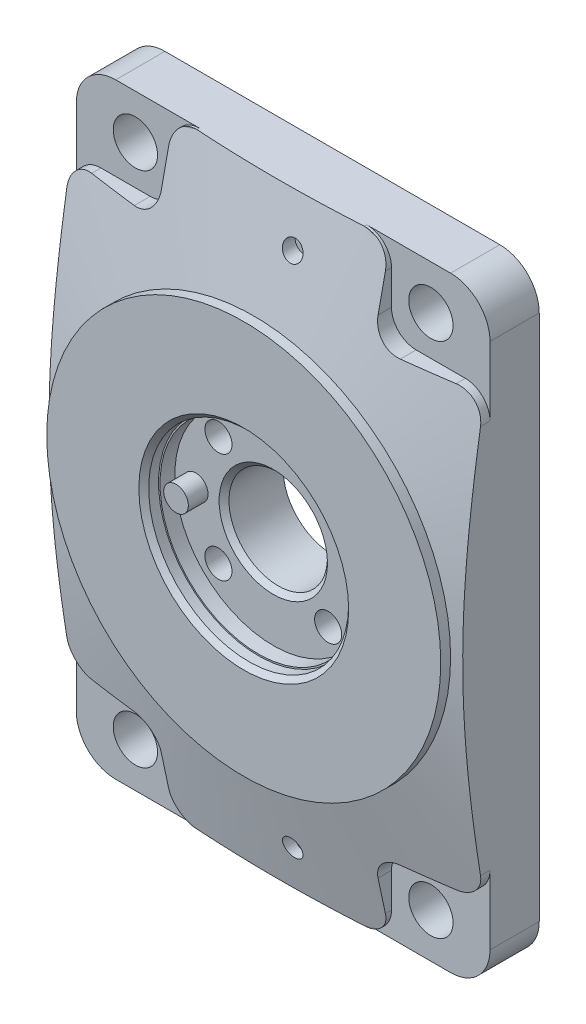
ISO-10303-21;
HEADER;
FILE_DESCRIPTION(('STEP AP214'),'2;1');
FILE_NAME('part.step','',(''),(''),'','','');
FILE_SCHEMA(('AUTOMOTIVE_DESIGN { 1 0 10303 214 1 1 1 1 }'));
ENDSEC;
DATA;
#1=APPLICATION_CONTEXT('core data for automotive mechanical design processes');
#2=APPLICATION_PROTOCOL_DEFINITION('international standard','automotive_design',2000,#1);
#3=PRODUCT_CONTEXT('',#1,'mechanical');
#4=PRODUCT('Part','Part','',(#3));
#5=PRODUCT_RELATED_PRODUCT_CATEGORY('part','',(#4));
#6=PRODUCT_DEFINITION_FORMATION('','',#4);
#7=PRODUCT_DEFINITION_CONTEXT('part definition',#1,'design');
#8=PRODUCT_DEFINITION('design','',#6,#7);
#9=PRODUCT_DEFINITION_SHAPE('','',#8);
#10=(LENGTH_UNIT() NAMED_UNIT(*) SI_UNIT(.MILLI.,.METRE.));
#11=(NAMED_UNIT(*) PLANE_ANGLE_UNIT() SI_UNIT($,.RADIAN.));
#12=(NAMED_UNIT(*) SI_UNIT($,.STERADIAN.) SOLID_ANGLE_UNIT());
#13=UNCERTAINTY_MEASURE_WITH_UNIT(LENGTH_MEASURE(1.E-05),#10,'distance_accuracy_value','');
#14=(GEOMETRIC_REPRESENTATION_CONTEXT(3) GLOBAL_UNCERTAINTY_ASSIGNED_CONTEXT((#13)) GLOBAL_UNIT_ASSIGNED_CONTEXT((#10,
#11,#12)) REPRESENTATION_CONTEXT('',''));
#15=CARTESIAN_POINT('',(0.,0.,0.));
#16=DIRECTION('',(0.,0.,1.));
#17=DIRECTION('',(1.,0.,0.));
#18=AXIS2_PLACEMENT_3D('',#15,#16,#17);
#19=CARTESIAN_POINT('',(-42.,61.5,18.));
#20=DIRECTION('',(0.,-1.,0.));
#21=DIRECTION('',(1.,0.,0.));
#22=AXIS2_PLACEMENT_3D('',#19,#20,#21);
#23=PLANE('',#22);
#24=DIRECTION('',(1.,0.,0.));
#25=VECTOR('',#24,1.);
#26=CARTESIAN_POINT('',(-2.09645840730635E-13,61.5,0.));
#27=LINE('',#26,#25);
#28=CARTESIAN_POINT('',(-34.,61.5,1.18710365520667E-13));
#29=VERTEX_POINT('',#28);
#30=CARTESIAN_POINT('',(34.,61.5,-1.18710365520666E-13));
#31=VERTEX_POINT('',#30);
#32=EDGE_CURVE('E10',#29,#31,#27,.T.);
#33=ORIENTED_EDGE('',*,*,#32,.F.);
#34=DIRECTION('',(0.,0.,-1.));
#35=VECTOR('',#34,1.);
#36=CARTESIAN_POINT('',(-34.,61.5,18.));
#37=LINE('',#36,#35);
#38=CARTESIAN_POINT('',(-34.,61.5,10.0000000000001));
#39=VERTEX_POINT('',#38);
#40=EDGE_CURVE('E982',#39,#29,#37,.T.);
#41=ORIENTED_EDGE('',*,*,#40,.F.);
#42=DIRECTION('',(1.,0.,0.));
#43=VECTOR('',#42,1.);
#44=CARTESIAN_POINT('',(-42.,61.5,10.0000000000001));
#45=LINE('',#44,#43);
#46=CARTESIAN_POINT('',(-17.,61.5,10.));
#47=VERTEX_POINT('',#46);
#48=EDGE_CURVE('E829',#47,#39,#45,.F.);
#49=ORIENTED_EDGE('',*,*,#48,.F.);
#50=DIRECTION('',(0.,0.,1.));
#51=VECTOR('',#50,1.);
#52=CARTESIAN_POINT('',(-17.,61.5,18.));
#53=LINE('',#52,#51);
#54=CARTESIAN_POINT('',(-17.,61.5,10.5038715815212));
#55=VERTEX_POINT('',#54);
#56=EDGE_CURVE('E273',#55,#47,#53,.F.);
#57=ORIENTED_EDGE('',*,*,#56,.F.);
#58=CARTESIAN_POINT('',(17.,61.5,10.503871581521));
#59=CARTESIAN_POINT('',(15.5844226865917,61.5000000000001,10.5909880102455));
#60=CARTESIAN_POINT('',(14.1682066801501,61.5000000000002,10.6679562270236));
#61=CARTESIAN_POINT('',(11.3347577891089,61.5000000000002,10.8007403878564));
#62=CARTESIAN_POINT('',(9.9175248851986,61.5000000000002,10.8565559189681));
#63=CARTESIAN_POINT('',(7.0837490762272,61.5000000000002,10.9461314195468));
#64=CARTESIAN_POINT('',(5.66720685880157,61.5000000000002,10.979912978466));
#65=CARTESIAN_POINT('',(2.83377642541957,61.5000000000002,11.0250141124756));
#66=CARTESIAN_POINT('',(1.41688821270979,61.5000000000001,11.0363338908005));
#67=CARTESIAN_POINT('',(-1.41688821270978,61.5000000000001,11.0363338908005));
#68=CARTESIAN_POINT('',(-2.83377642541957,61.5000000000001,11.0250141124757));
#69=CARTESIAN_POINT('',(-5.66720685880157,61.5000000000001,10.979912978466));
#70=CARTESIAN_POINT('',(-7.0837490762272,61.5000000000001,10.9461314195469));
#71=CARTESIAN_POINT('',(-9.9175248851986,61.5000000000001,10.8565559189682));
#72=CARTESIAN_POINT('',(-11.3347577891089,61.5000000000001,10.8007403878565));
#73=CARTESIAN_POINT('',(-14.1682066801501,61.5000000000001,10.6679562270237));
#74=CARTESIAN_POINT('',(-15.5844226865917,61.5000000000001,10.5909880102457));
#75=CARTESIAN_POINT('',(-17.,61.5,10.5038715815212));
#76=B_SPLINE_CURVE_WITH_KNOTS('',3,(#58,#59,#60,#61,#62,#63,#64,#65,#66,#67,#68,#69,#70,#71,#72,
#73,#74,#75),.UNSPECIFIED.,.F.,.F.,(4,2,2,2,2,2,2,2,4),(0.,4.2547508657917,8.50958478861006,
12.7602434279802,17.0108636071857,21.2614837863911,25.5121424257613,29.7669763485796,
34.0217272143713),.UNSPECIFIED.);
#77=CARTESIAN_POINT('',(17.,61.5,10.503871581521));
#78=VERTEX_POINT('',#77);
#79=EDGE_CURVE('E547',#78,#55,#76,.T.);
#80=ORIENTED_EDGE('',*,*,#79,.F.);
#81=DIRECTION('',(0.,0.,1.));
#82=VECTOR('',#81,1.);
#83=CARTESIAN_POINT('',(16.9999999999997,61.5,-26.2488094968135));
#84=LINE('',#83,#82);
#85=CARTESIAN_POINT('',(17.,61.5,10.));
#86=VERTEX_POINT('',#85);
#87=EDGE_CURVE('E866',#86,#78,#84,.T.);
#88=ORIENTED_EDGE('',*,*,#87,.F.);
#89=DIRECTION('',(1.,0.,0.));
#90=VECTOR('',#89,1.);
#91=CARTESIAN_POINT('',(-42.,61.5,10.0000000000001));
#92=LINE('',#91,#90);
#93=CARTESIAN_POINT('',(34.,61.5,9.99999999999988));
#94=VERTEX_POINT('',#93);
#95=EDGE_CURVE('E833',#94,#86,#92,.F.);
#96=ORIENTED_EDGE('',*,*,#95,.F.);
#97=DIRECTION('',(0.,0.,1.));
#98=VECTOR('',#97,1.);
#99=CARTESIAN_POINT('',(34.,61.5,18.));
#100=LINE('',#99,#98);
#101=EDGE_CURVE('E831',#31,#94,#100,.T.);
#102=ORIENTED_EDGE('',*,*,#101,.F.);
#103=EDGE_LOOP('',(#33,#41,#49,#57,#80,#88,#96,#102));
#104=FACE_BOUND('',#103,.T.);
#105=ADVANCED_FACE('F16',(#104),#23,.F.);
#106=CARTESIAN_POINT('',(-34.,53.5,18.));
#107=DIRECTION('',(0.,0.,-1.));
#108=DIRECTION('',(-1.,0.,0.));
#109=AXIS2_PLACEMENT_3D('',#106,#107,#108);
#110=CYLINDRICAL_SURFACE('',#109,8.);
#111=ORIENTED_EDGE('',*,*,#40,.T.);
#112=CARTESIAN_POINT('',(-34.,53.5,1.18710365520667E-13));
#113=DIRECTION('',(0.,0.,1.));
#114=DIRECTION('',(1.,0.,0.));
#115=AXIS2_PLACEMENT_3D('',#112,#113,#114);
#116=CIRCLE('',#115,8.);
#117=CARTESIAN_POINT('',(-42.,53.5,1.46642216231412E-13));
#118=VERTEX_POINT('',#117);
#119=EDGE_CURVE('E24',#29,#118,#116,.T.);
#120=ORIENTED_EDGE('',*,*,#119,.T.);
#121=DIRECTION('',(0.,0.,1.));
#122=VECTOR('',#121,1.);
#123=CARTESIAN_POINT('',(-42.,53.5,18.));
#124=LINE('',#123,#122);
#125=CARTESIAN_POINT('',(-42.,53.5,10.0000000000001));
#126=VERTEX_POINT('',#125);
#127=EDGE_CURVE('E828',#118,#126,#124,.T.);
#128=ORIENTED_EDGE('',*,*,#127,.T.);
#129=CARTESIAN_POINT('',(-34.,53.5,10.0000000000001));
#130=DIRECTION('',(0.,0.,-1.));
#131=DIRECTION('',(-1.,0.,0.));
#132=AXIS2_PLACEMENT_3D('',#129,#130,#131);
#133=CIRCLE('',#132,8.);
#134=EDGE_CURVE('E979',#126,#39,#133,.T.);
#135=ORIENTED_EDGE('',*,*,#134,.T.);
#136=EDGE_LOOP('',(#111,#120,#128,#135));
#137=FACE_BOUND('',#136,.T.);
#138=ADVANCED_FACE('F18',(#137),#110,.T.);
#139=CARTESIAN_POINT('',(-42.,-61.5,18.));
#140=DIRECTION('',(1.,0.,0.));
#141=DIRECTION('',(0.,1.,0.));
#142=AXIS2_PLACEMENT_3D('',#139,#140,#141);
#143=PLANE('',#142);
#144=DIRECTION('',(0.,1.,0.));
#145=VECTOR('',#144,1.);
#146=CARTESIAN_POINT('',(-42.,-1.51380973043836E-13,1.46642216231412E-13));
#147=LINE('',#146,#145);
#148=CARTESIAN_POINT('',(-42.,-53.5,1.46642216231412E-13));
#149=VERTEX_POINT('',#148);
#150=EDGE_CURVE('E1064',#149,#118,#147,.T.);
#151=ORIENTED_EDGE('',*,*,#150,.F.);
#152=DIRECTION('',(0.,0.,-1.));
#153=VECTOR('',#152,1.);
#154=CARTESIAN_POINT('',(-42.,-53.5,18.));
#155=LINE('',#154,#153);
#156=CARTESIAN_POINT('',(-42.,-53.5,10.0000000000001));
#157=VERTEX_POINT('',#156);
#158=EDGE_CURVE('E1007',#157,#149,#155,.T.);
#159=ORIENTED_EDGE('',*,*,#158,.F.);
#160=DIRECTION('',(0.,1.,0.));
#161=VECTOR('',#160,1.);
#162=CARTESIAN_POINT('',(-42.,-61.5,10.0000000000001));
#163=LINE('',#162,#161);
#164=CARTESIAN_POINT('',(-42.,-39.5,10.0000000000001));
#165=VERTEX_POINT('',#164);
#166=EDGE_CURVE('E1006',#165,#157,#163,.F.);
#167=ORIENTED_EDGE('',*,*,#166,.F.);
#168=DIRECTION('',(0.,0.,1.));
#169=VECTOR('',#168,1.);
#170=CARTESIAN_POINT('',(-42.,-39.5,18.));
#171=LINE('',#170,#169);
#172=CARTESIAN_POINT('',(-42.,-39.5,11.9237198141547));
#173=VERTEX_POINT('',#172);
#174=EDGE_CURVE('E1008',#173,#165,#171,.F.);
#175=ORIENTED_EDGE('',*,*,#174,.F.);
#176=CARTESIAN_POINT('',(-42.,39.5000000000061,11.9237198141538));
#177=CARTESIAN_POINT('',(-42.0000000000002,38.281223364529,12.1164583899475));
#178=CARTESIAN_POINT('',(-42.0000000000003,37.0617144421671,12.3046391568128));
#179=CARTESIAN_POINT('',(-42.0000000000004,34.6210682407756,12.6704218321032));
#180=CARTESIAN_POINT('',(-42.0000000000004,33.3999309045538,12.8480233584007));
#181=CARTESIAN_POINT('',(-42.0000000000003,30.955378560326,13.1912507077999));
#182=CARTESIAN_POINT('',(-42.0000000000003,29.7319627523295,13.3568708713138));
#183=CARTESIAN_POINT('',(-42.0000000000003,27.2833695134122,13.6743479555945));
#184=CARTESIAN_POINT('',(-42.0000000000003,26.0581920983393,13.8262049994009));
#185=CARTESIAN_POINT('',(-42.0000000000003,22.3785381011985,14.258557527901));
#186=CARTESIAN_POINT('',(-42.0000000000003,19.9211989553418,14.5156538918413));
#187=CARTESIAN_POINT('',(-42.0000000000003,16.2302249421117,14.8427599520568));
#188=CARTESIAN_POINT('',(-42.0000000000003,14.9991469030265,14.9420346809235));
#189=CARTESIAN_POINT('',(-42.0000000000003,12.5354364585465,15.1192036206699));
#190=CARTESIAN_POINT('',(-42.0000000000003,11.3028040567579,15.1970978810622));
#191=CARTESIAN_POINT('',(-42.0000000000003,8.8493604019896,15.329154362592));
#192=CARTESIAN_POINT('',(-42.0000000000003,7.62856227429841,15.3835592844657));
#193=CARTESIAN_POINT('',(-42.0000000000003,5.18613250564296,15.468597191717));
#194=CARTESIAN_POINT('',(-42.0000000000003,3.96450086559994,15.4992302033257));
#195=CARTESIAN_POINT('',(-42.0000000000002,1.52083581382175,15.5359923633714));
#196=CARTESIAN_POINT('',(-42.0000000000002,0.29880239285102,15.5421209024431));
#197=CARTESIAN_POINT('',(-42.0000000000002,-2.14513758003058,15.5297222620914));
#198=CARTESIAN_POINT('',(-42.0000000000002,-3.36704413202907,15.5111950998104));
#199=CARTESIAN_POINT('',(-42.0000000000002,-5.8094847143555,15.4499544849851));
#200=CARTESIAN_POINT('',(-42.0000000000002,-7.03001912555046,15.4072561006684));
#201=CARTESIAN_POINT('',(-42.0000000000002,-9.47005479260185,15.2986785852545));
#202=CARTESIAN_POINT('',(-42.0000000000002,-10.689556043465,15.2327993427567));
#203=CARTESIAN_POINT('',(-42.0000000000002,-13.1271535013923,15.0792903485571));
#204=CARTESIAN_POINT('',(-42.0000000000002,-14.3452497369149,14.9916610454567));
#205=CARTESIAN_POINT('',(-42.0000000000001,-16.7798351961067,14.7963710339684));
#206=CARTESIAN_POINT('',(-42.,-17.9963244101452,14.6887102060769));
#207=CARTESIAN_POINT('',(-42.,-20.0590174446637,14.4906206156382));
#208=CARTESIAN_POINT('',(-42.0000000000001,-20.9056745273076,14.4048624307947));
#209=CARTESIAN_POINT('',(-42.0000000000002,-22.5980787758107,14.2251739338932));
#210=CARTESIAN_POINT('',(-42.0000000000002,-23.4438259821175,14.1312440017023));
#211=CARTESIAN_POINT('',(-42.0000000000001,-25.9798064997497,13.8381444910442));
#212=CARTESIAN_POINT('',(-42.0000000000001,-27.6687429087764,13.6276686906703));
#213=CARTESIAN_POINT('',(-42.0000000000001,-30.2029833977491,13.2924829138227));
#214=CARTESIAN_POINT('',(-42.0000000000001,-31.0495657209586,13.177258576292));
#215=CARTESIAN_POINT('',(-42.0000000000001,-32.7419151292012,12.9409612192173));
#216=CARTESIAN_POINT('',(-42.0000000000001,-33.5876822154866,12.8198882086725));
#217=CARTESIAN_POINT('',(-42.0000000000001,-35.2783060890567,12.5724304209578));
#218=CARTESIAN_POINT('',(-42.0000000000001,-36.1231629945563,12.4460464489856));
#219=CARTESIAN_POINT('',(-42.0000000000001,-37.8121300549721,12.1884148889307));
#220=CARTESIAN_POINT('',(-42.0000000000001,-38.6562402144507,12.0571673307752));
#221=CARTESIAN_POINT('',(-42.,-39.5,11.9237198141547));
#222=B_SPLINE_CURVE_WITH_KNOTS('',3,(#176,#177,#178,#179,#180,#181,#182,#183,#184,#185,#186,
#187,#188,#189,#190,#191,#192,#193,#194,#195,#196,#197,#198,#199,#200,#201,#202,#203,#204,#205,
#206,#207,#208,#209,#210,#211,#212,#213,#214,#215,#216,#217,#218,#219,#220,#221),.UNSPECIFIED.,
.F.,.F.,(4,2,2,2,2,2,2,2,2,2,2,2,2,2,2,2,2,2,2,2,2,2,4),(0.,3.70177456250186,7.40368275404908,
11.1073283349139,14.8109408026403,22.221981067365,25.9270556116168,29.6321215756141,
33.297931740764,36.9637378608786,40.6296351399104,44.2955298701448,47.9591418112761,
51.6227713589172,55.2863253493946,58.9499011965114,61.5028292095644,64.0556386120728,
69.1613653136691,71.7245151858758,74.287661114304,76.8504198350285,79.4131627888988),.UNSPECIFIED.);
#223=CARTESIAN_POINT('',(-42.,39.5000000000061,11.9237198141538));
#224=VERTEX_POINT('',#223);
#225=EDGE_CURVE('E555',#224,#173,#222,.T.);
#226=ORIENTED_EDGE('',*,*,#225,.F.);
#227=DIRECTION('',(0.,0.,1.));
#228=VECTOR('',#227,1.);
#229=CARTESIAN_POINT('',(-42.,39.5,18.));
#230=LINE('',#229,#228);
#231=CARTESIAN_POINT('',(-42.,39.5,10.0000000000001));
#232=VERTEX_POINT('',#231);
#233=EDGE_CURVE('E827',#232,#224,#230,.T.);
#234=ORIENTED_EDGE('',*,*,#233,.F.);
#235=DIRECTION('',(0.,1.,0.));
#236=VECTOR('',#235,1.);
#237=CARTESIAN_POINT('',(-42.,-61.5,10.0000000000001));
#238=LINE('',#237,#236);
#239=EDGE_CURVE('E824',#126,#232,#238,.F.);
#240=ORIENTED_EDGE('',*,*,#239,.F.);
#241=ORIENTED_EDGE('',*,*,#127,.F.);
#242=EDGE_LOOP('',(#151,#159,#167,#175,#226,#234,#240,#241));
#243=FACE_BOUND('',#242,.T.);
#244=ADVANCED_FACE('F584',(#243),#143,.F.);
#245=CARTESIAN_POINT('',(-34.,-53.5,18.));
#246=DIRECTION('',(0.,0.,-1.));
#247=DIRECTION('',(-1.,0.,0.));
#248=AXIS2_PLACEMENT_3D('',#245,#246,#247);
#249=CYLINDRICAL_SURFACE('',#248,8.);
#250=ORIENTED_EDGE('',*,*,#158,.T.);
#251=CARTESIAN_POINT('',(-34.,-53.5,1.18710365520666E-13));
#252=DIRECTION('',(0.,0.,1.));
#253=DIRECTION('',(1.,0.,0.));
#254=AXIS2_PLACEMENT_3D('',#251,#252,#253);
#255=CIRCLE('',#254,8.);
#256=CARTESIAN_POINT('',(-34.,-61.5,1.18710365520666E-13));
#257=VERTEX_POINT('',#256);
#258=EDGE_CURVE('E1062',#149,#257,#255,.T.);
#259=ORIENTED_EDGE('',*,*,#258,.T.);
#260=DIRECTION('',(0.,0.,-1.));
#261=VECTOR('',#260,1.);
#262=CARTESIAN_POINT('',(-34.,-61.5,18.));
#263=LINE('',#262,#261);
#264=CARTESIAN_POINT('',(-34.,-61.5,10.0000000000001));
#265=VERTEX_POINT('',#264);
#266=EDGE_CURVE('E978',#257,#265,#263,.F.);
#267=ORIENTED_EDGE('',*,*,#266,.T.);
#268=CARTESIAN_POINT('',(-34.,-53.5,10.0000000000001));
#269=DIRECTION('',(0.,0.,-1.));
#270=DIRECTION('',(-1.,0.,0.));
#271=AXIS2_PLACEMENT_3D('',#268,#269,#270);
#272=CIRCLE('',#271,8.);
#273=EDGE_CURVE('E975',#265,#157,#272,.T.);
#274=ORIENTED_EDGE('',*,*,#273,.T.);
#275=EDGE_LOOP('',(#250,#259,#267,#274));
#276=FACE_BOUND('',#275,.T.);
#277=ADVANCED_FACE('F582',(#276),#249,.T.);
#278=CARTESIAN_POINT('',(-42.,-61.5,18.));
#279=DIRECTION('',(0.,1.,0.));
#280=DIRECTION('',(-1.,0.,0.));
#281=AXIS2_PLACEMENT_3D('',#278,#279,#280);
#282=PLANE('',#281);
#283=DIRECTION('',(-1.,0.,0.));
#284=VECTOR('',#283,1.);
#285=CARTESIAN_POINT('',(2.19806363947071E-13,-61.5,0.));
#286=LINE('',#285,#284);
#287=CARTESIAN_POINT('',(34.,-61.5,-1.18710365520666E-13));
#288=VERTEX_POINT('',#287);
#289=EDGE_CURVE('E1059',#288,#257,#286,.T.);
#290=ORIENTED_EDGE('',*,*,#289,.F.);
#291=DIRECTION('',(0.,0.,-1.));
#292=VECTOR('',#291,1.);
#293=CARTESIAN_POINT('',(34.,-61.5,18.));
#294=LINE('',#293,#292);
#295=CARTESIAN_POINT('',(34.,-61.5,9.99999999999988));
#296=VERTEX_POINT('',#295);
#297=EDGE_CURVE('E845',#296,#288,#294,.T.);
#298=ORIENTED_EDGE('',*,*,#297,.F.);
#299=DIRECTION('',(-1.,0.,0.));
#300=VECTOR('',#299,1.);
#301=CARTESIAN_POINT('',(-42.,-61.5,10.0000000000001));
#302=LINE('',#301,#300);
#303=CARTESIAN_POINT('',(17.0000000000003,-61.5,10.));
#304=VERTEX_POINT('',#303);
#305=EDGE_CURVE('E569',#304,#296,#302,.F.);
#306=ORIENTED_EDGE('',*,*,#305,.F.);
#307=DIRECTION('',(0.,0.,1.));
#308=VECTOR('',#307,1.);
#309=CARTESIAN_POINT('',(17.0000000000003,-61.5,18.));
#310=LINE('',#309,#308);
#311=CARTESIAN_POINT('',(17.0000000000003,-61.5,10.503871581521));
#312=VERTEX_POINT('',#311);
#313=EDGE_CURVE('E868',#312,#304,#310,.F.);
#314=ORIENTED_EDGE('',*,*,#313,.F.);
#315=CARTESIAN_POINT('',(-16.9999999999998,-61.5,10.5038715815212));
#316=CARTESIAN_POINT('',(-15.5844226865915,-61.4999999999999,10.5909880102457));
#317=CARTESIAN_POINT('',(-14.1682066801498,-61.4999999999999,10.6679562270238));
#318=CARTESIAN_POINT('',(-11.3347577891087,-61.4999999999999,10.8007403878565));
#319=CARTESIAN_POINT('',(-9.91752488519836,-61.4999999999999,10.8565559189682));
#320=CARTESIAN_POINT('',(-7.08374907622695,-61.4999999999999,10.946131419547));
#321=CARTESIAN_POINT('',(-5.66720685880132,-61.4999999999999,10.9799129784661));
#322=CARTESIAN_POINT('',(-2.83377642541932,-61.4999999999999,11.0250141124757));
#323=CARTESIAN_POINT('',(-1.41688821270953,-61.4999999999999,11.0363338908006));
#324=CARTESIAN_POINT('',(1.41688821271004,-61.4999999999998,11.0363338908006));
#325=CARTESIAN_POINT('',(2.83377642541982,-61.4999999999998,11.0250141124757));
#326=CARTESIAN_POINT('',(5.66720685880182,-61.4999999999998,10.979912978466));
#327=CARTESIAN_POINT('',(7.08374907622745,-61.4999999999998,10.9461314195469));
#328=CARTESIAN_POINT('',(9.91752488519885,-61.4999999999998,10.8565559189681));
#329=CARTESIAN_POINT('',(11.3347577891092,-61.4999999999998,10.8007403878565));
#330=CARTESIAN_POINT('',(14.1682066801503,-61.4999999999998,10.6679562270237));
#331=CARTESIAN_POINT('',(15.584422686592,-61.4999999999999,10.5909880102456));
#332=CARTESIAN_POINT('',(17.0000000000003,-61.5,10.503871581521));
#333=B_SPLINE_CURVE_WITH_KNOTS('',3,(#315,#316,#317,#318,#319,#320,#321,#322,#323,#324,#325,
#326,#327,#328,#329,#330,#331,#332),.UNSPECIFIED.,.F.,.F.,(4,2,2,2,2,2,2,2,4),(0.,
4.25475086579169,8.50958478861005,12.7602434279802,17.0108636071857,21.2614837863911,
25.5121424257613,29.7669763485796,34.0217272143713),.UNSPECIFIED.);
#334=CARTESIAN_POINT('',(-16.9999999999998,-61.5,10.5038715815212));
#335=VERTEX_POINT('',#334);
#336=EDGE_CURVE('E562',#335,#312,#333,.T.);
#337=ORIENTED_EDGE('',*,*,#336,.F.);
#338=DIRECTION('',(0.,0.,1.));
#339=VECTOR('',#338,1.);
#340=CARTESIAN_POINT('',(-17.,-61.5,-26.2488094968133));
#341=LINE('',#340,#339);
#342=CARTESIAN_POINT('',(-16.9999999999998,-61.5,10.));
#343=VERTEX_POINT('',#342);
#344=EDGE_CURVE('E889',#343,#335,#341,.T.);
#345=ORIENTED_EDGE('',*,*,#344,.F.);
#346=DIRECTION('',(-1.,0.,0.));
#347=VECTOR('',#346,1.);
#348=CARTESIAN_POINT('',(-42.,-61.5,10.0000000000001));
#349=LINE('',#348,#347);
#350=EDGE_CURVE('E570',#265,#343,#349,.F.);
#351=ORIENTED_EDGE('',*,*,#350,.F.);
#352=ORIENTED_EDGE('',*,*,#266,.F.);
#353=EDGE_LOOP('',(#290,#298,#306,#314,#337,#345,#351,#352));
#354=FACE_BOUND('',#353,.T.);
#355=ADVANCED_FACE('F578',(#354),#282,.F.);
#356=CARTESIAN_POINT('',(34.,-53.5,18.));
#357=DIRECTION('',(0.,0.,-1.));
#358=DIRECTION('',(-1.,0.,0.));
#359=AXIS2_PLACEMENT_3D('',#356,#357,#358);
#360=CYLINDRICAL_SURFACE('',#359,8.);
#361=ORIENTED_EDGE('',*,*,#297,.T.);
#362=CARTESIAN_POINT('',(34.,-53.5,-1.18710365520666E-13));
#363=DIRECTION('',(0.,0.,1.));
#364=DIRECTION('',(1.,0.,0.));
#365=AXIS2_PLACEMENT_3D('',#362,#363,#364);
#366=CIRCLE('',#365,8.);
#367=CARTESIAN_POINT('',(42.,-53.5,-1.46642216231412E-13));
#368=VERTEX_POINT('',#367);
#369=EDGE_CURVE('E1055',#288,#368,#366,.T.);
#370=ORIENTED_EDGE('',*,*,#369,.T.);
#371=DIRECTION('',(0.,0.,1.));
#372=VECTOR('',#371,1.);
#373=CARTESIAN_POINT('',(42.,-53.5,18.));
#374=LINE('',#373,#372);
#375=CARTESIAN_POINT('',(42.,-53.5,9.99999999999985));
#376=VERTEX_POINT('',#375);
#377=EDGE_CURVE('E837',#368,#376,#374,.T.);
#378=ORIENTED_EDGE('',*,*,#377,.T.);
#379=CARTESIAN_POINT('',(34.,-53.5,9.99999999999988));
#380=DIRECTION('',(0.,0.,-1.));
#381=DIRECTION('',(-1.,0.,0.));
#382=AXIS2_PLACEMENT_3D('',#379,#380,#381);
#383=CIRCLE('',#382,8.);
#384=EDGE_CURVE('E281',#376,#296,#383,.T.);
#385=ORIENTED_EDGE('',*,*,#384,.T.);
#386=EDGE_LOOP('',(#361,#370,#378,#385));
#387=FACE_BOUND('',#386,.T.);
#388=ADVANCED_FACE('F581',(#387),#360,.T.);
#389=CARTESIAN_POINT('',(42.,1.46642216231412E-13,18.));
#390=DIRECTION('',(-1.,0.,0.));
#391=DIRECTION('',(0.,-1.,0.));
#392=AXIS2_PLACEMENT_3D('',#389,#390,#391);
#393=PLANE('',#392);
#394=DIRECTION('',(0.,-1.,0.));
#395=VECTOR('',#394,1.);
#396=CARTESIAN_POINT('',(42.,1.41903459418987E-13,-1.46642216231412E-13));
#397=LINE('',#396,#395);
#398=CARTESIAN_POINT('',(42.,53.5,-1.46642216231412E-13));
#399=VERTEX_POINT('',#398);
#400=EDGE_CURVE('E1052',#399,#368,#397,.T.);
#401=ORIENTED_EDGE('',*,*,#400,.F.);
#402=DIRECTION('',(0.,0.,-1.));
#403=VECTOR('',#402,1.);
#404=CARTESIAN_POINT('',(42.,53.5,18.));
#405=LINE('',#404,#403);
#406=CARTESIAN_POINT('',(42.,53.5,9.99999999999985));
#407=VERTEX_POINT('',#406);
#408=EDGE_CURVE('E985',#407,#399,#405,.T.);
#409=ORIENTED_EDGE('',*,*,#408,.F.);
#410=DIRECTION('',(0.,-1.,0.));
#411=VECTOR('',#410,1.);
#412=CARTESIAN_POINT('',(42.,1.46642216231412E-13,9.99999999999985));
#413=LINE('',#412,#411);
#414=CARTESIAN_POINT('',(42.,39.5000000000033,9.99999999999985));
#415=VERTEX_POINT('',#414);
#416=EDGE_CURVE('E836',#415,#407,#413,.F.);
#417=ORIENTED_EDGE('',*,*,#416,.F.);
#418=DIRECTION('',(0.,0.,1.));
#419=VECTOR('',#418,1.);
#420=CARTESIAN_POINT('',(42.,39.5000000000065,18.));
#421=LINE('',#420,#419);
#422=CARTESIAN_POINT('',(42.,39.4999999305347,11.9237198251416));
#423=VERTEX_POINT('',#422);
#424=EDGE_CURVE('E838',#423,#415,#421,.F.);
#425=ORIENTED_EDGE('',*,*,#424,.F.);
#426=CARTESIAN_POINT('',(42.,-39.5,11.9237198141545));
#427=CARTESIAN_POINT('',(42.0000000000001,-38.2812233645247,12.1164583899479));
#428=CARTESIAN_POINT('',(42.0000000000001,-37.0617144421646,12.3046391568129));
#429=CARTESIAN_POINT('',(42.0000000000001,-34.6210682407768,12.6704218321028));
#430=CARTESIAN_POINT('',(42.0000000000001,-33.3999309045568,12.8480233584));
#431=CARTESIAN_POINT('',(42.0000000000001,-30.9553785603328,13.1912507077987));
#432=CARTESIAN_POINT('',(42.0000000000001,-29.7319627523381,13.3568708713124));
#433=CARTESIAN_POINT('',(42.0000000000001,-27.2833695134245,13.6743479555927));
#434=CARTESIAN_POINT('',(42.0000000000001,-26.0581920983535,13.826204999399));
#435=CARTESIAN_POINT('',(42.0000000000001,-22.3785381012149,14.258557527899));
#436=CARTESIAN_POINT('',(42.0000000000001,-19.9211989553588,14.5156538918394));
#437=CARTESIAN_POINT('',(42.,-16.2302249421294,14.8427599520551));
#438=CARTESIAN_POINT('',(42.,-14.9991469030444,14.9420346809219));
#439=CARTESIAN_POINT('',(42.,-12.5354364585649,15.1192036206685));
#440=CARTESIAN_POINT('',(42.,-11.3028040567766,15.1970978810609));
#441=CARTESIAN_POINT('',(42.,-8.84936040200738,15.3291543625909));
#442=CARTESIAN_POINT('',(42.,-7.62856227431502,15.3835592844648));
#443=CARTESIAN_POINT('',(42.,-5.18613250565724,15.4685971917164));
#444=CARTESIAN_POINT('',(42.,-3.96450086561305,15.4992302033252));
#445=CARTESIAN_POINT('',(42.,-1.52083581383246,15.5359923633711));
#446=CARTESIAN_POINT('',(42.,-0.298802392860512,15.5421209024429));
#447=CARTESIAN_POINT('',(42.,2.14513758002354,15.5297222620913));
#448=CARTESIAN_POINT('',(42.,3.36704413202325,15.5111950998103));
#449=CARTESIAN_POINT('',(42.,5.80948471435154,15.449954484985));
#450=CARTESIAN_POINT('',(42.,7.03001912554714,15.4072561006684));
#451=CARTESIAN_POINT('',(42.,9.47005479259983,15.2986785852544));
#452=CARTESIAN_POINT('',(42.,10.6895560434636,15.2327993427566));
#453=CARTESIAN_POINT('',(41.9999999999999,13.1271535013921,15.0792903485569));
#454=CARTESIAN_POINT('',(41.9999999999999,14.3452497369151,14.9916610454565));
#455=CARTESIAN_POINT('',(42.,16.7798351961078,14.7963710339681));
#456=CARTESIAN_POINT('',(42.,17.9963244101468,14.6887102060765));
#457=CARTESIAN_POINT('',(42.,20.0590174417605,14.4906206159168));
#458=CARTESIAN_POINT('',(41.9999999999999,20.9056745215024,14.4048624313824));
#459=CARTESIAN_POINT('',(41.9999999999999,22.5980787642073,14.2251739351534));
#460=CARTESIAN_POINT('',(41.9999999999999,23.4438259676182,14.1312440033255));
#461=CARTESIAN_POINT('',(41.9999999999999,25.9798064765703,13.8381444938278));
#462=CARTESIAN_POINT('',(41.9999999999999,27.6687428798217,13.6276686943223));
#463=CARTESIAN_POINT('',(41.9999999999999,30.2029833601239,13.2924829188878));
#464=CARTESIAN_POINT('',(41.9999999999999,31.0495656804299,13.1772585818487));
#465=CARTESIAN_POINT('',(41.9999999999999,32.7419150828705,12.9409612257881));
#466=CARTESIAN_POINT('',(41.9999999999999,33.5876821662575,12.8198882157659));
#467=CARTESIAN_POINT('',(41.9999999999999,35.2783060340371,12.5724304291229));
#468=CARTESIAN_POINT('',(41.9999999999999,36.1231629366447,12.4460464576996));
#469=CARTESIAN_POINT('',(41.9999999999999,37.8121299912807,12.1884148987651));
#470=CARTESIAN_POINT('',(41.9999999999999,38.6562401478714,12.0571673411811));
#471=CARTESIAN_POINT('',(42.,39.4999999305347,11.9237198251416));
#472=B_SPLINE_CURVE_WITH_KNOTS('',3,(#426,#427,#428,#429,#430,#431,#432,#433,#434,#435,#436,
#437,#438,#439,#440,#441,#442,#443,#444,#445,#446,#447,#448,#449,#450,#451,#452,#453,#454,#455,
#456,#457,#458,#459,#460,#461,#462,#463,#464,#465,#466,#467,#468,#469,#470,#471),.UNSPECIFIED.,
.F.,.F.,(4,2,2,2,2,2,2,2,2,2,2,2,2,2,2,2,2,2,2,2,2,2,4),(0.,3.70177456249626,7.40368275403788,
11.1073283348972,14.810940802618,22.2219810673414,25.9270556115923,29.6321215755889,
33.2979317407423,36.9637378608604,40.6296351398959,44.295529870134,47.9591418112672,
51.6227713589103,55.2863253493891,58.9499011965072,61.502829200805,64.0556385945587,
69.1613652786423,71.7245151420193,74.2876610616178,76.8504197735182,79.4131627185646),.UNSPECIFIED.);
#473=CARTESIAN_POINT('',(42.,-39.5,11.9237198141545));
#474=VERTEX_POINT('',#473);
#475=EDGE_CURVE('E571',#474,#423,#472,.T.);
#476=ORIENTED_EDGE('',*,*,#475,.F.);
#477=DIRECTION('',(0.,0.,1.));
#478=VECTOR('',#477,1.);
#479=CARTESIAN_POINT('',(42.,-39.5,18.));
#480=LINE('',#479,#478);
#481=CARTESIAN_POINT('',(42.,-39.5,9.99999999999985));
#482=VERTEX_POINT('',#481);
#483=EDGE_CURVE('E754',#482,#474,#480,.T.);
#484=ORIENTED_EDGE('',*,*,#483,.F.);
#485=DIRECTION('',(0.,-1.,0.));
#486=VECTOR('',#485,1.);
#487=CARTESIAN_POINT('',(42.,1.46642216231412E-13,9.99999999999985));
#488=LINE('',#487,#486);
#489=EDGE_CURVE('E840',#376,#482,#488,.F.);
#490=ORIENTED_EDGE('',*,*,#489,.F.);
#491=ORIENTED_EDGE('',*,*,#377,.F.);
#492=EDGE_LOOP('',(#401,#409,#417,#425,#476,#484,#490,#491));
#493=FACE_BOUND('',#492,.T.);
#494=ADVANCED_FACE('F586',(#493),#393,.F.);
#495=CARTESIAN_POINT('',(34.,53.5,18.));
#496=DIRECTION('',(0.,0.,-1.));
#497=DIRECTION('',(-1.,0.,0.));
#498=AXIS2_PLACEMENT_3D('',#495,#496,#497);
#499=CYLINDRICAL_SURFACE('',#498,8.);
#500=ORIENTED_EDGE('',*,*,#408,.T.);
#501=CARTESIAN_POINT('',(34.,53.5,-1.18710365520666E-13));
#502=DIRECTION('',(0.,0.,1.));
#503=DIRECTION('',(1.,0.,0.));
#504=AXIS2_PLACEMENT_3D('',#501,#502,#503);
#505=CIRCLE('',#504,8.);
#506=EDGE_CURVE('E1049',#399,#31,#505,.T.);
#507=ORIENTED_EDGE('',*,*,#506,.T.);
#508=ORIENTED_EDGE('',*,*,#101,.T.);
#509=CARTESIAN_POINT('',(34.,53.5,9.99999999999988));
#510=DIRECTION('',(0.,0.,-1.));
#511=DIRECTION('',(-1.,0.,0.));
#512=AXIS2_PLACEMENT_3D('',#509,#510,#511);
#513=CIRCLE('',#512,8.);
#514=EDGE_CURVE('E832',#94,#407,#513,.T.);
#515=ORIENTED_EDGE('',*,*,#514,.T.);
#516=EDGE_LOOP('',(#500,#507,#508,#515));
#517=FACE_BOUND('',#516,.T.);
#518=ADVANCED_FACE('F590',(#517),#499,.T.);
#519=CARTESIAN_POINT('',(0.,0.,12.));
#520=DIRECTION('',(0.,0.,1.));
#521=DIRECTION('',(1.,0.,0.));
#522=AXIS2_PLACEMENT_3D('',#519,#520,#521);
#523=CYLINDRICAL_SURFACE('',#522,20.);
#524=CARTESIAN_POINT('',(0.,0.,15.));
#525=DIRECTION('',(0.,0.,1.));
#526=DIRECTION('',(1.,0.,0.));
#527=AXIS2_PLACEMENT_3D('',#524,#525,#526);
#528=CIRCLE('',#527,20.);
#529=CARTESIAN_POINT('',(20.0000000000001,0.,14.9999999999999));
#530=VERTEX_POINT('',#529);
#531=EDGE_CURVE('E891',#530,#530,#528,.F.);
#532=ORIENTED_EDGE('',*,*,#531,.F.);
#533=EDGE_LOOP('',(#532));
#534=FACE_BOUND('',#533,.T.);
#535=CARTESIAN_POINT('',(0.,0.,12.));
#536=DIRECTION('',(0.,0.,1.));
#537=DIRECTION('',(1.,0.,0.));
#538=AXIS2_PLACEMENT_3D('',#535,#536,#537);
#539=CIRCLE('',#538,20.);
#540=CARTESIAN_POINT('',(20.,0.,11.9999999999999));
#541=VERTEX_POINT('',#540);
#542=EDGE_CURVE('E900',#541,#541,#539,.F.);
#543=ORIENTED_EDGE('',*,*,#542,.T.);
#544=EDGE_LOOP('',(#543));
#545=FACE_BOUND('',#544,.T.);
#546=ADVANCED_FACE('F594',(#534,#545),#523,.F.);
#547=CARTESIAN_POINT('',(0.,0.,18.));
#548=DIRECTION('',(0.,0.,1.));
#549=DIRECTION('',(1.,0.,0.));
#550=AXIS2_PLACEMENT_3D('',#547,#548,#549);
#551=CONICAL_SURFACE('',#550,21.3,0.785398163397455);
#552=CARTESIAN_POINT('',(0.,0.,17.));
#553=DIRECTION('',(0.,0.,1.));
#554=DIRECTION('',(1.,0.,0.));
#555=AXIS2_PLACEMENT_3D('',#552,#553,#554);
#556=CIRCLE('',#555,20.3);
#557=CARTESIAN_POINT('',(20.3000000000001,0.,16.9999999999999));
#558=VERTEX_POINT('',#557);
#559=EDGE_CURVE('E892',#558,#558,#556,.F.);
#560=ORIENTED_EDGE('',*,*,#559,.T.);
#561=EDGE_LOOP('',(#560));
#562=FACE_BOUND('',#561,.T.);
#563=CARTESIAN_POINT('',(0.,0.,18.));
#564=DIRECTION('',(0.,0.,1.));
#565=DIRECTION('',(1.,0.,0.));
#566=AXIS2_PLACEMENT_3D('',#563,#564,#565);
#567=CIRCLE('',#566,21.3);
#568=CARTESIAN_POINT('',(21.3000000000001,0.,17.9999999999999));
#569=VERTEX_POINT('',#568);
#570=EDGE_CURVE('E895',#569,#569,#567,.F.);
#571=ORIENTED_EDGE('',*,*,#570,.F.);
#572=EDGE_LOOP('',(#571));
#573=FACE_BOUND('',#572,.T.);
#574=ADVANCED_FACE('F628',(#562,#573),#551,.F.);
#575=CARTESIAN_POINT('',(0.,0.,18.));
#576=DIRECTION('',(0.,0.,1.));
#577=DIRECTION('',(1.,0.,0.));
#578=AXIS2_PLACEMENT_3D('',#575,#576,#577);
#579=PLANE('',#578);
#580=ORIENTED_EDGE('',*,*,#570,.T.);
#581=EDGE_LOOP('',(#580));
#582=FACE_BOUND('',#581,.T.);
#583=CARTESIAN_POINT('',(0.,0.,18.));
#584=DIRECTION('',(0.,0.,-1.));
#585=DIRECTION('',(-1.,0.,0.));
#586=AXIS2_PLACEMENT_3D('',#583,#584,#585);
#587=CIRCLE('',#586,40.);
#588=CARTESIAN_POINT('',(-39.9999999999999,-1.39659253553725E-13,18.0000000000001));
#589=VERTEX_POINT('',#588);
#590=EDGE_CURVE('E1038',#589,#589,#587,.T.);
#591=ORIENTED_EDGE('',*,*,#590,.F.);
#592=EDGE_LOOP('',(#591));
#593=FACE_BOUND('',#592,.T.);
#594=ADVANCED_FACE('F634',(#582,#593),#579,.T.);
#595=CARTESIAN_POINT('',(0.,0.,0.));
#596=DIRECTION('',(0.,0.,-1.));
#597=DIRECTION('',(-1.,0.,0.));
#598=AXIS2_PLACEMENT_3D('',#595,#596,#597);
#599=CYLINDRICAL_SURFACE('',#598,40.);
#600=ORIENTED_EDGE('',*,*,#590,.T.);
#601=EDGE_LOOP('',(#600));
#602=FACE_BOUND('',#601,.T.);
#603=CARTESIAN_POINT('',(0.,0.,16.));
#604=DIRECTION('',(0.,0.,-1.));
#605=DIRECTION('',(-1.,0.,0.));
#606=AXIS2_PLACEMENT_3D('',#603,#604,#605);
#607=CIRCLE('',#606,40.);
#608=CARTESIAN_POINT('',(-39.9999999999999,-1.39659253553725E-13,16.0000000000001));
#609=VERTEX_POINT('',#608);
#610=EDGE_CURVE('E1047',#609,#609,#607,.F.);
#611=ORIENTED_EDGE('',*,*,#610,.T.);
#612=EDGE_LOOP('',(#611));
#613=FACE_BOUND('',#612,.T.);
#614=ADVANCED_FACE('F630',(#602,#613),#599,.T.);
#615=CARTESIAN_POINT('',(0.,0.,15.));
#616=DIRECTION('',(0.,0.,1.));
#617=DIRECTION('',(1.,0.,0.));
#618=AXIS2_PLACEMENT_3D('',#615,#616,#617);
#619=CYLINDRICAL_SURFACE('',#618,20.3);
#620=ORIENTED_EDGE('',*,*,#559,.F.);
#621=EDGE_LOOP('',(#620));
#622=FACE_BOUND('',#621,.T.);
#623=CARTESIAN_POINT('',(0.,0.,15.));
#624=DIRECTION('',(0.,0.,1.));
#625=DIRECTION('',(1.,0.,0.));
#626=AXIS2_PLACEMENT_3D('',#623,#624,#625);
#627=CIRCLE('',#626,20.3);
#628=CARTESIAN_POINT('',(20.3000000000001,0.,14.9999999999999));
#629=VERTEX_POINT('',#628);
#630=EDGE_CURVE('E1041',#629,#629,#627,.T.);
#631=ORIENTED_EDGE('',*,*,#630,.F.);
#632=EDGE_LOOP('',(#631));
#633=FACE_BOUND('',#632,.T.);
#634=ADVANCED_FACE('F633',(#622,#633),#619,.F.);
#635=CARTESIAN_POINT('',(0.,0.,15.));
#636=DIRECTION('',(0.,0.,1.));
#637=DIRECTION('',(1.,0.,0.));
#638=AXIS2_PLACEMENT_3D('',#635,#636,#637);
#639=PLANE('',#638);
#640=ORIENTED_EDGE('',*,*,#531,.T.);
#641=EDGE_LOOP('',(#640));
#642=FACE_BOUND('',#641,.T.);
#643=ORIENTED_EDGE('',*,*,#630,.T.);
#644=EDGE_LOOP('',(#643));
#645=FACE_BOUND('',#644,.T.);
#646=ADVANCED_FACE('F620',(#642,#645),#639,.T.);
#647=CARTESIAN_POINT('',(-1.86176669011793E-13,63.8231173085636,10.5));
#648=DIRECTION('',(0.,0.,-1.));
#649=DIRECTION('',(-1.,0.,0.));
#650=AXIS2_PLACEMENT_3D('',#647,#648,#649);
#651=PLANE('',#650);
#652=CARTESIAN_POINT('',(17.,56.5,10.5));
#653=DIRECTION('',(0.,0.,1.));
#654=DIRECTION('',(1.,0.,0.));
#655=AXIS2_PLACEMENT_3D('',#652,#653,#654);
#656=CIRCLE('',#655,5.);
#657=CARTESIAN_POINT('',(17.0643253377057,61.4995862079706,10.5));
#658=VERTEX_POINT('',#657);
#659=CARTESIAN_POINT('',(19.7051928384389,60.7049889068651,10.5));
#660=VERTEX_POINT('',#659);
#661=EDGE_CURVE('E865',#658,#660,#656,.F.);
#662=ORIENTED_EDGE('',*,*,#661,.F.);
#663=CARTESIAN_POINT('',(0.,0.,10.5));
#664=DIRECTION('',(0.,0.,-1.));
#665=DIRECTION('',(-1.,0.,0.));
#666=AXIS2_PLACEMENT_3D('',#663,#664,#665);
#667=CIRCLE('',#666,63.8231173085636);
#668=EDGE_CURVE('E799',#660,#658,#667,.F.);
#669=ORIENTED_EDGE('',*,*,#668,.F.);
#670=EDGE_LOOP('',(#662,#669));
#671=FACE_BOUND('',#670,.T.);
#672=ADVANCED_FACE('F647',(#671),#651,.F.);
#673=CARTESIAN_POINT('',(-1.86176669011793E-13,63.8231173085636,10.5));
#674=DIRECTION('',(0.,0.,-1.));
#675=DIRECTION('',(-1.,0.,0.));
#676=AXIS2_PLACEMENT_3D('',#673,#674,#675);
#677=PLANE('',#676);
#678=CARTESIAN_POINT('',(-17.,56.5,10.5));
#679=DIRECTION('',(0.,0.,1.));
#680=DIRECTION('',(1.,0.,0.));
#681=AXIS2_PLACEMENT_3D('',#678,#679,#680);
#682=CIRCLE('',#681,5.);
#683=CARTESIAN_POINT('',(-19.7051928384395,60.7049889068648,10.5));
#684=VERTEX_POINT('',#683);
#685=CARTESIAN_POINT('',(-17.0643253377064,61.4995862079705,10.5));
#686=VERTEX_POINT('',#685);
#687=EDGE_CURVE('E268',#684,#686,#682,.F.);
#688=ORIENTED_EDGE('',*,*,#687,.F.);
#689=CARTESIAN_POINT('',(0.,0.,10.5));
#690=DIRECTION('',(0.,0.,-1.));
#691=DIRECTION('',(-1.,0.,0.));
#692=AXIS2_PLACEMENT_3D('',#689,#690,#691);
#693=CIRCLE('',#692,63.8231173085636);
#694=EDGE_CURVE('E793',#686,#684,#693,.F.);
#695=ORIENTED_EDGE('',*,*,#694,.F.);
#696=EDGE_LOOP('',(#688,#695));
#697=FACE_BOUND('',#696,.T.);
#698=ADVANCED_FACE('F651',(#697),#677,.F.);
#699=CARTESIAN_POINT('',(-1.86176669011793E-13,63.8231173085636,10.5));
#700=DIRECTION('',(0.,0.,-1.));
#701=DIRECTION('',(-1.,0.,0.));
#702=AXIS2_PLACEMENT_3D('',#699,#700,#701);
#703=PLANE('',#702);
#704=CARTESIAN_POINT('',(-16.9999999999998,-56.5,10.5));
#705=DIRECTION('',(0.,0.,1.));
#706=DIRECTION('',(1.,0.,0.));
#707=AXIS2_PLACEMENT_3D('',#704,#705,#706);
#708=CIRCLE('',#707,5.);
#709=CARTESIAN_POINT('',(-17.0643253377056,-61.4995862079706,10.5));
#710=VERTEX_POINT('',#709);
#711=CARTESIAN_POINT('',(-19.7051928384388,-60.7049889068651,10.5));
#712=VERTEX_POINT('',#711);
#713=EDGE_CURVE('E888',#710,#712,#708,.F.);
#714=ORIENTED_EDGE('',*,*,#713,.F.);
#715=CARTESIAN_POINT('',(0.,0.,10.5));
#716=DIRECTION('',(0.,0.,-1.));
#717=DIRECTION('',(-1.,0.,0.));
#718=AXIS2_PLACEMENT_3D('',#715,#716,#717);
#719=CIRCLE('',#718,63.8231173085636);
#720=EDGE_CURVE('E771',#712,#710,#719,.F.);
#721=ORIENTED_EDGE('',*,*,#720,.F.);
#722=EDGE_LOOP('',(#714,#721));
#723=FACE_BOUND('',#722,.T.);
#724=ADVANCED_FACE('F655',(#723),#703,.F.);
#725=CARTESIAN_POINT('',(-1.86176669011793E-13,63.8231173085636,10.5));
#726=DIRECTION('',(0.,0.,-1.));
#727=DIRECTION('',(-1.,0.,0.));
#728=AXIS2_PLACEMENT_3D('',#725,#726,#727);
#729=PLANE('',#728);
#730=CARTESIAN_POINT('',(17.0000000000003,-56.5,10.5));
#731=DIRECTION('',(0.,0.,1.));
#732=DIRECTION('',(1.,0.,0.));
#733=AXIS2_PLACEMENT_3D('',#730,#731,#732);
#734=CIRCLE('',#733,5.);
#735=CARTESIAN_POINT('',(19.7051928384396,-60.7049889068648,10.5));
#736=VERTEX_POINT('',#735);
#737=CARTESIAN_POINT('',(17.0643253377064,-61.4995862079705,10.5));
#738=VERTEX_POINT('',#737);
#739=EDGE_CURVE('E871',#736,#738,#734,.F.);
#740=ORIENTED_EDGE('',*,*,#739,.F.);
#741=CARTESIAN_POINT('',(0.,0.,10.5));
#742=DIRECTION('',(0.,0.,-1.));
#743=DIRECTION('',(-1.,0.,0.));
#744=AXIS2_PLACEMENT_3D('',#741,#742,#743);
#745=CIRCLE('',#744,63.8231173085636);
#746=EDGE_CURVE('E764',#738,#736,#745,.F.);
#747=ORIENTED_EDGE('',*,*,#746,.F.);
#748=EDGE_LOOP('',(#740,#747));
#749=FACE_BOUND('',#748,.T.);
#750=ADVANCED_FACE('F659',(#749),#729,.F.);
#751=CARTESIAN_POINT('',(-17.,-56.5,-26.2488094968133));
#752=DIRECTION('',(0.,0.,1.));
#753=DIRECTION('',(1.,0.,0.));
#754=AXIS2_PLACEMENT_3D('',#751,#752,#753);
#755=CYLINDRICAL_SURFACE('',#754,5.);
#756=CARTESIAN_POINT('',(-21.9999999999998,-56.4999993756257,11.236707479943));
#757=CARTESIAN_POINT('',(-22.0000138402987,-56.6411389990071,11.2063418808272));
#758=CARTESIAN_POINT('',(-21.9940243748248,-56.7823822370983,11.1764427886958));
#759=CARTESIAN_POINT('',(-21.9700851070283,-57.0640941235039,11.1177624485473));
#760=CARTESIAN_POINT('',(-21.9521345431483,-57.2045627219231,11.0889812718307));
#761=CARTESIAN_POINT('',(-21.9043237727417,-57.4836995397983,11.0327306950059));
#762=CARTESIAN_POINT('',(-21.8744657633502,-57.6223680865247,11.0052610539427));
#763=CARTESIAN_POINT('',(-21.8029899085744,-57.896927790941,10.9518063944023));
#764=CARTESIAN_POINT('',(-21.7613725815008,-58.0328190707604,10.9258213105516));
#765=CARTESIAN_POINT('',(-21.6665373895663,-58.3010245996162,10.8754685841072));
#766=CARTESIAN_POINT('',(-21.6133032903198,-58.4333335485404,10.8511032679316));
#767=CARTESIAN_POINT('',(-21.4955858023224,-58.693183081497,10.8041914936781));
#768=CARTESIAN_POINT('',(-21.4311026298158,-58.8207237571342,10.7816450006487));
#769=CARTESIAN_POINT('',(-21.2913296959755,-59.0699995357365,10.7385327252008));
#770=CARTESIAN_POINT('',(-21.2160457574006,-59.1917377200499,10.7179658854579));
#771=CARTESIAN_POINT('',(-21.0551782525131,-59.428480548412,10.6789477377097));
#772=CARTESIAN_POINT('',(-20.9695999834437,-59.5434886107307,10.6604953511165));
#773=CARTESIAN_POINT('',(-20.7963158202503,-59.7565666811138,10.6272801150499));
#774=CARTESIAN_POINT('',(-20.7093942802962,-59.8552477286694,10.6123374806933));
#775=CARTESIAN_POINT('',(-20.5278990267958,-60.0455917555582,10.5844097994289));
#776=CARTESIAN_POINT('',(-20.4333259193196,-60.1372552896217,10.5714245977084));
#777=CARTESIAN_POINT('',(-20.2369009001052,-60.3131188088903,10.5474642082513));
#778=CARTESIAN_POINT('',(-20.1350350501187,-60.3973037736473,10.5364930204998));
#779=CARTESIAN_POINT('',(-19.9248154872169,-60.5574565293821,10.5166530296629));
#780=CARTESIAN_POINT('',(-19.8164606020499,-60.6334228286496,10.5077846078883));
#781=CARTESIAN_POINT('',(-19.7051928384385,-60.7049889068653,10.5));
#782=B_SPLINE_CURVE_WITH_KNOTS('',3,(#756,#757,#758,#759,#760,#761,#762,#763,#764,#765,#766,
#767,#768,#769,#770,#771,#772,#773,#774,#775,#776,#777,#778,#779,#780,#781),.UNSPECIFIED.,.F.,
.F.,(4,2,2,2,2,2,2,2,2,2,2,2,4),(0.,0.432987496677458,0.866002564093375,1.29893776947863,
1.73185389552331,2.16537893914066,2.59889564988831,3.03217952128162,3.46524138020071,
3.86187901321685,4.25848525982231,4.65587087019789,5.05332848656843),.UNSPECIFIED.);
#783=CARTESIAN_POINT('',(-21.9999999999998,-56.4999996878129,11.2367074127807));
#784=VERTEX_POINT('',#783);
#785=EDGE_CURVE('E526',#784,#712,#782,.T.);
#786=ORIENTED_EDGE('',*,*,#785,.F.);
#787=DIRECTION('',(0.,0.,1.));
#788=VECTOR('',#787,1.);
#789=CARTESIAN_POINT('',(-22.,-56.5,-26.2488094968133));
#790=LINE('',#789,#788);
#791=CARTESIAN_POINT('',(-21.9999999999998,-56.5,10.));
#792=VERTEX_POINT('',#791);
#793=EDGE_CURVE('E885',#784,#792,#790,.F.);
#794=ORIENTED_EDGE('',*,*,#793,.T.);
#795=CARTESIAN_POINT('',(-16.9999999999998,-56.5,10.));
#796=DIRECTION('',(0.,0.,1.));
#797=DIRECTION('',(1.,0.,0.));
#798=AXIS2_PLACEMENT_3D('',#795,#796,#797);
#799=CIRCLE('',#798,5.);
#800=EDGE_CURVE('E312',#343,#792,#799,.F.);
#801=ORIENTED_EDGE('',*,*,#800,.F.);
#802=ORIENTED_EDGE('',*,*,#344,.T.);
#803=CARTESIAN_POINT('',(-17.0643253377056,-61.4995862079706,10.5));
#804=CARTESIAN_POINT('',(-17.0536040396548,-61.4997241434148,10.5006311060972));
#805=CARTESIAN_POINT('',(-17.0428829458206,-61.499827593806,10.5012692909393));
#806=CARTESIAN_POINT('',(-17.0214411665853,-61.4999655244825,10.502559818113));
#807=CARTESIAN_POINT('',(-17.0107204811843,-61.5000000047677,10.5032121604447));
#808=CARTESIAN_POINT('',(-16.9999999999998,-61.5,10.5038715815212));
#809=B_SPLINE_CURVE_WITH_KNOTS('',3,(#803,#804,#805,#806,#807,#808),.UNSPECIFIED.,.F.,.F.,(4,2,
4),(0.,0.032221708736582,0.0644434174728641),.UNSPECIFIED.);
#810=EDGE_CURVE('E517',#710,#335,#809,.T.);
#811=ORIENTED_EDGE('',*,*,#810,.F.);
#812=ORIENTED_EDGE('',*,*,#713,.T.);
#813=EDGE_LOOP('',(#786,#794,#801,#802,#811,#812));
#814=FACE_BOUND('',#813,.T.);
#815=ADVANCED_FACE('F662',(#814),#755,.T.);
#816=CARTESIAN_POINT('',(-22.,-49.5,-26.2488094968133));
#817=DIRECTION('',(1.,0.,0.));
#818=DIRECTION('',(0.,1.,0.));
#819=AXIS2_PLACEMENT_3D('',#816,#817,#818);
#820=PLANE('',#819);
#821=ORIENTED_EDGE('',*,*,#793,.F.);
#822=CARTESIAN_POINT('',(-22.,-49.5,12.7288937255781));
#823=CARTESIAN_POINT('',(-21.9999999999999,-50.0835942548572,12.6057717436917));
#824=CARTESIAN_POINT('',(-21.9999999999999,-50.6671163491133,12.4823080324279));
#825=CARTESIAN_POINT('',(-21.9999999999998,-51.8340263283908,12.2347507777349));
#826=CARTESIAN_POINT('',(-21.9999999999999,-52.4174142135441,12.1106572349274));
#827=CARTESIAN_POINT('',(-21.9999999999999,-53.5840669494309,11.8618937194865));
#828=CARTESIAN_POINT('',(-21.9999999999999,-54.1673318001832,11.7372237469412));
#829=CARTESIAN_POINT('',(-21.9999999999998,-55.3337483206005,11.4873526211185));
#830=CARTESIAN_POINT('',(-21.9999999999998,-55.9168999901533,11.3621514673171));
#831=CARTESIAN_POINT('',(-21.9999999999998,-56.4999993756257,11.236707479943));
#832=B_SPLINE_CURVE_WITH_KNOTS('',3,(#822,#823,#824,#825,#826,#827,#828,#829,#830,#831),
.UNSPECIFIED.,.F.,.F.,(4,2,2,2,4),(0.,1.7893213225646,3.57864087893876,5.36796016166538,
7.15728121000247),.UNSPECIFIED.);
#833=CARTESIAN_POINT('',(-22.,-49.5,12.7288937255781));
#834=VERTEX_POINT('',#833);
#835=EDGE_CURVE('E532',#834,#784,#832,.T.);
#836=ORIENTED_EDGE('',*,*,#835,.F.);
#837=DIRECTION('',(0.,0.,1.));
#838=VECTOR('',#837,1.);
#839=CARTESIAN_POINT('',(-22.,-49.5,-26.2488094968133));
#840=LINE('',#839,#838);
#841=CARTESIAN_POINT('',(-22.,-49.5,10.));
#842=VERTEX_POINT('',#841);
#843=EDGE_CURVE('E882',#834,#842,#840,.F.);
#844=ORIENTED_EDGE('',*,*,#843,.T.);
#845=DIRECTION('',(0.,1.,0.));
#846=VECTOR('',#845,1.);
#847=CARTESIAN_POINT('',(-22.,0.,10.));
#848=LINE('',#847,#846);
#849=EDGE_CURVE('E311',#792,#842,#848,.T.);
#850=ORIENTED_EDGE('',*,*,#849,.F.);
#851=EDGE_LOOP('',(#821,#836,#844,#850));
#852=FACE_BOUND('',#851,.T.);
#853=ADVANCED_FACE('F666',(#852),#820,.F.);
#854=CARTESIAN_POINT('',(-27.,-49.5,-26.2488094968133));
#855=DIRECTION('',(0.,0.,1.));
#856=DIRECTION('',(1.,0.,0.));
#857=AXIS2_PLACEMENT_3D('',#854,#855,#856);
#858=CYLINDRICAL_SURFACE('',#857,5.);
#859=CARTESIAN_POINT('',(-27.,-44.5,13.217932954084));
#860=CARTESIAN_POINT('',(-26.8636120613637,-44.4999843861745,13.2342703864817));
#861=CARTESIAN_POINT('',(-26.7270782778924,-44.5055799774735,13.2494256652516));
#862=CARTESIAN_POINT('',(-26.4546684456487,-44.5279531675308,13.2772414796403));
#863=CARTESIAN_POINT('',(-26.3187924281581,-44.5447312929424,13.2899018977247));
#864=CARTESIAN_POINT('',(-26.0487264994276,-44.5894182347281,13.3125904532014));
#865=CARTESIAN_POINT('',(-25.9145357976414,-44.617321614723,13.3226198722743));
#866=CARTESIAN_POINT('',(-25.6487387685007,-44.6841027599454,13.3399523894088));
#867=CARTESIAN_POINT('',(-25.5171323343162,-44.7229800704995,13.347255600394));
#868=CARTESIAN_POINT('',(-25.2573471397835,-44.8115026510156,13.3590641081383));
#869=CARTESIAN_POINT('',(-25.1291711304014,-44.8611562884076,13.3635672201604));
#870=CARTESIAN_POINT('',(-24.8772383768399,-44.9708976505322,13.3697198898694));
#871=CARTESIAN_POINT('',(-24.7534832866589,-45.030989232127,13.3713683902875));
#872=CARTESIAN_POINT('',(-24.5114273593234,-45.1611206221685,13.3717907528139));
#873=CARTESIAN_POINT('',(-24.3931227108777,-45.2311533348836,13.3705666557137));
#874=CARTESIAN_POINT('',(-24.1626826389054,-45.3807154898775,13.3652601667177));
#875=CARTESIAN_POINT('',(-24.0505495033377,-45.4602484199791,13.3611767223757));
#876=CARTESIAN_POINT('',(-23.8341584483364,-45.627532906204,13.3502375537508));
#877=CARTESIAN_POINT('',(-23.7298451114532,-45.7152142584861,13.3434040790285));
#878=CARTESIAN_POINT('',(-23.528796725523,-45.898711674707,13.3270334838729));
#879=CARTESIAN_POINT('',(-23.4320644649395,-45.9945307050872,13.3174953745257));
#880=CARTESIAN_POINT('',(-23.2468850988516,-46.193551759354,13.2958157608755));
#881=CARTESIAN_POINT('',(-23.1584362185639,-46.2967521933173,13.2836748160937));
#882=CARTESIAN_POINT('',(-22.9903382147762,-46.5098434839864,13.2569037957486));
#883=CARTESIAN_POINT('',(-22.9106923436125,-46.6197367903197,13.2422728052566));
#884=CARTESIAN_POINT('',(-22.7600473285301,-46.8464197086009,13.2105216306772));
#885=CARTESIAN_POINT('',(-22.6891333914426,-46.9632629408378,13.1933800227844));
#886=CARTESIAN_POINT('',(-22.5572049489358,-47.2021318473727,13.1568645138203));
#887=CARTESIAN_POINT('',(-22.4961942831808,-47.3241595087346,13.1374897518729));
#888=CARTESIAN_POINT('',(-22.3844690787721,-47.5724639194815,13.096695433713));
#889=CARTESIAN_POINT('',(-22.3337509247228,-47.6987391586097,13.0752765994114));
#890=CARTESIAN_POINT('',(-22.2428418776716,-47.9547108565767,13.0305772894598));
#891=CARTESIAN_POINT('',(-22.2026539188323,-48.084408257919,13.0072962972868));
#892=CARTESIAN_POINT('',(-22.1119974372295,-48.4254816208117,12.944495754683));
#893=CARTESIAN_POINT('',(-22.0699475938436,-48.6389405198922,12.9036511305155));
#894=CARTESIAN_POINT('',(-22.0279546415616,-48.9610110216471,12.8398615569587));
#895=CARTESIAN_POINT('',(-22.0174706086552,-49.0686294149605,12.8181889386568));
#896=CARTESIAN_POINT('',(-22.0034944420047,-49.2841755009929,12.7740862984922));
#897=CARTESIAN_POINT('',(-22.0000029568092,-49.3921032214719,12.7516562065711));
#898=CARTESIAN_POINT('',(-22.,-49.5,12.7288937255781));
#899=B_SPLINE_CURVE_WITH_KNOTS('',3,(#859,#860,#861,#862,#863,#864,#865,#866,#867,#868,#869,
#870,#871,#872,#873,#874,#875,#876,#877,#878,#879,#880,#881,#882,#883,#884,#885,#886,#887,#888,
#889,#890,#891,#892,#893,#894,#895,#896,#897,#898),.UNSPECIFIED.,.F.,.F.,(4,2,2,2,2,2,2,2,2,2,2,
2,2,2,2,2,2,2,2,4),(0.,0.411976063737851,0.823971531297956,1.23576592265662,1.64754325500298,
2.05964146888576,2.47189227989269,2.88385030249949,3.29596003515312,3.70480048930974,
4.1137906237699,4.52269292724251,4.93174580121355,5.3445180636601,5.75744998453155,
6.17023660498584,6.58313812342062,7.24507499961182,7.5757260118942,7.90640769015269),.UNSPECIFIED.);
#900=CARTESIAN_POINT('',(-27.,-44.5,13.217932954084));
#901=VERTEX_POINT('',#900);
#902=EDGE_CURVE('E355',#901,#834,#899,.T.);
#903=ORIENTED_EDGE('',*,*,#902,.F.);
#904=DIRECTION('',(0.,0.,1.));
#905=VECTOR('',#904,1.);
#906=CARTESIAN_POINT('',(-27.,-44.5,-26.2488094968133));
#907=LINE('',#906,#905);
#908=CARTESIAN_POINT('',(-27.,-44.5,10.));
#909=VERTEX_POINT('',#908);
#910=EDGE_CURVE('E879',#901,#909,#907,.F.);
#911=ORIENTED_EDGE('',*,*,#910,.T.);
#912=CARTESIAN_POINT('',(-27.,-49.5,10.));
#913=DIRECTION('',(0.,0.,1.));
#914=DIRECTION('',(1.,0.,0.));
#915=AXIS2_PLACEMENT_3D('',#912,#913,#914);
#916=CIRCLE('',#915,5.);
#917=EDGE_CURVE('E309',#842,#909,#916,.T.);
#918=ORIENTED_EDGE('',*,*,#917,.F.);
#919=ORIENTED_EDGE('',*,*,#843,.F.);
#920=EDGE_LOOP('',(#903,#911,#918,#919));
#921=FACE_BOUND('',#920,.T.);
#922=ADVANCED_FACE('F671',(#921),#858,.F.);
#923=CARTESIAN_POINT('',(-27.,-44.5,-26.2488094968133));
#924=DIRECTION('',(0.,1.,0.));
#925=DIRECTION('',(-1.,0.,0.));
#926=AXIS2_PLACEMENT_3D('',#923,#924,#925);
#927=PLANE('',#926);
#928=DIRECTION('',(0.,0.,1.));
#929=VECTOR('',#928,1.);
#930=CARTESIAN_POINT('',(-37.,-44.5,18.));
#931=LINE('',#930,#929);
#932=CARTESIAN_POINT('',(-37.,-44.5,10.0000000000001));
#933=VERTEX_POINT('',#932);
#934=CARTESIAN_POINT('',(-37.,-44.5,11.8737608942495));
#935=VERTEX_POINT('',#934);
#936=EDGE_CURVE('E334',#933,#935,#931,.T.);
#937=ORIENTED_EDGE('',*,*,#936,.F.);
#938=DIRECTION('',(1.,0.,0.));
#939=VECTOR('',#938,1.);
#940=CARTESIAN_POINT('',(1.90285732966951E-13,-44.5,10.));
#941=LINE('',#940,#939);
#942=EDGE_CURVE('E308',#909,#933,#941,.F.);
#943=ORIENTED_EDGE('',*,*,#942,.F.);
#944=ORIENTED_EDGE('',*,*,#910,.F.);
#945=CARTESIAN_POINT('',(-37.,-44.5,11.8737608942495));
#946=CARTESIAN_POINT('',(-36.1681429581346,-44.5,11.9965394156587));
#947=CARTESIAN_POINT('',(-35.3359309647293,-44.5,12.116932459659));
#948=CARTESIAN_POINT('',(-33.6708074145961,-44.5,12.3524899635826));
#949=CARTESIAN_POINT('',(-32.83789589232,-44.5,12.4676546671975));
#950=CARTESIAN_POINT('',(-31.1713002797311,-44.5,12.6923101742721));
#951=CARTESIAN_POINT('',(-30.33761618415,-44.5,12.8018009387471));
#952=CARTESIAN_POINT('',(-28.6694224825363,-44.5,13.0146168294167));
#953=CARTESIAN_POINT('',(-27.8349128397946,-44.5,13.1179416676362));
#954=CARTESIAN_POINT('',(-27.,-44.5,13.217932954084));
#955=B_SPLINE_CURVE_WITH_KNOTS('',3,(#945,#946,#947,#948,#949,#950,#951,#952,#953,#954),
.UNSPECIFIED.,.F.,.F.,(4,2,2,2,4),(0.,2.52260767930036,5.0450976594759,7.56760496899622,
10.0902299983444),.UNSPECIFIED.);
#956=EDGE_CURVE('E539',#935,#901,#955,.T.);
#957=ORIENTED_EDGE('',*,*,#956,.F.);
#958=EDGE_LOOP('',(#937,#943,#944,#957));
#959=FACE_BOUND('',#958,.T.);
#960=ADVANCED_FACE('F675',(#959),#927,.F.);
#961=CARTESIAN_POINT('',(27.,-44.5,-26.2488094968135));
#962=DIRECTION('',(0.,1.,0.));
#963=DIRECTION('',(-1.,0.,0.));
#964=AXIS2_PLACEMENT_3D('',#961,#962,#963);
#965=PLANE('',#964);
#966=DIRECTION('',(0.,0.,1.));
#967=VECTOR('',#966,1.);
#968=CARTESIAN_POINT('',(37.,-44.5,-26.2488094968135));
#969=LINE('',#968,#967);
#970=CARTESIAN_POINT('',(36.9999996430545,-44.5,11.8737609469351));
#971=VERTEX_POINT('',#970);
#972=CARTESIAN_POINT('',(37.,-44.5,9.99999999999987));
#973=VERTEX_POINT('',#972);
#974=EDGE_CURVE('E752',#971,#973,#969,.F.);
#975=ORIENTED_EDGE('',*,*,#974,.F.);
#976=CARTESIAN_POINT('',(27.,-44.5,13.2179329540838));
#977=CARTESIAN_POINT('',(27.8349127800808,-44.5,13.1179416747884));
#978=CARTESIAN_POINT('',(28.6694223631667,-44.5,13.0146168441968));
#979=CARTESIAN_POINT('',(30.3376159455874,-44.5,12.8018009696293));
#980=CARTESIAN_POINT('',(31.1712999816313,-44.5,12.6923102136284));
#981=CARTESIAN_POINT('',(32.8378954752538,-44.5,12.4676547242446));
#982=CARTESIAN_POINT('',(33.6708069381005,-44.5,12.3524900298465));
#983=CARTESIAN_POINT('',(35.3359303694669,-44.5,12.1169325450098));
#984=CARTESIAN_POINT('',(36.1681423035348,-44.5,11.9965395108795));
#985=CARTESIAN_POINT('',(36.9999992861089,-44.5,11.873760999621));
#986=B_SPLINE_CURVE_WITH_KNOTS('',3,(#976,#977,#978,#979,#980,#981,#982,#983,#984,#985),
.UNSPECIFIED.,.F.,.F.,(4,2,2,2,4),(0.,2.52262484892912,5.04513197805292,7.56762177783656,
10.0902292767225),.UNSPECIFIED.);
#987=CARTESIAN_POINT('',(27.,-44.5,13.2179329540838));
#988=VERTEX_POINT('',#987);
#989=EDGE_CURVE('E477',#988,#971,#986,.T.);
#990=ORIENTED_EDGE('',*,*,#989,.F.);
#991=DIRECTION('',(0.,0.,1.));
#992=VECTOR('',#991,1.);
#993=CARTESIAN_POINT('',(27.,-44.5,-26.2488094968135));
#994=LINE('',#993,#992);
#995=CARTESIAN_POINT('',(27.,-44.5,10.));
#996=VERTEX_POINT('',#995);
#997=EDGE_CURVE('E876',#988,#996,#994,.F.);
#998=ORIENTED_EDGE('',*,*,#997,.T.);
#999=DIRECTION('',(1.,0.,0.));
#1000=VECTOR('',#999,1.);
#1001=CARTESIAN_POINT('',(1.90285732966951E-13,-44.5,10.));
#1002=LINE('',#1001,#1000);
#1003=EDGE_CURVE('E302',#973,#996,#1002,.F.);
#1004=ORIENTED_EDGE('',*,*,#1003,.F.);
#1005=EDGE_LOOP('',(#975,#990,#998,#1004));
#1006=FACE_BOUND('',#1005,.T.);
#1007=ADVANCED_FACE('F679',(#1006),#965,.F.);
#1008=CARTESIAN_POINT('',(27.,-49.5,-26.2488094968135));
#1009=DIRECTION('',(0.,0.,1.));
#1010=DIRECTION('',(1.,0.,0.));
#1011=AXIS2_PLACEMENT_3D('',#1008,#1009,#1010);
#1012=CYLINDRICAL_SURFACE('',#1011,5.);
#1013=CARTESIAN_POINT('',(22.,-49.5,12.728893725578));
#1014=CARTESIAN_POINT('',(21.999986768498,-49.3598273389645,12.7584665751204));
#1015=CARTESIAN_POINT('',(22.0058940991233,-49.2195342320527,12.7874902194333));
#1016=CARTESIAN_POINT('',(22.0295160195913,-48.9396634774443,12.8442111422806));
#1017=CARTESIAN_POINT('',(22.0472316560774,-48.8000858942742,12.8719083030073));
#1018=CARTESIAN_POINT('',(22.0944467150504,-48.522566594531,12.9257548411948));
#1019=CARTESIAN_POINT('',(22.1239513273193,-48.3846256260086,12.9519035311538));
#1020=CARTESIAN_POINT('',(22.1946094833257,-48.111430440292,13.0024112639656));
#1021=CARTESIAN_POINT('',(22.2357624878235,-47.9761760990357,13.0267703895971));
#1022=CARTESIAN_POINT('',(22.3295546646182,-47.7091957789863,13.0735024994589));
#1023=CARTESIAN_POINT('',(22.3822054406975,-47.5774735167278,13.0958734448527));
#1024=CARTESIAN_POINT('',(22.4986897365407,-47.3186347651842,13.1383963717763));
#1025=CARTESIAN_POINT('',(22.562527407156,-47.191520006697,13.1585475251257));
#1026=CARTESIAN_POINT('',(22.7009149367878,-46.9430344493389,13.1964035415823));
#1027=CARTESIAN_POINT('',(22.7754548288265,-46.821658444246,13.214110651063));
#1028=CARTESIAN_POINT('',(22.9348341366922,-46.585427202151,13.2469240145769));
#1029=CARTESIAN_POINT('',(23.019677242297,-46.4705743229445,13.2620293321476));
#1030=CARTESIAN_POINT('',(23.1971366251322,-46.2507297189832,13.2891759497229));
#1031=CARTESIAN_POINT('',(23.2895477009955,-46.1455795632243,13.3012759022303));
#1032=CARTESIAN_POINT('',(23.4830541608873,-45.9432182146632,13.3226992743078));
#1033=CARTESIAN_POINT('',(23.5841525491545,-45.8460097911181,13.3320217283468));
#1034=CARTESIAN_POINT('',(23.7942767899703,-45.6603394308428,13.347782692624));
#1035=CARTESIAN_POINT('',(23.9033018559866,-45.5718766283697,13.3542214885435));
#1036=CARTESIAN_POINT('',(24.1284920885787,-45.404376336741,13.3641455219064));
#1037=CARTESIAN_POINT('',(24.2446571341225,-45.3253386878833,13.3676308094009));
#1038=CARTESIAN_POINT('',(24.4805155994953,-45.1790031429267,13.371563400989));
#1039=CARTESIAN_POINT('',(24.6000663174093,-45.1114769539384,13.3720787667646));
#1040=CARTESIAN_POINT('',(24.8442529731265,-44.986513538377,13.3702486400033));
#1041=CARTESIAN_POINT('',(24.9688870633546,-44.9290726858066,13.3679041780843));
#1042=CARTESIAN_POINT('',(25.2223693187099,-44.8246593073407,13.3603807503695));
#1043=CARTESIAN_POINT('',(25.3512169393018,-44.7776854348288,13.3552021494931));
#1044=CARTESIAN_POINT('',(25.6121548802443,-44.6945189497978,13.3420697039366));
#1045=CARTESIAN_POINT('',(25.7442445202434,-44.6583240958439,13.3341164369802));
#1046=CARTESIAN_POINT('',(26.0619501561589,-44.585142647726,13.3119387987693));
#1047=CARTESIAN_POINT('',(26.2486732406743,-44.5531720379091,13.296479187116));
#1048=CARTESIAN_POINT('',(26.5299674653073,-44.5212466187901,13.2696662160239));
#1049=CARTESIAN_POINT('',(26.6238845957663,-44.5132765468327,13.2601305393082));
#1050=CARTESIAN_POINT('',(26.8118818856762,-44.5026541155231,13.2398946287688));
#1051=CARTESIAN_POINT('',(26.9059620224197,-44.500001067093,13.2291945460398));
#1052=CARTESIAN_POINT('',(27.,-44.5,13.2179329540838));
#1053=B_SPLINE_CURVE_WITH_KNOTS('',3,(#1013,#1014,#1015,#1016,#1017,#1018,#1019,#1020,#1021,
#1022,#1023,#1024,#1025,#1026,#1027,#1028,#1029,#1030,#1031,#1032,#1033,#1034,#1035,#1036,#1037,
#1038,#1039,#1040,#1041,#1042,#1043,#1044,#1045,#1046,#1047,#1048,#1049,#1050,#1051,#1052),
.UNSPECIFIED.,.F.,.F.,(4,2,2,2,2,2,2,2,2,2,2,2,2,2,2,2,2,2,2,4),(0.,0.429658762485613,
0.859355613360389,1.2892418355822,1.71910816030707,2.14941033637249,2.57987251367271,
3.00993637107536,3.4401546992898,3.8611663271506,4.28232413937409,4.70344021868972,
5.12454916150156,5.53596794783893,5.94723851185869,6.35845613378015,6.76958818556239,
7.33833385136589,7.62241103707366,7.90645140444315),.UNSPECIFIED.);
#1054=CARTESIAN_POINT('',(22.,-49.5,12.728893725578));
#1055=VERTEX_POINT('',#1054);
#1056=EDGE_CURVE('E485',#1055,#988,#1053,.T.);
#1057=ORIENTED_EDGE('',*,*,#1056,.F.);
#1058=DIRECTION('',(0.,0.,1.));
#1059=VECTOR('',#1058,1.);
#1060=CARTESIAN_POINT('',(22.,-49.5,-26.2488094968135));
#1061=LINE('',#1060,#1059);
#1062=CARTESIAN_POINT('',(22.,-49.5,10.));
#1063=VERTEX_POINT('',#1062);
#1064=EDGE_CURVE('E872',#1055,#1063,#1061,.F.);
#1065=ORIENTED_EDGE('',*,*,#1064,.T.);
#1066=CARTESIAN_POINT('',(27.,-49.5,10.));
#1067=DIRECTION('',(0.,0.,1.));
#1068=DIRECTION('',(1.,0.,0.));
#1069=AXIS2_PLACEMENT_3D('',#1066,#1067,#1068);
#1070=CIRCLE('',#1069,5.);
#1071=EDGE_CURVE('E300',#996,#1063,#1070,.T.);
#1072=ORIENTED_EDGE('',*,*,#1071,.F.);
#1073=ORIENTED_EDGE('',*,*,#997,.F.);
#1074=EDGE_LOOP('',(#1057,#1065,#1072,#1073));
#1075=FACE_BOUND('',#1074,.T.);
#1076=ADVANCED_FACE('F683',(#1075),#1012,.F.);
#1077=CARTESIAN_POINT('',(22.,-49.5,-26.2488094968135));
#1078=DIRECTION('',(-1.,0.,0.));
#1079=DIRECTION('',(0.,-1.,0.));
#1080=AXIS2_PLACEMENT_3D('',#1077,#1078,#1079);
#1081=PLANE('',#1080);
#1082=DIRECTION('',(0.,0.,1.));
#1083=VECTOR('',#1082,1.);
#1084=CARTESIAN_POINT('',(22.0000000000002,-56.5,18.));
#1085=LINE('',#1084,#1083);
#1086=CARTESIAN_POINT('',(22.0000000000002,-56.5,10.));
#1087=VERTEX_POINT('',#1086);
#1088=CARTESIAN_POINT('',(22.0000000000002,-56.5,11.2367073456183));
#1089=VERTEX_POINT('',#1088);
#1090=EDGE_CURVE('E869',#1087,#1089,#1085,.T.);
#1091=ORIENTED_EDGE('',*,*,#1090,.F.);
#1092=DIRECTION('',(0.,1.,0.));
#1093=VECTOR('',#1092,1.);
#1094=CARTESIAN_POINT('',(22.,0.,10.));
#1095=LINE('',#1094,#1093);
#1096=EDGE_CURVE('E299',#1063,#1087,#1095,.F.);
#1097=ORIENTED_EDGE('',*,*,#1096,.F.);
#1098=ORIENTED_EDGE('',*,*,#1064,.F.);
#1099=CARTESIAN_POINT('',(22.0000000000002,-56.5,11.2367073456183));
#1100=CARTESIAN_POINT('',(22.0000000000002,-55.9169005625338,11.3621513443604));
#1101=CARTESIAN_POINT('',(22.0000000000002,-55.3337488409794,11.4873525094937));
#1102=CARTESIAN_POINT('',(22.0000000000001,-54.1673322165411,11.7372236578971));
#1103=CARTESIAN_POINT('',(22.0000000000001,-53.5840673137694,11.8618936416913));
#1104=CARTESIAN_POINT('',(22.0000000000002,-52.4174144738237,12.110657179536));
#1105=CARTESIAN_POINT('',(22.0000000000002,-51.8340265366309,12.2347507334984));
#1106=CARTESIAN_POINT('',(22.0000000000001,-50.6671164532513,12.4823080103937));
#1107=CARTESIAN_POINT('',(22.0000000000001,-50.0835943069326,12.6057717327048));
#1108=CARTESIAN_POINT('',(22.,-49.5,12.728893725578));
#1109=B_SPLINE_CURVE_WITH_KNOTS('',3,(#1099,#1100,#1101,#1102,#1103,#1104,#1105,#1106,#1107,
#1108),.UNSPECIFIED.,.F.,.F.,(4,2,2,2,4),(0.,1.78932120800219,3.57864065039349,5.36796036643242,
7.15728184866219),.UNSPECIFIED.);
#1110=EDGE_CURVE('E493',#1089,#1055,#1109,.T.);
#1111=ORIENTED_EDGE('',*,*,#1110,.F.);
#1112=EDGE_LOOP('',(#1091,#1097,#1098,#1111));
#1113=FACE_BOUND('',#1112,.T.);
#1114=ADVANCED_FACE('F687',(#1113),#1081,.F.);
#1115=CARTESIAN_POINT('',(17.0000000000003,-56.5,18.));
#1116=DIRECTION('',(0.,0.,1.));
#1117=DIRECTION('',(1.,0.,0.));
#1118=AXIS2_PLACEMENT_3D('',#1115,#1116,#1117);
#1119=CYLINDRICAL_SURFACE('',#1118,5.);
#1120=CARTESIAN_POINT('',(17.0000000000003,-61.5,10.503871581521));
#1121=CARTESIAN_POINT('',(17.0107204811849,-61.5000000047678,10.5032121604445));
#1122=CARTESIAN_POINT('',(17.021441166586,-61.4999655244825,10.5025598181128));
#1123=CARTESIAN_POINT('',(17.0428829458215,-61.499827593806,10.5012692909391));
#1124=CARTESIAN_POINT('',(17.0536040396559,-61.4997241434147,10.5006311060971));
#1125=CARTESIAN_POINT('',(17.0643253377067,-61.4995862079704,10.5));
#1126=B_SPLINE_CURVE_WITH_KNOTS('',3,(#1120,#1121,#1122,#1123,#1124,#1125),.UNSPECIFIED.,.F.,
.F.,(4,2,4),(0.,0.0322217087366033,0.0644434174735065),.UNSPECIFIED.);
#1127=EDGE_CURVE('E510',#312,#738,#1126,.T.);
#1128=ORIENTED_EDGE('',*,*,#1127,.F.);
#1129=ORIENTED_EDGE('',*,*,#313,.T.);
#1130=CARTESIAN_POINT('',(17.0000000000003,-56.5,10.));
#1131=DIRECTION('',(0.,0.,1.));
#1132=DIRECTION('',(1.,0.,0.));
#1133=AXIS2_PLACEMENT_3D('',#1130,#1131,#1132);
#1134=CIRCLE('',#1133,5.);
#1135=EDGE_CURVE('E296',#1087,#304,#1134,.F.);
#1136=ORIENTED_EDGE('',*,*,#1135,.F.);
#1137=ORIENTED_EDGE('',*,*,#1090,.T.);
#1138=CARTESIAN_POINT('',(19.7051928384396,-60.7049889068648,10.5));
#1139=CARTESIAN_POINT('',(19.8228692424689,-60.629302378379,10.5082327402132));
#1140=CARTESIAN_POINT('',(19.9372834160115,-60.5486953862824,10.5176776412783));
#1141=CARTESIAN_POINT('',(20.1588169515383,-60.3783192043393,10.5389162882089));
#1142=CARTESIAN_POINT('',(20.2659373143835,-60.2885512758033,10.5507097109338));
#1143=CARTESIAN_POINT('',(20.4718715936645,-60.1007606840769,10.5765378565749));
#1144=CARTESIAN_POINT('',(20.5707068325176,-60.0027605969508,10.5905665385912));
#1145=CARTESIAN_POINT('',(20.759705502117,-59.7990814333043,10.6207885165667));
#1146=CARTESIAN_POINT('',(20.8498688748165,-59.6934023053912,10.6369818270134));
#1147=CARTESIAN_POINT('',(21.106477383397,-59.3659400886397,10.688668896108));
#1148=CARTESIAN_POINT('',(21.259159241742,-59.1336238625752,10.7272846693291));
#1149=CARTESIAN_POINT('',(21.5236347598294,-58.6478538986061,10.8118492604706));
#1150=CARTESIAN_POINT('',(21.6354030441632,-58.3943871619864,10.857802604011));
#1151=CARTESIAN_POINT('',(21.7709094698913,-58.0026222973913,10.9315743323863));
#1152=CARTESIAN_POINT('',(21.8108565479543,-57.8693007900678,10.9571341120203));
#1153=CARTESIAN_POINT('',(21.8794714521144,-57.6000196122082,11.0096735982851));
#1154=CARTESIAN_POINT('',(21.9081387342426,-57.4640598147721,11.036653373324));
#1155=CARTESIAN_POINT('',(21.9540447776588,-57.1904299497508,11.091868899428));
#1156=CARTESIAN_POINT('',(21.971279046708,-57.052759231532,11.1201051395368));
#1157=CARTESIAN_POINT('',(21.9942619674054,-56.7766937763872,11.1776472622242));
#1158=CARTESIAN_POINT('',(22.0000113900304,-56.6382990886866,11.2069530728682));
#1159=CARTESIAN_POINT('',(22.0000000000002,-56.5,11.2367073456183));
#1160=B_SPLINE_CURVE_WITH_KNOTS('',3,(#1138,#1139,#1140,#1141,#1142,#1143,#1144,#1145,#1146,
#1147,#1148,#1149,#1150,#1151,#1152,#1153,#1154,#1155,#1156,#1157,#1158,#1159),.UNSPECIFIED.,
.F.,.F.,(4,2,2,2,2,2,2,2,2,2,4),(0.,0.420325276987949,0.840592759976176,1.25974313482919,
1.67889631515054,2.5167254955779,3.35507343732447,3.77918513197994,4.20331727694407,
4.62761597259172,5.05188618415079),.UNSPECIFIED.);
#1161=EDGE_CURVE('E501',#736,#1089,#1160,.T.);
#1162=ORIENTED_EDGE('',*,*,#1161,.F.);
#1163=ORIENTED_EDGE('',*,*,#739,.T.);
#1164=EDGE_LOOP('',(#1128,#1129,#1136,#1137,#1162,#1163));
#1165=FACE_BOUND('',#1164,.T.);
#1166=ADVANCED_FACE('F691',(#1165),#1119,.T.);
#1167=CARTESIAN_POINT('',(16.9999999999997,56.5,-26.2488094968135));
#1168=DIRECTION('',(0.,0.,1.));
#1169=DIRECTION('',(1.,0.,0.));
#1170=AXIS2_PLACEMENT_3D('',#1167,#1168,#1169);
#1171=CYLINDRICAL_SURFACE('',#1170,5.);
#1172=CARTESIAN_POINT('',(22.,56.4999993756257,11.2367074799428));
#1173=CARTESIAN_POINT('',(22.0000138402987,56.6411389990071,11.2063418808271));
#1174=CARTESIAN_POINT('',(21.9940243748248,56.7823822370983,11.1764427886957));
#1175=CARTESIAN_POINT('',(21.9700851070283,57.0640941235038,11.1177624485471));
#1176=CARTESIAN_POINT('',(21.9521345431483,57.204562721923,11.0889812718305));
#1177=CARTESIAN_POINT('',(21.9043237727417,57.4836995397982,11.0327306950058));
#1178=CARTESIAN_POINT('',(21.8744657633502,57.6223680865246,11.0052610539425));
#1179=CARTESIAN_POINT('',(21.8029899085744,57.8969277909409,10.9518063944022));
#1180=CARTESIAN_POINT('',(21.7613725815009,58.0328190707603,10.9258213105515));
#1181=CARTESIAN_POINT('',(21.6665373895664,58.3010245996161,10.8754685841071));
#1182=CARTESIAN_POINT('',(21.6133032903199,58.4333335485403,10.8511032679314));
#1183=CARTESIAN_POINT('',(21.4955858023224,58.6931830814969,10.804191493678));
#1184=CARTESIAN_POINT('',(21.4311026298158,58.8207237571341,10.7816450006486));
#1185=CARTESIAN_POINT('',(21.2913296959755,59.0699995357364,10.7385327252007));
#1186=CARTESIAN_POINT('',(21.2160457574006,59.1917377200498,10.7179658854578));
#1187=CARTESIAN_POINT('',(21.0551782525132,59.428480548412,10.6789477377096));
#1188=CARTESIAN_POINT('',(20.9695999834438,59.5434886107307,10.6604953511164));
#1189=CARTESIAN_POINT('',(20.7963158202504,59.7565666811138,10.6272801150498));
#1190=CARTESIAN_POINT('',(20.7093942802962,59.8552477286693,10.6123374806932));
#1191=CARTESIAN_POINT('',(20.5278990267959,60.0455917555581,10.5844097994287));
#1192=CARTESIAN_POINT('',(20.4333259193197,60.1372552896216,10.5714245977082));
#1193=CARTESIAN_POINT('',(20.2369009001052,60.3131188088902,10.5474642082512));
#1194=CARTESIAN_POINT('',(20.1350350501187,60.3973037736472,10.5364930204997));
#1195=CARTESIAN_POINT('',(19.9248154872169,60.557456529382,10.5166530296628));
#1196=CARTESIAN_POINT('',(19.81646060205,60.6334228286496,10.5077846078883));
#1197=CARTESIAN_POINT('',(19.7051928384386,60.7049889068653,10.5));
#1198=B_SPLINE_CURVE_WITH_KNOTS('',3,(#1172,#1173,#1174,#1175,#1176,#1177,#1178,#1179,#1180,
#1181,#1182,#1183,#1184,#1185,#1186,#1187,#1188,#1189,#1190,#1191,#1192,#1193,#1194,#1195,#1196,
#1197),.UNSPECIFIED.,.F.,.F.,(4,2,2,2,2,2,2,2,2,2,2,2,4),(0.,0.4329874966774,0.866002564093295,
1.29893776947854,1.73185389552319,2.16537893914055,2.59889564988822,3.03217952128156,
3.46524138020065,3.86187901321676,4.25848525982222,4.6558708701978,5.05332848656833),.UNSPECIFIED.);
#1199=CARTESIAN_POINT('',(22.,56.4999996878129,11.2367074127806));
#1200=VERTEX_POINT('',#1199);
#1201=EDGE_CURVE('E422',#1200,#660,#1198,.T.);
#1202=ORIENTED_EDGE('',*,*,#1201,.F.);
#1203=DIRECTION('',(0.,0.,1.));
#1204=VECTOR('',#1203,1.);
#1205=CARTESIAN_POINT('',(21.9999999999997,56.5,-26.2488094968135));
#1206=LINE('',#1205,#1204);
#1207=CARTESIAN_POINT('',(22.,56.5,10.));
#1208=VERTEX_POINT('',#1207);
#1209=EDGE_CURVE('E862',#1200,#1208,#1206,.F.);
#1210=ORIENTED_EDGE('',*,*,#1209,.T.);
#1211=CARTESIAN_POINT('',(17.,56.5,10.));
#1212=DIRECTION('',(0.,0.,1.));
#1213=DIRECTION('',(1.,0.,0.));
#1214=AXIS2_PLACEMENT_3D('',#1211,#1212,#1213);
#1215=CIRCLE('',#1214,5.);
#1216=EDGE_CURVE('E294',#86,#1208,#1215,.F.);
#1217=ORIENTED_EDGE('',*,*,#1216,.F.);
#1218=ORIENTED_EDGE('',*,*,#87,.T.);
#1219=CARTESIAN_POINT('',(17.0643253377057,61.4995862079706,10.5));
#1220=CARTESIAN_POINT('',(17.053604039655,61.4997241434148,10.5006311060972));
#1221=CARTESIAN_POINT('',(17.0428829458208,61.499827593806,10.5012692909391));
#1222=CARTESIAN_POINT('',(17.0214411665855,61.4999655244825,10.5025598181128));
#1223=CARTESIAN_POINT('',(17.0107204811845,61.5000000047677,10.5032121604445));
#1224=CARTESIAN_POINT('',(17.,61.5,10.503871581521));
#1225=B_SPLINE_CURVE_WITH_KNOTS('',3,(#1219,#1220,#1221,#1222,#1223,#1224),.UNSPECIFIED.,.F.,
.F.,(4,2,4),(0.,0.0322217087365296,0.0644434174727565),.UNSPECIFIED.);
#1226=EDGE_CURVE('E413',#658,#78,#1225,.T.);
#1227=ORIENTED_EDGE('',*,*,#1226,.F.);
#1228=ORIENTED_EDGE('',*,*,#661,.T.);
#1229=EDGE_LOOP('',(#1202,#1210,#1217,#1218,#1227,#1228));
#1230=FACE_BOUND('',#1229,.T.);
#1231=ADVANCED_FACE('F695',(#1230),#1171,.T.);
#1232=CARTESIAN_POINT('',(21.9999999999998,49.5,-26.2488094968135));
#1233=DIRECTION('',(-1.,0.,0.));
#1234=DIRECTION('',(0.,-1.,0.));
#1235=AXIS2_PLACEMENT_3D('',#1232,#1233,#1234);
#1236=PLANE('',#1235);
#1237=ORIENTED_EDGE('',*,*,#1209,.F.);
#1238=CARTESIAN_POINT('',(22.,49.5,12.728893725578));
#1239=CARTESIAN_POINT('',(21.9999999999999,50.0835942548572,12.6057717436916));
#1240=CARTESIAN_POINT('',(21.9999999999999,50.6671163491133,12.4823080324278));
#1241=CARTESIAN_POINT('',(21.9999999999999,51.8340263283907,12.2347507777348));
#1242=CARTESIAN_POINT('',(21.9999999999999,52.417414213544,12.1106572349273));
#1243=CARTESIAN_POINT('',(21.9999999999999,53.5840669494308,11.8618937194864));
#1244=CARTESIAN_POINT('',(21.9999999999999,54.1673318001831,11.737223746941));
#1245=CARTESIAN_POINT('',(21.9999999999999,55.3337483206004,11.4873526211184));
#1246=CARTESIAN_POINT('',(21.9999999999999,55.9168999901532,11.362151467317));
#1247=CARTESIAN_POINT('',(22.,56.4999993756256,11.2367074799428));
#1248=B_SPLINE_CURVE_WITH_KNOTS('',3,(#1238,#1239,#1240,#1241,#1242,#1243,#1244,#1245,#1246,
#1247),.UNSPECIFIED.,.F.,.F.,(4,2,2,2,4),(0.,1.78932132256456,3.5786408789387,5.3679601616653,
7.15728121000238),.UNSPECIFIED.);
#1249=CARTESIAN_POINT('',(22.,49.5,12.728893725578));
#1250=VERTEX_POINT('',#1249);
#1251=EDGE_CURVE('E429',#1250,#1200,#1248,.T.);
#1252=ORIENTED_EDGE('',*,*,#1251,.F.);
#1253=DIRECTION('',(0.,0.,1.));
#1254=VECTOR('',#1253,1.);
#1255=CARTESIAN_POINT('',(21.9999999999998,49.5,-26.2488094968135));
#1256=LINE('',#1255,#1254);
#1257=CARTESIAN_POINT('',(22.,49.5,10.));
#1258=VERTEX_POINT('',#1257);
#1259=EDGE_CURVE('E859',#1250,#1258,#1256,.F.);
#1260=ORIENTED_EDGE('',*,*,#1259,.T.);
#1261=DIRECTION('',(0.,1.,0.));
#1262=VECTOR('',#1261,1.);
#1263=CARTESIAN_POINT('',(22.,0.,10.));
#1264=LINE('',#1263,#1262);
#1265=EDGE_CURVE('E293',#1208,#1258,#1264,.F.);
#1266=ORIENTED_EDGE('',*,*,#1265,.F.);
#1267=EDGE_LOOP('',(#1237,#1252,#1260,#1266));
#1268=FACE_BOUND('',#1267,.T.);
#1269=ADVANCED_FACE('F700',(#1268),#1236,.F.);
#1270=CARTESIAN_POINT('',(27.,49.5,-26.2488094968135));
#1271=DIRECTION('',(0.,0.,1.));
#1272=DIRECTION('',(1.,0.,0.));
#1273=AXIS2_PLACEMENT_3D('',#1270,#1271,#1272);
#1274=CYLINDRICAL_SURFACE('',#1273,5.);
#1275=CARTESIAN_POINT('',(27.,44.5,13.2179329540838));
#1276=CARTESIAN_POINT('',(26.8636120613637,44.4999843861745,13.2342703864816));
#1277=CARTESIAN_POINT('',(26.7270782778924,44.5055799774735,13.2494256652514));
#1278=CARTESIAN_POINT('',(26.4546684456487,44.5279531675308,13.2772414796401));
#1279=CARTESIAN_POINT('',(26.3187924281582,44.5447312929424,13.2899018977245));
#1280=CARTESIAN_POINT('',(26.0487264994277,44.5894182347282,13.3125904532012));
#1281=CARTESIAN_POINT('',(25.9145357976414,44.6173216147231,13.3226198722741));
#1282=CARTESIAN_POINT('',(25.6487387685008,44.6841027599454,13.3399523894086));
#1283=CARTESIAN_POINT('',(25.5171323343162,44.7229800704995,13.3472556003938));
#1284=CARTESIAN_POINT('',(25.2573471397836,44.8115026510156,13.3590641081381));
#1285=CARTESIAN_POINT('',(25.1291711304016,44.8611562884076,13.3635672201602));
#1286=CARTESIAN_POINT('',(24.87723837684,44.9708976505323,13.3697198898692));
#1287=CARTESIAN_POINT('',(24.753483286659,45.030989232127,13.3713683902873));
#1288=CARTESIAN_POINT('',(24.5114273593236,45.1611206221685,13.3717907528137));
#1289=CARTESIAN_POINT('',(24.3931227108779,45.2311533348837,13.3705666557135));
#1290=CARTESIAN_POINT('',(24.1626826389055,45.3807154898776,13.3652601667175));
#1291=CARTESIAN_POINT('',(24.0505495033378,45.4602484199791,13.3611767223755));
#1292=CARTESIAN_POINT('',(23.8341584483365,45.627532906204,13.3502375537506));
#1293=CARTESIAN_POINT('',(23.7298451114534,45.7152142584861,13.3434040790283));
#1294=CARTESIAN_POINT('',(23.5287967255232,45.8987116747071,13.3270334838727));
#1295=CARTESIAN_POINT('',(23.4320644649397,45.9945307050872,13.3174953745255));
#1296=CARTESIAN_POINT('',(23.2468850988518,46.193551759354,13.2958157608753));
#1297=CARTESIAN_POINT('',(23.1584362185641,46.2967521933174,13.2836748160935));
#1298=CARTESIAN_POINT('',(22.9903382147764,46.5098434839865,13.2569037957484));
#1299=CARTESIAN_POINT('',(22.9106923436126,46.6197367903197,13.2422728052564));
#1300=CARTESIAN_POINT('',(22.7600473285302,46.8464197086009,13.210521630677));
#1301=CARTESIAN_POINT('',(22.6891333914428,46.9632629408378,13.1933800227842));
#1302=CARTESIAN_POINT('',(22.5572049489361,47.2021318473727,13.1568645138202));
#1303=CARTESIAN_POINT('',(22.4961942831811,47.3241595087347,13.1374897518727));
#1304=CARTESIAN_POINT('',(22.3844690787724,47.5724639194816,13.0966954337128));
#1305=CARTESIAN_POINT('',(22.3337509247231,47.6987391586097,13.0752765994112));
#1306=CARTESIAN_POINT('',(22.2428418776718,47.9547108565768,13.0305772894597));
#1307=CARTESIAN_POINT('',(22.2026539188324,48.084408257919,13.0072962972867));
#1308=CARTESIAN_POINT('',(22.1119974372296,48.4254816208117,12.9444957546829));
#1309=CARTESIAN_POINT('',(22.0699475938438,48.6389405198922,12.9036511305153));
#1310=CARTESIAN_POINT('',(22.0279546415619,48.9610110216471,12.8398615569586));
#1311=CARTESIAN_POINT('',(22.0174706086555,49.0686294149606,12.8181889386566));
#1312=CARTESIAN_POINT('',(22.003494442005,49.2841755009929,12.774086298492));
#1313=CARTESIAN_POINT('',(22.0000029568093,49.3921032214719,12.7516562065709));
#1314=CARTESIAN_POINT('',(22.,49.5,12.728893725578));
#1315=B_SPLINE_CURVE_WITH_KNOTS('',3,(#1275,#1276,#1277,#1278,#1279,#1280,#1281,#1282,#1283,
#1284,#1285,#1286,#1287,#1288,#1289,#1290,#1291,#1292,#1293,#1294,#1295,#1296,#1297,#1298,#1299,
#1300,#1301,#1302,#1303,#1304,#1305,#1306,#1307,#1308,#1309,#1310,#1311,#1312,#1313,#1314),
.UNSPECIFIED.,.F.,.F.,(4,2,2,2,2,2,2,2,2,2,2,2,2,2,2,2,2,2,2,4),(0.,0.411976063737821,
0.823971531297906,1.23576592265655,1.64754325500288,2.05964146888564,2.47189227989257,
2.88385030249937,3.295960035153,3.70480048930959,4.11379062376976,4.52269292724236,
4.93174580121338,5.34451806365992,5.75744998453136,6.17023660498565,6.58313812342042,
7.24507499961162,7.575726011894,7.90640769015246),.UNSPECIFIED.);
#1316=CARTESIAN_POINT('',(27.,44.5,13.2179329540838));
#1317=VERTEX_POINT('',#1316);
#1318=EDGE_CURVE('E437',#1317,#1250,#1315,.T.);
#1319=ORIENTED_EDGE('',*,*,#1318,.F.);
#1320=DIRECTION('',(0.,0.,1.));
#1321=VECTOR('',#1320,1.);
#1322=CARTESIAN_POINT('',(27.,44.5,-26.2488094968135));
#1323=LINE('',#1322,#1321);
#1324=CARTESIAN_POINT('',(27.,44.5,10.));
#1325=VERTEX_POINT('',#1324);
#1326=EDGE_CURVE('E856',#1317,#1325,#1323,.F.);
#1327=ORIENTED_EDGE('',*,*,#1326,.T.);
#1328=CARTESIAN_POINT('',(27.,49.5,10.));
#1329=DIRECTION('',(0.,0.,1.));
#1330=DIRECTION('',(1.,0.,0.));
#1331=AXIS2_PLACEMENT_3D('',#1328,#1329,#1330);
#1332=CIRCLE('',#1331,5.);
#1333=EDGE_CURVE('E291',#1258,#1325,#1332,.T.);
#1334=ORIENTED_EDGE('',*,*,#1333,.F.);
#1335=ORIENTED_EDGE('',*,*,#1259,.F.);
#1336=EDGE_LOOP('',(#1319,#1327,#1334,#1335));
#1337=FACE_BOUND('',#1336,.T.);
#1338=ADVANCED_FACE('F705',(#1337),#1274,.F.);
#1339=CARTESIAN_POINT('',(27.,44.5,-26.2488094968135));
#1340=DIRECTION('',(0.,-1.,0.));
#1341=DIRECTION('',(1.,0.,0.));
#1342=AXIS2_PLACEMENT_3D('',#1339,#1340,#1341);
#1343=PLANE('',#1342);
#1344=DIRECTION('',(0.,0.,1.));
#1345=VECTOR('',#1344,1.);
#1346=CARTESIAN_POINT('',(37.,44.5,18.));
#1347=LINE('',#1346,#1345);
#1348=CARTESIAN_POINT('',(37.,44.5,9.99999999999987));
#1349=VERTEX_POINT('',#1348);
#1350=CARTESIAN_POINT('',(37.,44.5,11.8737608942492));
#1351=VERTEX_POINT('',#1350);
#1352=EDGE_CURVE('E819',#1349,#1351,#1347,.T.);
#1353=ORIENTED_EDGE('',*,*,#1352,.F.);
#1354=DIRECTION('',(1.,0.,0.));
#1355=VECTOR('',#1354,1.);
#1356=CARTESIAN_POINT('',(-1.20456106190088E-13,44.5,10.));
#1357=LINE('',#1356,#1355);
#1358=EDGE_CURVE('E290',#1325,#1349,#1357,.T.);
#1359=ORIENTED_EDGE('',*,*,#1358,.F.);
#1360=ORIENTED_EDGE('',*,*,#1326,.F.);
#1361=CARTESIAN_POINT('',(37.,44.5,11.8737608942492));
#1362=CARTESIAN_POINT('',(36.1681429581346,44.5,11.9965394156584));
#1363=CARTESIAN_POINT('',(35.3359309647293,44.5,12.1169324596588));
#1364=CARTESIAN_POINT('',(33.6708074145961,44.5,12.3524899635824));
#1365=CARTESIAN_POINT('',(32.83789589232,44.5,12.4676546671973));
#1366=CARTESIAN_POINT('',(31.1713002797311,44.5,12.6923101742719));
#1367=CARTESIAN_POINT('',(30.33761618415,44.5,12.8018009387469));
#1368=CARTESIAN_POINT('',(28.6694224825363,44.5,13.0146168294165));
#1369=CARTESIAN_POINT('',(27.8349128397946,44.5,13.117941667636));
#1370=CARTESIAN_POINT('',(27.,44.5,13.2179329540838));
#1371=B_SPLINE_CURVE_WITH_KNOTS('',3,(#1361,#1362,#1363,#1364,#1365,#1366,#1367,#1368,#1369,
#1370),.UNSPECIFIED.,.F.,.F.,(4,2,2,2,4),(0.,2.52260767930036,5.04509765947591,7.56760496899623,
10.0902299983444),.UNSPECIFIED.);
#1372=EDGE_CURVE('E445',#1351,#1317,#1371,.T.);
#1373=ORIENTED_EDGE('',*,*,#1372,.F.);
#1374=EDGE_LOOP('',(#1353,#1359,#1360,#1373));
#1375=FACE_BOUND('',#1374,.T.);
#1376=ADVANCED_FACE('F709',(#1375),#1343,.F.);
#1377=CARTESIAN_POINT('',(-27.,44.5,-26.2488094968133));
#1378=DIRECTION('',(0.,-1.,0.));
#1379=DIRECTION('',(1.,0.,0.));
#1380=AXIS2_PLACEMENT_3D('',#1377,#1378,#1379);
#1381=PLANE('',#1380);
#1382=DIRECTION('',(0.,0.,1.));
#1383=VECTOR('',#1382,1.);
#1384=CARTESIAN_POINT('',(-37.,44.5,-26.2488094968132));
#1385=LINE('',#1384,#1383);
#1386=CARTESIAN_POINT('',(-36.9999996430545,44.5,11.8737609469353));
#1387=VERTEX_POINT('',#1386);
#1388=CARTESIAN_POINT('',(-37.,44.5,10.0000000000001));
#1389=VERTEX_POINT('',#1388);
#1390=EDGE_CURVE('E815',#1387,#1389,#1385,.F.);
#1391=ORIENTED_EDGE('',*,*,#1390,.F.);
#1392=CARTESIAN_POINT('',(-27.,44.5,13.217932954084));
#1393=CARTESIAN_POINT('',(-27.8349127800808,44.5,13.1179416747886));
#1394=CARTESIAN_POINT('',(-28.6694223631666,44.5,13.014616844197));
#1395=CARTESIAN_POINT('',(-30.3376159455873,44.5,12.8018009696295));
#1396=CARTESIAN_POINT('',(-31.1712999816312,44.5,12.6923102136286));
#1397=CARTESIAN_POINT('',(-32.8378954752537,44.5,12.4676547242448));
#1398=CARTESIAN_POINT('',(-33.6708069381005,44.5,12.3524900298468));
#1399=CARTESIAN_POINT('',(-35.3359303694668,44.5,12.11693254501));
#1400=CARTESIAN_POINT('',(-36.1681423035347,44.5,11.9965395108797));
#1401=CARTESIAN_POINT('',(-36.9999992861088,44.5,11.8737609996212));
#1402=B_SPLINE_CURVE_WITH_KNOTS('',3,(#1392,#1393,#1394,#1395,#1396,#1397,#1398,#1399,#1400,
#1401),.UNSPECIFIED.,.F.,.F.,(4,2,2,2,4),(0.,2.52262484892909,5.04513197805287,7.56762177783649,
10.0902292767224),.UNSPECIFIED.);
#1403=CARTESIAN_POINT('',(-27.,44.5,13.217932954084));
#1404=VERTEX_POINT('',#1403);
#1405=EDGE_CURVE('E374',#1404,#1387,#1402,.T.);
#1406=ORIENTED_EDGE('',*,*,#1405,.F.);
#1407=DIRECTION('',(0.,0.,1.));
#1408=VECTOR('',#1407,1.);
#1409=CARTESIAN_POINT('',(-27.,44.5,-26.2488094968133));
#1410=LINE('',#1409,#1408);
#1411=CARTESIAN_POINT('',(-27.,44.5,10.));
#1412=VERTEX_POINT('',#1411);
#1413=EDGE_CURVE('E853',#1404,#1412,#1410,.F.);
#1414=ORIENTED_EDGE('',*,*,#1413,.T.);
#1415=DIRECTION('',(1.,0.,0.));
#1416=VECTOR('',#1415,1.);
#1417=CARTESIAN_POINT('',(-1.20456106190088E-13,44.5,10.));
#1418=LINE('',#1417,#1416);
#1419=EDGE_CURVE('E284',#1389,#1412,#1418,.T.);
#1420=ORIENTED_EDGE('',*,*,#1419,.F.);
#1421=EDGE_LOOP('',(#1391,#1406,#1414,#1420));
#1422=FACE_BOUND('',#1421,.T.);
#1423=ADVANCED_FACE('F713',(#1422),#1381,.F.);
#1424=CARTESIAN_POINT('',(-27.,49.5,-26.2488094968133));
#1425=DIRECTION('',(0.,0.,1.));
#1426=DIRECTION('',(1.,0.,0.));
#1427=AXIS2_PLACEMENT_3D('',#1424,#1425,#1426);
#1428=CYLINDRICAL_SURFACE('',#1427,5.);
#1429=CARTESIAN_POINT('',(-22.,49.5,12.7288937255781));
#1430=CARTESIAN_POINT('',(-21.9999867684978,49.3598273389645,12.7584665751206));
#1431=CARTESIAN_POINT('',(-22.0058940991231,49.2195342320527,12.7874902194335));
#1432=CARTESIAN_POINT('',(-22.029516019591,48.9396634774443,12.8442111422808));
#1433=CARTESIAN_POINT('',(-22.0472316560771,48.8000858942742,12.8719083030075));
#1434=CARTESIAN_POINT('',(-22.0944467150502,48.5225665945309,12.925754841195));
#1435=CARTESIAN_POINT('',(-22.123951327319,48.3846256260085,12.951903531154));
#1436=CARTESIAN_POINT('',(-22.1946094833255,48.111430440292,13.0024112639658));
#1437=CARTESIAN_POINT('',(-22.2357624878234,47.9761760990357,13.0267703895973));
#1438=CARTESIAN_POINT('',(-22.3295546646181,47.7091957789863,13.0735024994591));
#1439=CARTESIAN_POINT('',(-22.3822054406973,47.5774735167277,13.0958734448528));
#1440=CARTESIAN_POINT('',(-22.4986897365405,47.3186347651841,13.1383963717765));
#1441=CARTESIAN_POINT('',(-22.5625274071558,47.1915200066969,13.1585475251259));
#1442=CARTESIAN_POINT('',(-22.7009149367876,46.9430344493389,13.1964035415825));
#1443=CARTESIAN_POINT('',(-22.7754548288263,46.8216584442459,13.2141106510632));
#1444=CARTESIAN_POINT('',(-22.934834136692,46.5854272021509,13.246924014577));
#1445=CARTESIAN_POINT('',(-23.0196772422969,46.4705743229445,13.2620293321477));
#1446=CARTESIAN_POINT('',(-23.1971366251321,46.2507297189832,13.2891759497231));
#1447=CARTESIAN_POINT('',(-23.2895477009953,46.1455795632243,13.3012759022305));
#1448=CARTESIAN_POINT('',(-23.4830541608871,45.943218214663,13.322699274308));
#1449=CARTESIAN_POINT('',(-23.5841525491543,45.846009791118,13.332021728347));
#1450=CARTESIAN_POINT('',(-23.7942767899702,45.6603394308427,13.3477826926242));
#1451=CARTESIAN_POINT('',(-23.9033018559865,45.5718766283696,13.3542214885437));
#1452=CARTESIAN_POINT('',(-24.1284920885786,45.4043763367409,13.3641455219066));
#1453=CARTESIAN_POINT('',(-24.2446571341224,45.3253386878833,13.3676308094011));
#1454=CARTESIAN_POINT('',(-24.4805155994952,45.1790031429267,13.3715634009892));
#1455=CARTESIAN_POINT('',(-24.6000663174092,45.1114769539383,13.3720787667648));
#1456=CARTESIAN_POINT('',(-24.8442529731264,44.9865135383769,13.3702486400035));
#1457=CARTESIAN_POINT('',(-24.9688870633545,44.9290726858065,13.3679041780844));
#1458=CARTESIAN_POINT('',(-25.2223693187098,44.8246593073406,13.3603807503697));
#1459=CARTESIAN_POINT('',(-25.3512169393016,44.7776854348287,13.3552021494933));
#1460=CARTESIAN_POINT('',(-25.6121548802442,44.6945189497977,13.3420697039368));
#1461=CARTESIAN_POINT('',(-25.7442445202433,44.6583240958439,13.3341164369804));
#1462=CARTESIAN_POINT('',(-26.0619501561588,44.585142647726,13.3119387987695));
#1463=CARTESIAN_POINT('',(-26.2486732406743,44.5531720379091,13.2964791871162));
#1464=CARTESIAN_POINT('',(-26.5299674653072,44.5212466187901,13.269666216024));
#1465=CARTESIAN_POINT('',(-26.6238845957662,44.5132765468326,13.2601305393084));
#1466=CARTESIAN_POINT('',(-26.8118818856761,44.5026541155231,13.239894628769));
#1467=CARTESIAN_POINT('',(-26.9059620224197,44.500001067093,13.22919454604));
#1468=CARTESIAN_POINT('',(-27.,44.5,13.217932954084));
#1469=B_SPLINE_CURVE_WITH_KNOTS('',3,(#1429,#1430,#1431,#1432,#1433,#1434,#1435,#1436,#1437,
#1438,#1439,#1440,#1441,#1442,#1443,#1444,#1445,#1446,#1447,#1448,#1449,#1450,#1451,#1452,#1453,
#1454,#1455,#1456,#1457,#1458,#1459,#1460,#1461,#1462,#1463,#1464,#1465,#1466,#1467,#1468),
.UNSPECIFIED.,.F.,.F.,(4,2,2,2,2,2,2,2,2,2,2,2,2,2,2,2,2,2,2,4),(0.,0.429658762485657,
0.859355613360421,1.28924183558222,1.71910816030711,2.14941033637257,2.57987251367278,
3.00993637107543,3.44015469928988,3.86116632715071,4.28232413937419,4.70344021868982,
5.12454916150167,5.53596794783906,5.94723851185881,6.35845613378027,6.76958818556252,
7.33833385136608,7.62241103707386,7.90645140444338),.UNSPECIFIED.);
#1470=CARTESIAN_POINT('',(-22.,49.5,12.7288937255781));
#1471=VERTEX_POINT('',#1470);
#1472=EDGE_CURVE('E382',#1471,#1404,#1469,.T.);
#1473=ORIENTED_EDGE('',*,*,#1472,.F.);
#1474=DIRECTION('',(0.,0.,1.));
#1475=VECTOR('',#1474,1.);
#1476=CARTESIAN_POINT('',(-22.0000000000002,49.5,-26.2488094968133));
#1477=LINE('',#1476,#1475);
#1478=CARTESIAN_POINT('',(-22.,49.5,10.));
#1479=VERTEX_POINT('',#1478);
#1480=EDGE_CURVE('E269',#1471,#1479,#1477,.F.);
#1481=ORIENTED_EDGE('',*,*,#1480,.T.);
#1482=CARTESIAN_POINT('',(-27.,49.5,10.));
#1483=DIRECTION('',(0.,0.,1.));
#1484=DIRECTION('',(1.,0.,0.));
#1485=AXIS2_PLACEMENT_3D('',#1482,#1483,#1484);
#1486=CIRCLE('',#1485,5.);
#1487=EDGE_CURVE('E256',#1412,#1479,#1486,.T.);
#1488=ORIENTED_EDGE('',*,*,#1487,.F.);
#1489=ORIENTED_EDGE('',*,*,#1413,.F.);
#1490=EDGE_LOOP('',(#1473,#1481,#1488,#1489));
#1491=FACE_BOUND('',#1490,.T.);
#1492=ADVANCED_FACE('F717',(#1491),#1428,.F.);
#1493=CARTESIAN_POINT('',(-22.0000000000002,49.5,-26.2488094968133));
#1494=DIRECTION('',(1.,0.,0.));
#1495=DIRECTION('',(0.,1.,0.));
#1496=AXIS2_PLACEMENT_3D('',#1493,#1494,#1495);
#1497=PLANE('',#1496);
#1498=DIRECTION('',(0.,0.,1.));
#1499=VECTOR('',#1498,1.);
#1500=CARTESIAN_POINT('',(-22.,56.5,18.));
#1501=LINE('',#1500,#1499);
#1502=CARTESIAN_POINT('',(-22.,56.5,10.));
#1503=VERTEX_POINT('',#1502);
#1504=CARTESIAN_POINT('',(-22.,56.5,11.2367073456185));
#1505=VERTEX_POINT('',#1504);
#1506=EDGE_CURVE('E261',#1503,#1505,#1501,.T.);
#1507=ORIENTED_EDGE('',*,*,#1506,.F.);
#1508=DIRECTION('',(0.,1.,0.));
#1509=VECTOR('',#1508,1.);
#1510=CARTESIAN_POINT('',(-22.,0.,10.));
#1511=LINE('',#1510,#1509);
#1512=EDGE_CURVE('E248',#1479,#1503,#1511,.T.);
#1513=ORIENTED_EDGE('',*,*,#1512,.F.);
#1514=ORIENTED_EDGE('',*,*,#1480,.F.);
#1515=CARTESIAN_POINT('',(-22.,56.5,11.2367073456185));
#1516=CARTESIAN_POINT('',(-22.0000000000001,55.9169005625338,11.3621513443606));
#1517=CARTESIAN_POINT('',(-22.0000000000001,55.3337488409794,11.4873525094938));
#1518=CARTESIAN_POINT('',(-22.0000000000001,54.1673322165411,11.7372236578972));
#1519=CARTESIAN_POINT('',(-22.0000000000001,53.5840673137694,11.8618936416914));
#1520=CARTESIAN_POINT('',(-22.0000000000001,52.4174144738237,12.1106571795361));
#1521=CARTESIAN_POINT('',(-22.0000000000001,51.8340265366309,12.2347507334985));
#1522=CARTESIAN_POINT('',(-22.0000000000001,50.6671164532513,12.4823080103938));
#1523=CARTESIAN_POINT('',(-22.0000000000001,50.0835943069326,12.605771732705));
#1524=CARTESIAN_POINT('',(-22.,49.5,12.7288937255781));
#1525=B_SPLINE_CURVE_WITH_KNOTS('',3,(#1515,#1516,#1517,#1518,#1519,#1520,#1521,#1522,#1523,
#1524),.UNSPECIFIED.,.F.,.F.,(4,2,2,2,4),(0.,1.78932120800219,3.57864065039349,5.36796036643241,
7.15728184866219),.UNSPECIFIED.);
#1526=EDGE_CURVE('E264',#1505,#1471,#1525,.T.);
#1527=ORIENTED_EDGE('',*,*,#1526,.F.);
#1528=EDGE_LOOP('',(#1507,#1513,#1514,#1527));
#1529=FACE_BOUND('',#1528,.T.);
#1530=ADVANCED_FACE('F262',(#1529),#1497,.F.);
#1531=CARTESIAN_POINT('',(-17.,56.5,18.));
#1532=DIRECTION('',(0.,0.,1.));
#1533=DIRECTION('',(1.,0.,0.));
#1534=AXIS2_PLACEMENT_3D('',#1531,#1532,#1533);
#1535=CYLINDRICAL_SURFACE('',#1534,5.);
#1536=CARTESIAN_POINT('',(-17.,61.5,10.5038715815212));
#1537=CARTESIAN_POINT('',(-17.0107204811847,61.5000000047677,10.5032121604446));
#1538=CARTESIAN_POINT('',(-17.0214411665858,61.4999655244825,10.5025598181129));
#1539=CARTESIAN_POINT('',(-17.0428829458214,61.499827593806,10.5012692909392));
#1540=CARTESIAN_POINT('',(-17.0536040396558,61.4997241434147,10.5006311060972));
#1541=CARTESIAN_POINT('',(-17.0643253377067,61.4995862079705,10.5));
#1542=B_SPLINE_CURVE_WITH_KNOTS('',3,(#1536,#1537,#1538,#1539,#1540,#1541),.UNSPECIFIED.,.F.,
.F.,(4,2,4),(0.,0.0322217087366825,0.064443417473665),.UNSPECIFIED.);
#1543=EDGE_CURVE('E406',#55,#686,#1542,.T.);
#1544=ORIENTED_EDGE('',*,*,#1543,.F.);
#1545=ORIENTED_EDGE('',*,*,#56,.T.);
#1546=CARTESIAN_POINT('',(-17.,56.5,10.));
#1547=DIRECTION('',(0.,0.,1.));
#1548=DIRECTION('',(1.,0.,0.));
#1549=AXIS2_PLACEMENT_3D('',#1546,#1547,#1548);
#1550=CIRCLE('',#1549,5.);
#1551=EDGE_CURVE('E253',#1503,#47,#1550,.F.);
#1552=ORIENTED_EDGE('',*,*,#1551,.F.);
#1553=ORIENTED_EDGE('',*,*,#1506,.T.);
#1554=CARTESIAN_POINT('',(-19.7051928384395,60.7049889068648,10.5));
#1555=CARTESIAN_POINT('',(-19.8228692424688,60.629302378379,10.5082327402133));
#1556=CARTESIAN_POINT('',(-19.9372834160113,60.5486953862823,10.5176776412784));
#1557=CARTESIAN_POINT('',(-20.1588169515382,60.3783192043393,10.5389162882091));
#1558=CARTESIAN_POINT('',(-20.2659373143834,60.2885512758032,10.550709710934));
#1559=CARTESIAN_POINT('',(-20.4718715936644,60.1007606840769,10.576537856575));
#1560=CARTESIAN_POINT('',(-20.5707068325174,60.0027605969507,10.5905665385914));
#1561=CARTESIAN_POINT('',(-20.7597055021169,59.7990814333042,10.6207885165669));
#1562=CARTESIAN_POINT('',(-20.8498688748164,59.6934023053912,10.6369818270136));
#1563=CARTESIAN_POINT('',(-21.106477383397,59.3659400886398,10.6886688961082));
#1564=CARTESIAN_POINT('',(-21.2591592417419,59.1336238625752,10.7272846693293));
#1565=CARTESIAN_POINT('',(-21.5236347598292,58.647853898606,10.8118492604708));
#1566=CARTESIAN_POINT('',(-21.6354030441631,58.3943871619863,10.8578026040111));
#1567=CARTESIAN_POINT('',(-21.7709094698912,58.0026222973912,10.9315743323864));
#1568=CARTESIAN_POINT('',(-21.8108565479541,57.8693007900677,10.9571341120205));
#1569=CARTESIAN_POINT('',(-21.8794714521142,57.6000196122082,11.0096735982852));
#1570=CARTESIAN_POINT('',(-21.9081387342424,57.4640598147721,11.0366533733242));
#1571=CARTESIAN_POINT('',(-21.9540447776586,57.1904299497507,11.0918688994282));
#1572=CARTESIAN_POINT('',(-21.9712790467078,57.052759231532,11.120105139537));
#1573=CARTESIAN_POINT('',(-21.9942619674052,56.7766937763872,11.1776472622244));
#1574=CARTESIAN_POINT('',(-22.0000113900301,56.6382990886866,11.2069530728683));
#1575=CARTESIAN_POINT('',(-22.,56.5,11.2367073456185));
#1576=B_SPLINE_CURVE_WITH_KNOTS('',3,(#1554,#1555,#1556,#1557,#1558,#1559,#1560,#1561,#1562,
#1563,#1564,#1565,#1566,#1567,#1568,#1569,#1570,#1571,#1572,#1573,#1574,#1575),.UNSPECIFIED.,
.F.,.F.,(4,2,2,2,2,2,2,2,2,2,4),(0.,0.420325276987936,0.840592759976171,1.25974313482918,
1.67889631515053,2.5167254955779,3.3550734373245,3.77918513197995,4.20331727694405,
4.62761597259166,5.0518861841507),.UNSPECIFIED.);
#1577=EDGE_CURVE('E397',#684,#1505,#1576,.T.);
#1578=ORIENTED_EDGE('',*,*,#1577,.F.);
#1579=ORIENTED_EDGE('',*,*,#687,.T.);
#1580=EDGE_LOOP('',(#1544,#1545,#1552,#1553,#1578,#1579));
#1581=FACE_BOUND('',#1580,.T.);
#1582=ADVANCED_FACE('F272',(#1581),#1535,.T.);
#1583=CARTESIAN_POINT('',(4.99999999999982,52.5,0.));
#1584=DIRECTION('',(0.,0.,-1.));
#1585=DIRECTION('',(-1.,0.,0.));
#1586=AXIS2_PLACEMENT_3D('',#1583,#1584,#1585);
#1587=CYLINDRICAL_SURFACE('',#1586,2.);
#1588=CARTESIAN_POINT('',(6.99999999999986,52.5,13.0068837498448));
#1589=CARTESIAN_POINT('',(6.99999559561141,52.3850640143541,13.0331862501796));
#1590=CARTESIAN_POINT('',(6.9900558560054,52.2700378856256,13.059811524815));
#1591=CARTESIAN_POINT('',(6.95054610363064,52.0431896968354,13.1129302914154));
#1592=CARTESIAN_POINT('',(6.92093289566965,51.9313752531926,13.1394233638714));
#1593=CARTESIAN_POINT('',(6.84283333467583,51.7143486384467,13.1914654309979));
#1594=CARTESIAN_POINT('',(6.79435680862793,51.609133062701,13.2170149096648));
#1595=CARTESIAN_POINT('',(6.67980203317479,51.4083886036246,13.2663988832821));
#1596=CARTESIAN_POINT('',(6.61373292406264,51.3128547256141,13.290234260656));
#1597=CARTESIAN_POINT('',(6.46631924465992,51.1350325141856,13.3352671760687));
#1598=CARTESIAN_POINT('',(6.3851026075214,51.0526432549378,13.3564844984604));
#1599=CARTESIAN_POINT('',(6.20923459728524,50.9027854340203,13.3957985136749));
#1600=CARTESIAN_POINT('',(6.11458364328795,50.8353164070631,13.4138953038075));
#1601=CARTESIAN_POINT('',(5.91691544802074,50.7189588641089,13.4459400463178));
#1602=CARTESIAN_POINT('',(5.81414904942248,50.6696686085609,13.4599760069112));
#1603=CARTESIAN_POINT('',(5.60132164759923,50.5891493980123,13.4839526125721));
#1604=CARTESIAN_POINT('',(5.49126193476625,50.5579172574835,13.4938939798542));
#1605=CARTESIAN_POINT('',(5.27008559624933,50.5152062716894,13.5091038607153));
#1606=CARTESIAN_POINT('',(5.1590730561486,50.5032290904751,13.5144884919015));
#1607=CARTESIAN_POINT('',(4.93648002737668,50.4979123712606,13.5208209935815));
#1608=CARTESIAN_POINT('',(4.82489960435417,50.5045707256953,13.5217693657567));
#1609=CARTESIAN_POINT('',(4.60622949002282,50.5360872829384,13.5192156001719));
#1610=CARTESIAN_POINT('',(4.49909646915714,50.5606517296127,13.5157846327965));
#1611=CARTESIAN_POINT('',(4.29048812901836,50.6268825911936,13.5047192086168));
#1612=CARTESIAN_POINT('',(4.18901280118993,50.6685489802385,13.4970847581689));
#1613=CARTESIAN_POINT('',(3.99432079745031,50.7677839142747,13.4778633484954));
#1614=CARTESIAN_POINT('',(3.90112108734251,50.8253841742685,13.4662684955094));
#1615=CARTESIAN_POINT('',(3.72567888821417,50.9546901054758,13.4395260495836));
#1616=CARTESIAN_POINT('',(3.64343629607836,51.0263956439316,13.4243784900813));
#1617=CARTESIAN_POINT('',(3.49057001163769,51.1832487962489,13.3907119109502));
#1618=CARTESIAN_POINT('',(3.42018766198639,51.2686192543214,13.3721360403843));
#1619=CARTESIAN_POINT('',(3.29460784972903,51.4494010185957,13.3323794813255));
#1620=CARTESIAN_POINT('',(3.23941943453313,51.544818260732,13.3111972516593));
#1621=CARTESIAN_POINT('',(3.14427447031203,51.7456966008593,13.2662645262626));
#1622=CARTESIAN_POINT('',(3.10477152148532,51.8513598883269,13.2424599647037));
#1623=CARTESIAN_POINT('',(3.04414409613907,52.0673680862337,13.1935044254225));
#1624=CARTESIAN_POINT('',(3.02298367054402,52.1777033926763,13.1683561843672));
#1625=CARTESIAN_POINT('',(3.00745424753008,52.3238994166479,13.1348660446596));
#1626=CARTESIAN_POINT('',(3.00466037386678,52.3590645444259,13.1267978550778));
#1627=CARTESIAN_POINT('',(3.00093258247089,52.4294824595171,13.1106164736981));
#1628=CARTESIAN_POINT('',(2.99999865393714,52.4647352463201,13.1025032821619));
#1629=CARTESIAN_POINT('',(3.00000437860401,52.6147126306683,13.0679346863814));
#1630=CARTESIAN_POINT('',(3.00990521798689,52.7295518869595,13.0413350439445));
#1631=CARTESIAN_POINT('',(3.04930008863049,52.9561137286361,12.9885942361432));
#1632=CARTESIAN_POINT('',(3.078836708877,53.0678289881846,12.9624541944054));
#1633=CARTESIAN_POINT('',(3.15678611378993,53.2847479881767,12.9114069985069));
#1634=CARTESIAN_POINT('',(3.20519152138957,53.3899542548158,12.8864993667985));
#1635=CARTESIAN_POINT('',(3.31962264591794,53.5907232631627,12.8386258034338));
#1636=CARTESIAN_POINT('',(3.38563910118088,53.686291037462,12.8156588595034));
#1637=CARTESIAN_POINT('',(3.53280983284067,53.8640117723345,12.7725320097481));
#1638=CARTESIAN_POINT('',(3.61380453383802,53.9462904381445,12.7523461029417));
#1639=CARTESIAN_POINT('',(3.78916630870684,54.0959849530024,12.7150996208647));
#1640=CARTESIAN_POINT('',(3.8835329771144,54.1634012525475,12.6980389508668));
#1641=CARTESIAN_POINT('',(4.08063196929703,54.2797633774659,12.6679129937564));
#1642=CARTESIAN_POINT('',(4.18312147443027,54.3290989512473,12.6547647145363));
#1643=CARTESIAN_POINT('',(4.39534740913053,54.4097844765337,12.6323412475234));
#1644=CARTESIAN_POINT('',(4.50508272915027,54.4411371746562,12.6230654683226));
#1645=CARTESIAN_POINT('',(4.72597901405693,54.4842597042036,12.6088377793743));
#1646=CARTESIAN_POINT('',(4.83704956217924,54.4964621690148,12.6037915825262));
#1647=CARTESIAN_POINT('',(5.05977969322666,54.5022070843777,12.5978208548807));
#1648=CARTESIAN_POINT('',(5.17143922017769,54.495751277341,12.5968959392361));
#1649=CARTESIAN_POINT('',(5.39061590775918,54.4645638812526,12.5991797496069));
#1650=CARTESIAN_POINT('',(5.49816834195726,54.4400754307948,12.6023339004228));
#1651=CARTESIAN_POINT('',(5.70762422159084,54.3738548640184,12.6125880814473));
#1652=CARTESIAN_POINT('',(5.80952768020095,54.3321227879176,12.619688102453));
#1653=CARTESIAN_POINT('',(6.00501355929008,54.232626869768,12.6376412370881));
#1654=CARTESIAN_POINT('',(6.09858282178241,54.1748382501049,12.6485001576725));
#1655=CARTESIAN_POINT('',(6.27471225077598,54.0450174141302,12.6736586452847));
#1656=CARTESIAN_POINT('',(6.35727269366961,53.9729855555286,12.6879581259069));
#1657=CARTESIAN_POINT('',(6.51043736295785,53.8156058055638,12.7198448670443));
#1658=CARTESIAN_POINT('',(6.58084128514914,53.7300725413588,12.7374786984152));
#1659=CARTESIAN_POINT('',(6.70642061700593,53.5489424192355,12.7754151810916));
#1660=CARTESIAN_POINT('',(6.76158726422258,53.4533398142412,12.7957193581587));
#1661=CARTESIAN_POINT('',(6.85648439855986,53.252404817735,12.8389624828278));
#1662=CARTESIAN_POINT('',(6.89581203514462,53.1468938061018,12.861953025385));
#1663=CARTESIAN_POINT('',(6.95614540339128,52.9312638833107,12.9095125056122));
#1664=CARTESIAN_POINT('',(6.97718680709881,52.8211543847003,12.9340782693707));
#1665=CARTESIAN_POINT('',(6.99260843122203,52.675361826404,12.9669770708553));
#1666=CARTESIAN_POINT('',(6.99537908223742,52.6403389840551,12.9749080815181));
#1667=CARTESIAN_POINT('',(6.99907552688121,52.5702135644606,12.9908439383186));
#1668=CARTESIAN_POINT('',(7.0000013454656,52.5351109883,12.9988487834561));
#1669=CARTESIAN_POINT('',(6.99999999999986,52.5,13.0068837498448));
#1670=B_SPLINE_CURVE_WITH_KNOTS('',3,(#1588,#1589,#1590,#1591,#1592,#1593,#1594,#1595,#1596,
#1597,#1598,#1599,#1600,#1601,#1602,#1603,#1604,#1605,#1606,#1607,#1608,#1609,#1610,#1611,#1612,
#1613,#1614,#1615,#1616,#1617,#1618,#1619,#1620,#1621,#1622,#1623,#1624,#1625,#1626,#1627,#1628,
#1629,#1630,#1631,#1632,#1633,#1634,#1635,#1636,#1637,#1638,#1639,#1640,#1641,#1642,#1643,#1644,
#1645,#1646,#1647,#1648,#1649,#1650,#1651,#1652,#1653,#1654,#1655,#1656,#1657,#1658,#1659,#1660,
#1661,#1662,#1663,#1664,#1665,#1666,#1667,#1668,#1669),.UNSPECIFIED.,.T.,.F.,(4,2,2,2,2,2,2,2,2,
2,2,2,2,2,2,2,2,2,2,2,2,2,2,2,2,2,2,2,2,2,2,2,2,2,2,2,2,2,2,2,4),(0.,0.353585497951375,
0.707949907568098,1.06212995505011,1.41612634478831,1.76725824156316,2.11837918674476,
2.46119503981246,2.80395040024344,3.13768320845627,3.47137827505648,3.79971874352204,
4.12805871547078,4.45705698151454,4.78605215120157,5.12109433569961,5.45633559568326,
5.80066714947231,6.14432232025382,6.25284917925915,6.36137540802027,6.71440011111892,
7.06819301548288,7.42184773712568,7.77531683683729,8.12521699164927,8.47510653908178,
8.8169351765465,9.15871159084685,9.49264950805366,9.82655624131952,10.1560414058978,
10.4855258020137,10.8155214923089,11.1455088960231,11.4805005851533,11.8156845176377,
12.1589241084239,12.5014926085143,12.6095084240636,12.7175227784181),.UNSPECIFIED.);
#1671=CARTESIAN_POINT('',(6.99999999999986,52.5,13.0068837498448));
#1672=VERTEX_POINT('',#1671);
#1673=EDGE_CURVE('E461',#1672,#1672,#1670,.T.);
#1674=ORIENTED_EDGE('',*,*,#1673,.F.);
#1675=EDGE_LOOP('',(#1674));
#1676=FACE_BOUND('',#1675,.T.);
#1677=CARTESIAN_POINT('',(4.99999999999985,52.5,10.6008606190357));
#1678=DIRECTION('',(0.,0.,-1.));
#1679=DIRECTION('',(-1.,0.,0.));
#1680=AXIS2_PLACEMENT_3D('',#1677,#1678,#1679);
#1681=CIRCLE('',#1680,2.00000000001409);
#1682=CARTESIAN_POINT('',(2.99999999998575,52.5,10.6008606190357));
#1683=VERTEX_POINT('',#1682);
#1684=EDGE_CURVE('E274',#1683,#1683,#1681,.T.);
#1685=ORIENTED_EDGE('',*,*,#1684,.T.);
#1686=EDGE_LOOP('',(#1685));
#1687=FACE_BOUND('',#1686,.T.);
#1688=ADVANCED_FACE('F726',(#1676,#1687),#1587,.F.);
#1689=CARTESIAN_POINT('',(5.00000000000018,-52.5,0.));
#1690=DIRECTION('',(0.,0.,-1.));
#1691=DIRECTION('',(-1.,0.,0.));
#1692=AXIS2_PLACEMENT_3D('',#1689,#1690,#1691);
#1693=CYLINDRICAL_SURFACE('',#1692,2.);
#1694=CARTESIAN_POINT('',(7.00000000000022,-52.5,13.0068837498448));
#1695=CARTESIAN_POINT('',(6.9999955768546,-52.613913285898,12.9808156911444));
#1696=CARTESIAN_POINT('',(6.99023279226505,-52.7280410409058,12.9549952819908));
#1697=CARTESIAN_POINT('',(6.95129502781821,-52.9533975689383,12.9045901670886));
#1698=CARTESIAN_POINT('',(6.92207972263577,-53.0646198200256,12.8800081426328));
#1699=CARTESIAN_POINT('',(6.84485977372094,-53.2808045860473,12.8327997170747));
#1700=CARTESIAN_POINT('',(6.79685657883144,-53.3857675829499,12.8101731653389));
#1701=CARTESIAN_POINT('',(6.68326421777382,-53.5862261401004,12.7675355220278));
#1702=CARTESIAN_POINT('',(6.61768424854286,-53.6817266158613,12.7475230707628));
#1703=CARTESIAN_POINT('',(6.47175620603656,-53.8590135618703,12.7109630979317));
#1704=CARTESIAN_POINT('',(6.39164211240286,-53.9409827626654,12.6943684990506));
#1705=CARTESIAN_POINT('',(6.21820172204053,-54.0903065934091,12.6647690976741));
#1706=CARTESIAN_POINT('',(6.12487610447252,-54.1576619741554,12.6517641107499));
#1707=CARTESIAN_POINT('',(5.93011318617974,-54.2741053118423,12.6300128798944));
#1708=CARTESIAN_POINT('',(5.82892824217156,-54.3235975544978,12.6211707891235));
#1709=CARTESIAN_POINT('',(5.61945390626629,-54.4049663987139,12.6075526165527));
#1710=CARTESIAN_POINT('',(5.51116545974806,-54.4368453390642,12.6027759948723));
#1711=CARTESIAN_POINT('',(5.29273758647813,-54.481540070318,12.5974844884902));
#1712=CARTESIAN_POINT('',(5.18267046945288,-54.4947006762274,12.5968916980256));
#1713=CARTESIAN_POINT('',(4.96193058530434,-54.5026847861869,12.5997790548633));
#1714=CARTESIAN_POINT('',(4.85125785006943,-54.497509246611,12.6032589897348));
#1715=CARTESIAN_POINT('',(4.63308361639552,-54.4691135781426,12.6141573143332));
#1716=CARTESIAN_POINT('',(4.52556795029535,-54.4459935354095,12.6215537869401));
#1717=CARTESIAN_POINT('',(4.31605737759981,-54.3826051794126,12.6400569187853));
#1718=CARTESIAN_POINT('',(4.21406269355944,-54.3423361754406,12.6511637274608));
#1719=CARTESIAN_POINT('',(4.0174159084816,-54.2454672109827,12.6768957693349));
#1720=CARTESIAN_POINT('',(3.92284266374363,-54.1887159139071,12.6915533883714));
#1721=CARTESIAN_POINT('',(3.74462264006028,-54.0607889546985,12.7239210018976));
#1722=CARTESIAN_POINT('',(3.66097593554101,-53.9896131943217,12.7416310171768));
#1723=CARTESIAN_POINT('',(3.50513080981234,-53.8333380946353,12.7800170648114));
#1724=CARTESIAN_POINT('',(3.43320059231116,-53.7479844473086,12.8007462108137));
#1725=CARTESIAN_POINT('',(3.30466223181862,-53.5668505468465,12.844341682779));
#1726=CARTESIAN_POINT('',(3.24806306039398,-53.4710642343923,12.8672092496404));
#1727=CARTESIAN_POINT('',(3.15040117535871,-53.2693230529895,12.9150507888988));
#1728=CARTESIAN_POINT('',(3.10975525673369,-53.1631759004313,12.9400627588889));
#1729=CARTESIAN_POINT('',(3.04707371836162,-52.9458942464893,12.9909802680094));
#1730=CARTESIAN_POINT('',(3.02500155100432,-52.8347699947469,13.0168839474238));
#1731=CARTESIAN_POINT('',(3.008296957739,-52.6857668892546,13.0514479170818));
#1732=CARTESIAN_POINT('',(3.00518780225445,-52.6486867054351,13.060035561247));
#1733=CARTESIAN_POINT('',(3.00103859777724,-52.5744106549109,13.0772102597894));
#1734=CARTESIAN_POINT('',(2.99999855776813,-52.5372147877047,13.0857973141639));
#1735=CARTESIAN_POINT('',(3.00000442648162,-52.3857808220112,13.1207016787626));
#1736=CARTESIAN_POINT('',(3.00981952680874,-52.2713834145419,13.1469404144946));
#1737=CARTESIAN_POINT('',(3.04893180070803,-52.0455653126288,13.1984632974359));
#1738=CARTESIAN_POINT('',(3.07826981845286,-51.9341513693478,13.2237453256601));
#1739=CARTESIAN_POINT('',(3.15578033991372,-51.717656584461,13.2725625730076));
#1740=CARTESIAN_POINT('',(3.20395021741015,-51.612574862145,13.2960980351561));
#1741=CARTESIAN_POINT('',(3.31791756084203,-51.4119261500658,13.3406665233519));
#1742=CARTESIAN_POINT('',(3.38370580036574,-51.3163542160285,13.3617008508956));
#1743=CARTESIAN_POINT('',(3.53014617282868,-51.1389074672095,13.4002979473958));
#1744=CARTESIAN_POINT('',(3.61057337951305,-51.0568570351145,13.4179058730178));
#1745=CARTESIAN_POINT('',(3.78471777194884,-50.9074401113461,13.4494026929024));
#1746=CARTESIAN_POINT('',(3.87843407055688,-50.8400726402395,13.4632918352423));
#1747=CARTESIAN_POINT('',(4.07379649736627,-50.7238467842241,13.4865207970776));
#1748=CARTESIAN_POINT('',(4.1751636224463,-50.6745416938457,13.4959723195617));
#1749=CARTESIAN_POINT('',(4.38500718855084,-50.5935831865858,13.5105159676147));
#1750=CARTESIAN_POINT('',(4.49348250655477,-50.5619269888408,13.5156087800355));
#1751=CARTESIAN_POINT('',(4.71186655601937,-50.5178005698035,13.5211802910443));
#1752=CARTESIAN_POINT('',(4.82169002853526,-50.504920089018,13.5217588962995));
#1753=CARTESIAN_POINT('',(5.04189055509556,-50.4974068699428,13.5185441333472));
#1754=CARTESIAN_POINT('',(5.15226757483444,-50.5027730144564,13.5147510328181));
#1755=CARTESIAN_POINT('',(5.36967518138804,-50.5314261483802,13.5029721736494));
#1756=CARTESIAN_POINT('',(5.47672325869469,-50.5545925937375,13.4950147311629));
#1757=CARTESIAN_POINT('',(5.68528735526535,-50.6179106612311,13.4752045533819));
#1758=CARTESIAN_POINT('',(5.78680309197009,-50.658063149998,13.4633516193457));
#1759=CARTESIAN_POINT('',(5.98273834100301,-50.7546363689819,13.435990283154));
#1760=CARTESIAN_POINT('',(6.07706075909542,-50.8112422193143,13.4204406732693));
#1761=CARTESIAN_POINT('',(6.25481724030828,-50.9387816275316,13.3862722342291));
#1762=CARTESIAN_POINT('',(6.33825103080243,-51.0097155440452,13.3676533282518));
#1763=CARTESIAN_POINT('',(6.49401955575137,-51.1657048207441,13.3274403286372));
#1764=CARTESIAN_POINT('',(6.56604058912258,-51.2510577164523,13.3057856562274));
#1765=CARTESIAN_POINT('',(6.69476046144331,-51.4322255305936,13.2604981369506));
#1766=CARTESIAN_POINT('',(6.75145006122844,-51.5280467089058,13.2368641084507));
#1767=CARTESIAN_POINT('',(6.84937446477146,-51.7300946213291,13.1876649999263));
#1768=CARTESIAN_POINT('',(6.89016232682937,-51.8365291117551,13.1620654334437));
#1769=CARTESIAN_POINT('',(6.95303125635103,-52.0544789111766,13.1102715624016));
#1770=CARTESIAN_POINT('',(6.97514965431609,-52.1659836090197,13.084078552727));
#1771=CARTESIAN_POINT('',(6.99178952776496,-52.3152038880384,13.0494229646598));
#1772=CARTESIAN_POINT('',(6.99486594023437,-52.3520853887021,13.0408891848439));
#1773=CARTESIAN_POINT('',(6.99897190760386,-52.4259703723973,13.0238561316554));
#1774=CARTESIAN_POINT('',(7.00000143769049,-52.4629738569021,13.0153568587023));
#1775=CARTESIAN_POINT('',(7.00000000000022,-52.5,13.0068837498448));
#1776=B_SPLINE_CURVE_WITH_KNOTS('',3,(#1694,#1695,#1696,#1697,#1698,#1699,#1700,#1701,#1702,
#1703,#1704,#1705,#1706,#1707,#1708,#1709,#1710,#1711,#1712,#1713,#1714,#1715,#1716,#1717,#1718,
#1719,#1720,#1721,#1722,#1723,#1724,#1725,#1726,#1727,#1728,#1729,#1730,#1731,#1732,#1733,#1734,
#1735,#1736,#1737,#1738,#1739,#1740,#1741,#1742,#1743,#1744,#1745,#1746,#1747,#1748,#1749,#1750,
#1751,#1752,#1753,#1754,#1755,#1756,#1757,#1758,#1759,#1760,#1761,#1762,#1763,#1764,#1765,#1766,
#1767,#1768,#1769,#1770,#1771,#1772,#1773,#1774,#1775),.UNSPECIFIED.,.T.,.F.,(4,2,2,2,2,2,2,2,2,
2,2,2,2,2,2,2,2,2,2,2,2,2,2,2,2,2,2,2,2,2,2,2,2,2,2,2,2,2,2,2,4),(0.,0.350431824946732,
0.701592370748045,1.05272584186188,1.40367594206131,1.74940999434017,2.0951262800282,
2.43243797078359,2.76970486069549,3.1006746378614,3.43162715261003,3.76074691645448,
4.08987993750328,4.42213605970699,4.75439444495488,5.09342750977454,5.43265854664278,
5.78024108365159,6.12713807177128,6.2416626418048,6.35618770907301,6.70768666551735,
7.05992331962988,7.41211086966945,7.76411434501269,8.11110688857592,8.45807627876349,
8.79576905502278,9.1334086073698,9.46355384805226,9.79367887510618,10.1215877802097,
10.4495134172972,10.7812817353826,11.1130583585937,11.4527814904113,11.7927088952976,
12.1415997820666,12.4897913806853,12.6036936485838,12.7175972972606),.UNSPECIFIED.);
#1777=CARTESIAN_POINT('',(7.00000000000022,-52.5,13.0068837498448));
#1778=VERTEX_POINT('',#1777);
#1779=EDGE_CURVE('E335',#1778,#1778,#1776,.T.);
#1780=ORIENTED_EDGE('',*,*,#1779,.F.);
#1781=EDGE_LOOP('',(#1780));
#1782=FACE_BOUND('',#1781,.T.);
#1783=CARTESIAN_POINT('',(5.00000000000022,-52.5,10.6008606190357));
#1784=DIRECTION('',(0.,0.,-1.));
#1785=DIRECTION('',(-1.,0.,0.));
#1786=AXIS2_PLACEMENT_3D('',#1783,#1784,#1785);
#1787=CIRCLE('',#1786,2.00000000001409);
#1788=CARTESIAN_POINT('',(2.99999999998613,-52.5,10.6008606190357));
#1789=VERTEX_POINT('',#1788);
#1790=EDGE_CURVE('E277',#1789,#1789,#1787,.T.);
#1791=ORIENTED_EDGE('',*,*,#1790,.T.);
#1792=EDGE_LOOP('',(#1791));
#1793=FACE_BOUND('',#1792,.T.);
#1794=ADVANCED_FACE('F730',(#1782,#1793),#1693,.F.);
#1795=CARTESIAN_POINT('',(37.,39.5,18.));
#1796=DIRECTION('',(0.,0.,1.));
#1797=DIRECTION('',(1.,0.,0.));
#1798=AXIS2_PLACEMENT_3D('',#1795,#1796,#1797);
#1799=CYLINDRICAL_SURFACE('',#1798,5.);
#1800=CARTESIAN_POINT('',(42.,39.499999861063,11.9237198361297));
#1801=CARTESIAN_POINT('',(42.0000150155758,39.6383905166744,11.9018288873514));
#1802=CARTESIAN_POINT('',(41.9942549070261,39.7769253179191,11.8808247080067));
#1803=CARTESIAN_POINT('',(41.971220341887,40.053317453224,11.8407111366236));
#1804=CARTESIAN_POINT('',(41.9539452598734,40.1911747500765,11.8216018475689));
#1805=CARTESIAN_POINT('',(41.9079200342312,40.4652107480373,11.7854043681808));
#1806=CARTESIAN_POINT('',(41.8791715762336,40.6013896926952,11.7683158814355));
#1807=CARTESIAN_POINT('',(41.8103469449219,40.8711051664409,11.7362654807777));
#1808=CARTESIAN_POINT('',(41.7702712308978,41.0046418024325,11.7213034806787));
#1809=CARTESIAN_POINT('',(41.6789831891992,41.2682148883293,11.6935901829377));
#1810=CARTESIAN_POINT('',(41.6277617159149,41.398248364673,11.6808407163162));
#1811=CARTESIAN_POINT('',(41.5145023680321,41.6537890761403,11.6576462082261));
#1812=CARTESIAN_POINT('',(41.4524604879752,41.7792946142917,11.6472020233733));
#1813=CARTESIAN_POINT('',(41.3180376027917,42.0246998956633,11.6286999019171));
#1814=CARTESIAN_POINT('',(41.2456645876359,42.1446038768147,11.6206401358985));
#1815=CARTESIAN_POINT('',(41.0910147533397,42.3780564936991,11.6069468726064));
#1816=CARTESIAN_POINT('',(41.0087343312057,42.4916027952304,11.6013142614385));
#1817=CARTESIAN_POINT('',(40.8359703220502,42.7100592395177,11.5925724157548));
#1818=CARTESIAN_POINT('',(40.7456028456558,42.8150599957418,11.5894323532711));
#1819=CARTESIAN_POINT('',(40.5564078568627,43.0172631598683,11.5855782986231));
#1820=CARTESIAN_POINT('',(40.4575772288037,43.1144626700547,11.5848652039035));
#1821=CARTESIAN_POINT('',(40.2522204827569,43.3002938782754,11.5858721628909));
#1822=CARTESIAN_POINT('',(40.1456962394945,43.3889276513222,11.587591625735));
#1823=CARTESIAN_POINT('',(39.9256636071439,43.5570518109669,11.5934524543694));
#1824=CARTESIAN_POINT('',(39.8121527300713,43.6365389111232,11.5975946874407));
#1825=CARTESIAN_POINT('',(39.5797971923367,43.7852706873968,11.6082386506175));
#1826=CARTESIAN_POINT('',(39.4609937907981,43.8545809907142,11.614724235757));
#1827=CARTESIAN_POINT('',(39.2181531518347,43.9831553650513,11.6300200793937));
#1828=CARTESIAN_POINT('',(39.094113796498,44.0424153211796,11.638831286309));
#1829=CARTESIAN_POINT('',(38.8418032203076,44.1504382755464,11.6587162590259));
#1830=CARTESIAN_POINT('',(38.7135345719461,44.1992075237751,11.6697886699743));
#1831=CARTESIAN_POINT('',(38.4536096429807,44.2860018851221,11.6941280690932));
#1832=CARTESIAN_POINT('',(38.3219526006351,44.3240245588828,11.7073955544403));
#1833=CARTESIAN_POINT('',(37.9940562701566,44.404291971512,11.7427432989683));
#1834=CARTESIAN_POINT('',(37.7963491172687,44.4402272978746,11.7660469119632));
#1835=CARTESIAN_POINT('',(37.4983237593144,44.4761129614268,11.8041466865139));
#1836=CARTESIAN_POINT('',(37.3987895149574,44.4850719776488,11.8173630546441));
#1837=CARTESIAN_POINT('',(37.1994896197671,44.4970150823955,11.8448105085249));
#1838=CARTESIAN_POINT('',(37.099723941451,44.4999984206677,11.8590417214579));
#1839=CARTESIAN_POINT('',(37.,44.5,11.8737608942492));
#1840=B_SPLINE_CURVE_WITH_KNOTS('',3,(#1800,#1801,#1802,#1803,#1804,#1805,#1806,#1807,#1808,
#1809,#1810,#1811,#1812,#1813,#1814,#1815,#1816,#1817,#1818,#1819,#1820,#1821,#1822,#1823,#1824,
#1825,#1826,#1827,#1828,#1829,#1830,#1831,#1832,#1833,#1834,#1835,#1836,#1837,#1838,#1839),
.UNSPECIFIED.,.F.,.F.,(4,2,2,2,2,2,2,2,2,2,2,2,2,2,2,2,2,2,2,4),(0.,0.420218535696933,
0.840459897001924,1.26063954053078,1.68080214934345,2.1013108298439,2.52197550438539,
2.94231658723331,3.36281099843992,3.77801995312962,4.19338242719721,4.60864402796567,
5.02405437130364,5.43665559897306,5.84942535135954,6.26194850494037,6.6745652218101,
7.27972606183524,7.5819952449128,7.88430237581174),.UNSPECIFIED.);
#1841=EDGE_CURVE('E453',#423,#1351,#1840,.T.);
#1842=ORIENTED_EDGE('',*,*,#1841,.F.);
#1843=ORIENTED_EDGE('',*,*,#424,.T.);
#1844=CARTESIAN_POINT('',(37.,39.5,9.99999999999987));
#1845=DIRECTION('',(0.,0.,1.));
#1846=DIRECTION('',(1.,0.,0.));
#1847=AXIS2_PLACEMENT_3D('',#1844,#1845,#1846);
#1848=CIRCLE('',#1847,5.);
#1849=EDGE_CURVE('E288',#1349,#415,#1848,.F.);
#1850=ORIENTED_EDGE('',*,*,#1849,.F.);
#1851=ORIENTED_EDGE('',*,*,#1352,.T.);
#1852=EDGE_LOOP('',(#1842,#1843,#1850,#1851));
#1853=FACE_BOUND('',#1852,.T.);
#1854=ADVANCED_FACE('F734',(#1853),#1799,.T.);
#1855=CARTESIAN_POINT('',(37.,-39.5,-26.2488094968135));
#1856=DIRECTION('',(0.,0.,1.));
#1857=DIRECTION('',(1.,0.,0.));
#1858=AXIS2_PLACEMENT_3D('',#1855,#1856,#1857);
#1859=CYLINDRICAL_SURFACE('',#1858,5.);
#1860=CARTESIAN_POINT('',(36.9999992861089,-44.5,11.873760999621));
#1861=CARTESIAN_POINT('',(37.1381242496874,-44.5000152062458,11.8533712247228));
#1862=CARTESIAN_POINT('',(37.2763904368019,-44.494276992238,11.8339136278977));
#1863=CARTESIAN_POINT('',(37.5522397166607,-44.4713324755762,11.7969743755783));
#1864=CARTESIAN_POINT('',(37.6898227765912,-44.4541256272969,11.779492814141));
#1865=CARTESIAN_POINT('',(37.9632953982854,-44.4082878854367,11.746622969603));
#1866=CARTESIAN_POINT('',(38.0991853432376,-44.3796596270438,11.7312342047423));
#1867=CARTESIAN_POINT('',(38.3683226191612,-44.3111300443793,11.7026431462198));
#1868=CARTESIAN_POINT('',(38.5015700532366,-44.2712291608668,11.6894407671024));
#1869=CARTESIAN_POINT('',(38.7645634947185,-44.1803512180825,11.6652973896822));
#1870=CARTESIAN_POINT('',(38.8943066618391,-44.1293654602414,11.6543581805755));
#1871=CARTESIAN_POINT('',(39.1492765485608,-44.0166410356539,11.6348217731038));
#1872=CARTESIAN_POINT('',(39.2745015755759,-43.9548983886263,11.6262254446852));
#1873=CARTESIAN_POINT('',(39.5193664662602,-43.8211388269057,11.6114421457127));
#1874=CARTESIAN_POINT('',(39.6390104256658,-43.7491296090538,11.6052533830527));
#1875=CARTESIAN_POINT('',(39.8719693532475,-43.5952758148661,11.5953151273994));
#1876=CARTESIAN_POINT('',(39.9852819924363,-43.5134276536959,11.5915665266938));
#1877=CARTESIAN_POINT('',(40.2034589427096,-43.3414745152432,11.586565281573));
#1878=CARTESIAN_POINT('',(40.3084037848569,-43.2514724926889,11.5852851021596));
#1879=CARTESIAN_POINT('',(40.5105200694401,-43.0630526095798,11.585145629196));
#1880=CARTESIAN_POINT('',(40.6076886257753,-42.9646316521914,11.5862872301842));
#1881=CARTESIAN_POINT('',(40.7934921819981,-42.7601376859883,11.590985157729));
#1882=CARTESIAN_POINT('',(40.8821292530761,-42.6540665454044,11.5945408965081));
#1883=CARTESIAN_POINT('',(41.0503043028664,-42.4349808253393,11.6040451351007));
#1884=CARTESIAN_POINT('',(41.1298389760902,-42.3219637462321,11.6099945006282));
#1885=CARTESIAN_POINT('',(41.2789052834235,-42.0903389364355,11.6242171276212));
#1886=CARTESIAN_POINT('',(41.3484782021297,-41.9717571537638,11.6324803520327));
#1887=CARTESIAN_POINT('',(41.4775877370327,-41.7293661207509,11.6512918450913));
#1888=CARTESIAN_POINT('',(41.5371203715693,-41.6055548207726,11.6618410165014));
#1889=CARTESIAN_POINT('',(41.6457072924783,-41.353697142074,11.6851504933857));
#1890=CARTESIAN_POINT('',(41.6947673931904,-41.2256531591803,11.6979095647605));
#1891=CARTESIAN_POINT('',(41.7821642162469,-40.9661750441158,11.7255615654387));
#1892=CARTESIAN_POINT('',(41.8204984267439,-40.8347401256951,11.7404549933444));
#1893=CARTESIAN_POINT('',(41.9021577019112,-40.5049837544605,11.7800157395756));
#1894=CARTESIAN_POINT('',(41.9388960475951,-40.3051205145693,11.8059215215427));
#1895=CARTESIAN_POINT('',(41.9755818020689,-40.003823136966,11.8478584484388));
#1896=CARTESIAN_POINT('',(41.9847401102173,-39.9031924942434,11.8623422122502));
#1897=CARTESIAN_POINT('',(41.996948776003,-39.7016934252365,11.8922993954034));
#1898=CARTESIAN_POINT('',(41.9999982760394,-39.6008249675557,11.9077729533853));
#1899=CARTESIAN_POINT('',(42.,-39.5,11.9237198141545));
#1900=B_SPLINE_CURVE_WITH_KNOTS('',3,(#1860,#1861,#1862,#1863,#1864,#1865,#1866,#1867,#1868,
#1869,#1870,#1871,#1872,#1873,#1874,#1875,#1876,#1877,#1878,#1879,#1880,#1881,#1882,#1883,#1884,
#1885,#1886,#1887,#1888,#1889,#1890,#1891,#1892,#1893,#1894,#1895,#1896,#1897,#1898,#1899),
.UNSPECIFIED.,.F.,.F.,(4,2,2,2,2,2,2,2,2,2,2,2,2,2,2,2,2,2,2,4),(0.,0.418749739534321,
0.837519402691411,1.25619250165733,1.67484923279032,2.09383568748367,2.51297750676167,
2.93180673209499,3.35078902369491,3.76506993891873,4.17950390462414,4.59383700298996,
5.00832009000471,5.42103236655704,5.83390792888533,6.24655366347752,6.65929595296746,
7.2720915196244,7.57817404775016,7.8842995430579),.UNSPECIFIED.);
#1901=EDGE_CURVE('E470',#971,#474,#1900,.T.);
#1902=ORIENTED_EDGE('',*,*,#1901,.F.);
#1903=ORIENTED_EDGE('',*,*,#974,.T.);
#1904=CARTESIAN_POINT('',(37.,-39.5,9.99999999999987));
#1905=DIRECTION('',(0.,0.,1.));
#1906=DIRECTION('',(1.,0.,0.));
#1907=AXIS2_PLACEMENT_3D('',#1904,#1905,#1906);
#1908=CIRCLE('',#1907,5.);
#1909=EDGE_CURVE('E303',#482,#973,#1908,.F.);
#1910=ORIENTED_EDGE('',*,*,#1909,.F.);
#1911=ORIENTED_EDGE('',*,*,#483,.T.);
#1912=EDGE_LOOP('',(#1902,#1903,#1910,#1911));
#1913=FACE_BOUND('',#1912,.T.);
#1914=ADVANCED_FACE('F738',(#1913),#1859,.T.);
#1915=CARTESIAN_POINT('',(-37.,39.5,-26.2488094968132));
#1916=DIRECTION('',(0.,0.,1.));
#1917=DIRECTION('',(1.,0.,0.));
#1918=AXIS2_PLACEMENT_3D('',#1915,#1916,#1917);
#1919=CYLINDRICAL_SURFACE('',#1918,5.);
#1920=CARTESIAN_POINT('',(-36.9999992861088,44.5,11.8737609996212));
#1921=CARTESIAN_POINT('',(-37.1381242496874,44.5000152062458,11.8533712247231));
#1922=CARTESIAN_POINT('',(-37.2763904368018,44.494276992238,11.833913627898));
#1923=CARTESIAN_POINT('',(-37.5522397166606,44.4713324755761,11.7969743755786));
#1924=CARTESIAN_POINT('',(-37.6898227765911,44.4541256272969,11.7794928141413));
#1925=CARTESIAN_POINT('',(-37.9632953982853,44.4082878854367,11.7466229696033));
#1926=CARTESIAN_POINT('',(-38.0991853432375,44.3796596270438,11.7312342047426));
#1927=CARTESIAN_POINT('',(-38.368322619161,44.3111300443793,11.7026431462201));
#1928=CARTESIAN_POINT('',(-38.5015700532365,44.2712291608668,11.6894407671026));
#1929=CARTESIAN_POINT('',(-38.7645634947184,44.1803512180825,11.6652973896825));
#1930=CARTESIAN_POINT('',(-38.894306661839,44.1293654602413,11.6543581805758));
#1931=CARTESIAN_POINT('',(-39.1492765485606,44.0166410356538,11.6348217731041));
#1932=CARTESIAN_POINT('',(-39.2745015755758,43.9548983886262,11.6262254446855));
#1933=CARTESIAN_POINT('',(-39.5193664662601,43.8211388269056,11.611442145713));
#1934=CARTESIAN_POINT('',(-39.6390104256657,43.7491296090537,11.605253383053));
#1935=CARTESIAN_POINT('',(-39.8719693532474,43.5952758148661,11.5953151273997));
#1936=CARTESIAN_POINT('',(-39.9852819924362,43.5134276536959,11.591566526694));
#1937=CARTESIAN_POINT('',(-40.2034589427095,43.3414745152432,11.5865652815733));
#1938=CARTESIAN_POINT('',(-40.3084037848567,43.2514724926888,11.5852851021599));
#1939=CARTESIAN_POINT('',(-40.5105200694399,43.0630526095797,11.5851456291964));
#1940=CARTESIAN_POINT('',(-40.6076886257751,42.9646316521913,11.5862872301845));
#1941=CARTESIAN_POINT('',(-40.7934921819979,42.7601376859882,11.5909851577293));
#1942=CARTESIAN_POINT('',(-40.8821292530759,42.6540665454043,11.5945408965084));
#1943=CARTESIAN_POINT('',(-41.0503043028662,42.4349808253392,11.604045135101));
#1944=CARTESIAN_POINT('',(-41.1298389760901,42.3219637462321,11.6099945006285));
#1945=CARTESIAN_POINT('',(-41.2789052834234,42.0903389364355,11.6242171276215));
#1946=CARTESIAN_POINT('',(-41.3484782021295,41.9717571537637,11.6324803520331));
#1947=CARTESIAN_POINT('',(-41.4775877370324,41.7293661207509,11.6512918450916));
#1948=CARTESIAN_POINT('',(-41.537120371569,41.6055548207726,11.6618410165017));
#1949=CARTESIAN_POINT('',(-41.645707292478,41.353697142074,11.6851504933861));
#1950=CARTESIAN_POINT('',(-41.6947673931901,41.2256531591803,11.6979095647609));
#1951=CARTESIAN_POINT('',(-41.7821642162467,40.9661750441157,11.725561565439));
#1952=CARTESIAN_POINT('',(-41.8204984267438,40.8347401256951,11.7404549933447));
#1953=CARTESIAN_POINT('',(-41.9021577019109,40.5049837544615,11.7800157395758));
#1954=CARTESIAN_POINT('',(-41.9388960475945,40.3051205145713,11.8059215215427));
#1955=CARTESIAN_POINT('',(-41.9755818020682,40.0038231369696,11.8478584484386));
#1956=CARTESIAN_POINT('',(-41.9847401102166,39.9031924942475,11.86234221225));
#1957=CARTESIAN_POINT('',(-41.9969487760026,39.7016934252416,11.8922993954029));
#1958=CARTESIAN_POINT('',(-41.9999982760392,39.6008249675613,11.9077729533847));
#1959=CARTESIAN_POINT('',(-42.,39.5000000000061,11.9237198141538));
#1960=B_SPLINE_CURVE_WITH_KNOTS('',3,(#1920,#1921,#1922,#1923,#1924,#1925,#1926,#1927,#1928,
#1929,#1930,#1931,#1932,#1933,#1934,#1935,#1936,#1937,#1938,#1939,#1940,#1941,#1942,#1943,#1944,
#1945,#1946,#1947,#1948,#1949,#1950,#1951,#1952,#1953,#1954,#1955,#1956,#1957,#1958,#1959),
.UNSPECIFIED.,.F.,.F.,(4,2,2,2,2,2,2,2,2,2,2,2,2,2,2,2,2,2,2,4),(0.,0.418749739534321,
0.837519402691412,1.25619250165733,1.6748492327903,2.09383568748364,2.51297750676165,
2.93180673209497,3.35078902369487,3.76506993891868,4.1795039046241,4.59383700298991,
5.00832009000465,5.42103236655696,5.83390792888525,6.24655366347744,6.65929595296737,
7.27209151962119,7.5781740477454,7.88429954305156),.UNSPECIFIED.);
#1961=EDGE_CURVE('E367',#1387,#224,#1960,.T.);
#1962=ORIENTED_EDGE('',*,*,#1961,.F.);
#1963=ORIENTED_EDGE('',*,*,#1390,.T.);
#1964=CARTESIAN_POINT('',(-37.,39.5,10.0000000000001));
#1965=DIRECTION('',(0.,0.,1.));
#1966=DIRECTION('',(1.,0.,0.));
#1967=AXIS2_PLACEMENT_3D('',#1964,#1965,#1966);
#1968=CIRCLE('',#1967,5.);
#1969=EDGE_CURVE('E285',#232,#1389,#1968,.F.);
#1970=ORIENTED_EDGE('',*,*,#1969,.F.);
#1971=ORIENTED_EDGE('',*,*,#233,.T.);
#1972=EDGE_LOOP('',(#1962,#1963,#1970,#1971));
#1973=FACE_BOUND('',#1972,.T.);
#1974=ADVANCED_FACE('F348',(#1973),#1919,.T.);
#1975=CARTESIAN_POINT('',(0.,0.,10.5));
#1976=DIRECTION('',(0.,0.,-1.));
#1977=DIRECTION('',(-1.,0.,0.));
#1978=AXIS2_PLACEMENT_3D('',#1975,#1976,#1977);
#1979=CONICAL_SURFACE('',#1978,63.8231173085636,1.34390352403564);
#1980=ORIENTED_EDGE('',*,*,#610,.F.);
#1981=EDGE_LOOP('',(#1980));
#1982=FACE_BOUND('',#1981,.T.);
#1983=ORIENTED_EDGE('',*,*,#1779,.T.);
#1984=EDGE_LOOP('',(#1983));
#1985=FACE_BOUND('',#1984,.T.);
#1986=ORIENTED_EDGE('',*,*,#1901,.T.);
#1987=ORIENTED_EDGE('',*,*,#475,.T.);
#1988=ORIENTED_EDGE('',*,*,#1841,.T.);
#1989=ORIENTED_EDGE('',*,*,#1372,.T.);
#1990=ORIENTED_EDGE('',*,*,#1318,.T.);
#1991=ORIENTED_EDGE('',*,*,#1251,.T.);
#1992=ORIENTED_EDGE('',*,*,#1201,.T.);
#1993=ORIENTED_EDGE('',*,*,#668,.T.);
#1994=ORIENTED_EDGE('',*,*,#1226,.T.);
#1995=ORIENTED_EDGE('',*,*,#79,.T.);
#1996=ORIENTED_EDGE('',*,*,#1543,.T.);
#1997=ORIENTED_EDGE('',*,*,#694,.T.);
#1998=ORIENTED_EDGE('',*,*,#1577,.T.);
#1999=ORIENTED_EDGE('',*,*,#1526,.T.);
#2000=ORIENTED_EDGE('',*,*,#1472,.T.);
#2001=ORIENTED_EDGE('',*,*,#1405,.T.);
#2002=ORIENTED_EDGE('',*,*,#1961,.T.);
#2003=ORIENTED_EDGE('',*,*,#225,.T.);
#2004=CARTESIAN_POINT('',(-37.,-44.5,11.8737608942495));
#2005=CARTESIAN_POINT('',(-37.1381249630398,-44.500015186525,11.8533711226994));
#2006=CARTESIAN_POINT('',(-37.2763911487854,-44.4942769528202,11.833913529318));
#2007=CARTESIAN_POINT('',(-37.5522404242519,-44.4713323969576,11.7969742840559));
#2008=CARTESIAN_POINT('',(-37.689823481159,-44.4541255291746,11.7794927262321));
#2009=CARTESIAN_POINT('',(-37.9632960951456,-44.4082877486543,11.7466228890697));
#2010=CARTESIAN_POINT('',(-38.0991860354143,-44.3796594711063,11.7312341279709));
#2011=CARTESIAN_POINT('',(-38.3683233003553,-44.3111298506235,11.702643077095));
#2012=CARTESIAN_POINT('',(-38.5015707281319,-44.2712289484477,11.6894407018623));
#2013=CARTESIAN_POINT('',(-38.7645641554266,-44.1803509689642,11.6652973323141));
#2014=CARTESIAN_POINT('',(-38.8943073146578,-44.1293651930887,11.6543581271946));
#2015=CARTESIAN_POINT('',(-39.1492771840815,-44.0166407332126,11.6348217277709));
#2016=CARTESIAN_POINT('',(-39.2745022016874,-43.9548980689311,11.6262254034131));
#2017=CARTESIAN_POINT('',(-39.5193670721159,-43.8211384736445,11.6114421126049));
#2018=CARTESIAN_POINT('',(-39.6390110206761,-43.7491292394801,11.6052533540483));
#2019=CARTESIAN_POINT('',(-39.8719699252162,-43.5952754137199,11.5953151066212));
#2020=CARTESIAN_POINT('',(-39.9852825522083,-43.51342723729,11.5915665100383));
#2021=CARTESIAN_POINT('',(-40.2034594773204,-43.3414740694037,11.5865652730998));
#2022=CARTESIAN_POINT('',(-40.3084043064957,-43.2514720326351,11.5852850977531));
#2023=CARTESIAN_POINT('',(-40.5105205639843,-43.0630521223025,11.5851456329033));
#2024=CARTESIAN_POINT('',(-40.6076891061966,-42.9646311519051,11.5862872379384));
#2025=CARTESIAN_POINT('',(-40.7934926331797,-42.7601371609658,11.5909851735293));
#2026=CARTESIAN_POINT('',(-40.8821296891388,-42.6540660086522,11.5945409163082));
#2027=CARTESIAN_POINT('',(-41.0503047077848,-42.434980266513,11.6040451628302));
#2028=CARTESIAN_POINT('',(-41.1298393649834,-42.321963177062,11.609994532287));
#2029=CARTESIAN_POINT('',(-41.2789056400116,-42.0903383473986,11.6242171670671));
#2030=CARTESIAN_POINT('',(-41.348478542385,-41.9717565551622,11.6324803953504));
#2031=CARTESIAN_POINT('',(-41.4775880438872,-41.7293655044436,11.6512918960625));
#2032=CARTESIAN_POINT('',(-41.5371206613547,-41.6055541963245,11.6618410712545));
#2033=CARTESIAN_POINT('',(-41.6457075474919,-41.3536965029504,11.6851505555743));
#2034=CARTESIAN_POINT('',(-41.6947676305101,-41.2256525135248,11.6979096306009));
#2035=CARTESIAN_POINT('',(-41.7821644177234,-40.9661743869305,11.7255616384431));
#2036=CARTESIAN_POINT('',(-41.8204986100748,-40.8347394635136,11.7404550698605));
#2037=CARTESIAN_POINT('',(-41.9021578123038,-40.5049831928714,11.7800158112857));
#2038=CARTESIAN_POINT('',(-41.9388961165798,-40.3051200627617,11.805921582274));
#2039=CARTESIAN_POINT('',(-41.9755818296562,-40.0038228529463,11.8478584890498));
#2040=CARTESIAN_POINT('',(-41.9847401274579,-39.9031922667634,11.8623422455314));
#2041=CARTESIAN_POINT('',(-41.9969487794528,-39.7016933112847,11.8922994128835));
#2042=CARTESIAN_POINT('',(-41.9999982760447,-39.6008249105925,11.9077729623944));
#2043=CARTESIAN_POINT('',(-42.,-39.5,11.9237198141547));
#2044=B_SPLINE_CURVE_WITH_KNOTS('',3,(#2004,#2005,#2006,#2007,#2008,#2009,#2010,#2011,#2012,
#2013,#2014,#2015,#2016,#2017,#2018,#2019,#2020,#2021,#2022,#2023,#2024,#2025,#2026,#2027,#2028,
#2029,#2030,#2031,#2032,#2033,#2034,#2035,#2036,#2037,#2038,#2039,#2040,#2041,#2042,#2043),
.UNSPECIFIED.,.F.,.F.,(4,2,2,2,2,2,2,2,2,2,2,2,2,2,2,2,2,2,2,4),(0.,0.418749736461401,
0.837519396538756,1.25619249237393,1.67484922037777,2.09383567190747,2.51297748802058,
2.93180671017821,3.35078899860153,3.76506991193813,4.17950387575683,4.59383697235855,
5.00832005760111,5.42103233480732,5.83390789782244,6.24655363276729,6.65929592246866,
7.27209114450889,7.57817349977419,7.88429882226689),.UNSPECIFIED.);
#2045=EDGE_CURVE('E326',#935,#173,#2044,.T.);
#2046=ORIENTED_EDGE('',*,*,#2045,.F.);
#2047=ORIENTED_EDGE('',*,*,#956,.T.);
#2048=ORIENTED_EDGE('',*,*,#902,.T.);
#2049=ORIENTED_EDGE('',*,*,#835,.T.);
#2050=ORIENTED_EDGE('',*,*,#785,.T.);
#2051=ORIENTED_EDGE('',*,*,#720,.T.);
#2052=ORIENTED_EDGE('',*,*,#810,.T.);
#2053=ORIENTED_EDGE('',*,*,#336,.T.);
#2054=ORIENTED_EDGE('',*,*,#1127,.T.);
#2055=ORIENTED_EDGE('',*,*,#746,.T.);
#2056=ORIENTED_EDGE('',*,*,#1161,.T.);
#2057=ORIENTED_EDGE('',*,*,#1110,.T.);
#2058=ORIENTED_EDGE('',*,*,#1056,.T.);
#2059=ORIENTED_EDGE('',*,*,#989,.T.);
#2060=EDGE_LOOP('',(#1986,#1987,#1988,#1989,#1990,#1991,#1992,#1993,#1994,#1995,#1996,#1997,
#1998,#1999,#2000,#2001,#2002,#2003,#2046,#2047,#2048,#2049,#2050,#2051,#2052,#2053,#2054,#2055,
#2056,#2057,#2058,#2059));
#2061=FACE_BOUND('',#2060,.T.);
#2062=ORIENTED_EDGE('',*,*,#1673,.T.);
#2063=EDGE_LOOP('',(#2062));
#2064=FACE_BOUND('',#2063,.T.);
#2065=ADVANCED_FACE('F344',(#1982,#1985,#2061,#2064),#1979,.T.);
#2066=CARTESIAN_POINT('',(-37.,-39.5,18.));
#2067=DIRECTION('',(0.,0.,1.));
#2068=DIRECTION('',(1.,0.,0.));
#2069=AXIS2_PLACEMENT_3D('',#2066,#2067,#2068);
#2070=CYLINDRICAL_SURFACE('',#2069,5.);
#2071=ORIENTED_EDGE('',*,*,#2045,.T.);
#2072=ORIENTED_EDGE('',*,*,#174,.T.);
#2073=CARTESIAN_POINT('',(-37.,-39.5,10.0000000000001));
#2074=DIRECTION('',(0.,0.,1.));
#2075=DIRECTION('',(1.,0.,0.));
#2076=AXIS2_PLACEMENT_3D('',#2073,#2074,#2075);
#2077=CIRCLE('',#2076,5.);
#2078=EDGE_CURVE('E306',#933,#165,#2077,.F.);
#2079=ORIENTED_EDGE('',*,*,#2078,.F.);
#2080=ORIENTED_EDGE('',*,*,#936,.T.);
#2081=EDGE_LOOP('',(#2071,#2072,#2079,#2080));
#2082=FACE_BOUND('',#2081,.T.);
#2083=ADVANCED_FACE('F341',(#2082),#2070,.T.);
#2084=CARTESIAN_POINT('',(0.,0.,12.));
#2085=DIRECTION('',(0.,0.,1.));
#2086=DIRECTION('',(1.,0.,0.));
#2087=AXIS2_PLACEMENT_3D('',#2084,#2085,#2086);
#2088=PLANE('',#2087);
#2089=ORIENTED_EDGE('',*,*,#542,.F.);
#2090=EDGE_LOOP('',(#2089));
#2091=FACE_BOUND('',#2090,.T.);
#2092=CARTESIAN_POINT('',(0.,0.,12.));
#2093=DIRECTION('',(0.,0.,1.));
#2094=DIRECTION('',(1.,0.,0.));
#2095=AXIS2_PLACEMENT_3D('',#2092,#2093,#2094);
#2096=CIRCLE('',#2095,11.);
#2097=CARTESIAN_POINT('',(11.,0.,12.));
#2098=VERTEX_POINT('',#2097);
#2099=EDGE_CURVE('E972',#2098,#2098,#2096,.F.);
#2100=ORIENTED_EDGE('',*,*,#2099,.T.);
#2101=EDGE_LOOP('',(#2100));
#2102=FACE_BOUND('',#2101,.T.);
#2103=CARTESIAN_POINT('',(11.1369318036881,11.1369318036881,12.));
#2104=DIRECTION('',(0.,0.,-1.));
#2105=DIRECTION('',(-1.,0.,0.));
#2106=AXIS2_PLACEMENT_3D('',#2103,#2104,#2105);
#2107=CIRCLE('',#2106,2.75);
#2108=CARTESIAN_POINT('',(8.38693180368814,11.1369318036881,12.));
#2109=VERTEX_POINT('',#2108);
#2110=EDGE_CURVE('E323',#2109,#2109,#2107,.T.);
#2111=ORIENTED_EDGE('',*,*,#2110,.T.);
#2112=EDGE_LOOP('',(#2111));
#2113=FACE_BOUND('',#2112,.T.);
#2114=CARTESIAN_POINT('',(-11.1369318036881,11.1369318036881,12.));
#2115=DIRECTION('',(0.,0.,-1.));
#2116=DIRECTION('',(-1.,0.,0.));
#2117=AXIS2_PLACEMENT_3D('',#2114,#2115,#2116);
#2118=CIRCLE('',#2117,2.75);
#2119=CARTESIAN_POINT('',(-13.8869318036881,11.1369318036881,12.));
#2120=VERTEX_POINT('',#2119);
#2121=EDGE_CURVE('E320',#2120,#2120,#2118,.T.);
#2122=ORIENTED_EDGE('',*,*,#2121,.T.);
#2123=EDGE_LOOP('',(#2122));
#2124=FACE_BOUND('',#2123,.T.);
#2125=CARTESIAN_POINT('',(11.1369318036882,-11.1369318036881,12.));
#2126=DIRECTION('',(0.,0.,-1.));
#2127=DIRECTION('',(-1.,0.,0.));
#2128=AXIS2_PLACEMENT_3D('',#2125,#2126,#2127);
#2129=CIRCLE('',#2128,2.75);
#2130=CARTESIAN_POINT('',(8.3869318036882,-11.1369318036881,12.));
#2131=VERTEX_POINT('',#2130);
#2132=EDGE_CURVE('E317',#2131,#2131,#2129,.T.);
#2133=ORIENTED_EDGE('',*,*,#2132,.T.);
#2134=EDGE_LOOP('',(#2133));
#2135=FACE_BOUND('',#2134,.T.);
#2136=CARTESIAN_POINT('',(-11.1369318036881,-11.1369318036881,12.));
#2137=DIRECTION('',(0.,0.,-1.));
#2138=DIRECTION('',(-1.,0.,0.));
#2139=AXIS2_PLACEMENT_3D('',#2136,#2137,#2138);
#2140=CIRCLE('',#2139,2.75);
#2141=CARTESIAN_POINT('',(-13.8869318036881,-11.1369318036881,12.));
#2142=VERTEX_POINT('',#2141);
#2143=EDGE_CURVE('E314',#2142,#2142,#2140,.T.);
#2144=ORIENTED_EDGE('',*,*,#2143,.T.);
#2145=EDGE_LOOP('',(#2144));
#2146=FACE_BOUND('',#2145,.T.);
#2147=CARTESIAN_POINT('',(-15.75,0.,12.));
#2148=DIRECTION('',(0.,0.,1.));
#2149=DIRECTION('',(1.,0.,0.));
#2150=AXIS2_PLACEMENT_3D('',#2147,#2148,#2149);
#2151=CIRCLE('',#2150,2.5);
#2152=CARTESIAN_POINT('',(-13.25,0.,12.));
#2153=VERTEX_POINT('',#2152);
#2154=EDGE_CURVE('E1186',#2153,#2153,#2151,.F.);
#2155=ORIENTED_EDGE('',*,*,#2154,.T.);
#2156=EDGE_LOOP('',(#2155));
#2157=FACE_BOUND('',#2156,.T.);
#2158=ADVANCED_FACE('F621',(#2091,#2102,#2113,#2124,#2135,#2146,#2157),#2088,.T.);
#2159=CARTESIAN_POINT('',(11.1369318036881,11.1369318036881,0.));
#2160=DIRECTION('',(0.,0.,-1.));
#2161=DIRECTION('',(-1.,0.,0.));
#2162=AXIS2_PLACEMENT_3D('',#2159,#2160,#2161);
#2163=CYLINDRICAL_SURFACE('',#2162,2.75);
#2164=ORIENTED_EDGE('',*,*,#2110,.F.);
#2165=EDGE_LOOP('',(#2164));
#2166=FACE_BOUND('',#2165,.T.);
#2167=CARTESIAN_POINT('',(11.1369318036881,11.1369318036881,5.4));
#2168=DIRECTION('',(0.,0.,-1.));
#2169=DIRECTION('',(-1.,0.,0.));
#2170=AXIS2_PLACEMENT_3D('',#2167,#2168,#2169);
#2171=CIRCLE('',#2170,2.75);
#2172=CARTESIAN_POINT('',(8.38693180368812,11.1369318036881,5.40000000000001));
#2173=VERTEX_POINT('',#2172);
#2174=EDGE_CURVE('E969',#2173,#2173,#2171,.T.);
#2175=ORIENTED_EDGE('',*,*,#2174,.T.);
#2176=EDGE_LOOP('',(#2175));
#2177=FACE_BOUND('',#2176,.T.);
#2178=ADVANCED_FACE('F624',(#2166,#2177),#2163,.F.);
#2179=CARTESIAN_POINT('',(-11.1369318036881,11.1369318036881,0.));
#2180=DIRECTION('',(0.,0.,-1.));
#2181=DIRECTION('',(-1.,0.,0.));
#2182=AXIS2_PLACEMENT_3D('',#2179,#2180,#2181);
#2183=CYLINDRICAL_SURFACE('',#2182,2.75);
#2184=ORIENTED_EDGE('',*,*,#2121,.F.);
#2185=EDGE_LOOP('',(#2184));
#2186=FACE_BOUND('',#2185,.T.);
#2187=CARTESIAN_POINT('',(-11.1369318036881,11.1369318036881,5.4));
#2188=DIRECTION('',(0.,0.,-1.));
#2189=DIRECTION('',(-1.,0.,0.));
#2190=AXIS2_PLACEMENT_3D('',#2187,#2188,#2189);
#2191=CIRCLE('',#2190,2.75);
#2192=CARTESIAN_POINT('',(-13.8869318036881,11.1369318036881,5.40000000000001));
#2193=VERTEX_POINT('',#2192);
#2194=EDGE_CURVE('E966',#2193,#2193,#2191,.T.);
#2195=ORIENTED_EDGE('',*,*,#2194,.T.);
#2196=EDGE_LOOP('',(#2195));
#2197=FACE_BOUND('',#2196,.T.);
#2198=ADVANCED_FACE('F1163',(#2186,#2197),#2183,.F.);
#2199=CARTESIAN_POINT('',(11.1369318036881,-11.1369318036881,0.));
#2200=DIRECTION('',(0.,0.,-1.));
#2201=DIRECTION('',(-1.,0.,0.));
#2202=AXIS2_PLACEMENT_3D('',#2199,#2200,#2201);
#2203=CYLINDRICAL_SURFACE('',#2202,2.75);
#2204=ORIENTED_EDGE('',*,*,#2132,.F.);
#2205=EDGE_LOOP('',(#2204));
#2206=FACE_BOUND('',#2205,.T.);
#2207=CARTESIAN_POINT('',(11.1369318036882,-11.1369318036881,5.4));
#2208=DIRECTION('',(0.,0.,-1.));
#2209=DIRECTION('',(-1.,0.,0.));
#2210=AXIS2_PLACEMENT_3D('',#2207,#2208,#2209);
#2211=CIRCLE('',#2210,2.75);
#2212=CARTESIAN_POINT('',(8.38693180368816,-11.1369318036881,5.40000000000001));
#2213=VERTEX_POINT('',#2212);
#2214=EDGE_CURVE('E963',#2213,#2213,#2211,.T.);
#2215=ORIENTED_EDGE('',*,*,#2214,.T.);
#2216=EDGE_LOOP('',(#2215));
#2217=FACE_BOUND('',#2216,.T.);
#2218=ADVANCED_FACE('F1159',(#2206,#2217),#2203,.F.);
#2219=CARTESIAN_POINT('',(-11.1369318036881,-11.1369318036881,0.));
#2220=DIRECTION('',(0.,0.,-1.));
#2221=DIRECTION('',(-1.,0.,0.));
#2222=AXIS2_PLACEMENT_3D('',#2219,#2220,#2221);
#2223=CYLINDRICAL_SURFACE('',#2222,2.75);
#2224=ORIENTED_EDGE('',*,*,#2143,.F.);
#2225=EDGE_LOOP('',(#2224));
#2226=FACE_BOUND('',#2225,.T.);
#2227=CARTESIAN_POINT('',(-11.1369318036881,-11.1369318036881,5.4));
#2228=DIRECTION('',(0.,0.,-1.));
#2229=DIRECTION('',(-1.,0.,0.));
#2230=AXIS2_PLACEMENT_3D('',#2227,#2228,#2229);
#2231=CIRCLE('',#2230,2.75);
#2232=CARTESIAN_POINT('',(-13.8869318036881,-11.1369318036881,5.40000000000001));
#2233=VERTEX_POINT('',#2232);
#2234=EDGE_CURVE('E960',#2233,#2233,#2231,.T.);
#2235=ORIENTED_EDGE('',*,*,#2234,.T.);
#2236=EDGE_LOOP('',(#2235));
#2237=FACE_BOUND('',#2236,.T.);
#2238=ADVANCED_FACE('F1156',(#2226,#2237),#2223,.F.);
#2239=CARTESIAN_POINT('',(0.,0.,10.));
#2240=DIRECTION('',(0.,0.,1.));
#2241=DIRECTION('',(1.,0.,0.));
#2242=AXIS2_PLACEMENT_3D('',#2239,#2240,#2241);
#2243=PLANE('',#2242);
#2244=ORIENTED_EDGE('',*,*,#942,.T.);
#2245=ORIENTED_EDGE('',*,*,#2078,.T.);
#2246=ORIENTED_EDGE('',*,*,#166,.T.);
#2247=ORIENTED_EDGE('',*,*,#273,.F.);
#2248=ORIENTED_EDGE('',*,*,#350,.T.);
#2249=ORIENTED_EDGE('',*,*,#800,.T.);
#2250=ORIENTED_EDGE('',*,*,#849,.T.);
#2251=ORIENTED_EDGE('',*,*,#917,.T.);
#2252=EDGE_LOOP('',(#2244,#2245,#2246,#2247,#2248,#2249,#2250,#2251));
#2253=FACE_BOUND('',#2252,.T.);
#2254=CARTESIAN_POINT('',(-30.,-52.5,10.));
#2255=DIRECTION('',(0.,0.,1.));
#2256=DIRECTION('',(1.,0.,0.));
#2257=AXIS2_PLACEMENT_3D('',#2254,#2255,#2256);
#2258=CIRCLE('',#2257,4.5);
#2259=CARTESIAN_POINT('',(-25.5,-52.5,9.99999999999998));
#2260=VERTEX_POINT('',#2259);
#2261=EDGE_CURVE('E957',#2260,#2260,#2258,.F.);
#2262=ORIENTED_EDGE('',*,*,#2261,.T.);
#2263=EDGE_LOOP('',(#2262));
#2264=FACE_BOUND('',#2263,.T.);
#2265=ADVANCED_FACE('F1096',(#2253,#2264),#2243,.T.);
#2266=CARTESIAN_POINT('',(0.,0.,10.));
#2267=DIRECTION('',(0.,0.,1.));
#2268=DIRECTION('',(1.,0.,0.));
#2269=AXIS2_PLACEMENT_3D('',#2266,#2267,#2268);
#2270=PLANE('',#2269);
#2271=ORIENTED_EDGE('',*,*,#1096,.T.);
#2272=ORIENTED_EDGE('',*,*,#1135,.T.);
#2273=ORIENTED_EDGE('',*,*,#305,.T.);
#2274=ORIENTED_EDGE('',*,*,#384,.F.);
#2275=ORIENTED_EDGE('',*,*,#489,.T.);
#2276=ORIENTED_EDGE('',*,*,#1909,.T.);
#2277=ORIENTED_EDGE('',*,*,#1003,.T.);
#2278=ORIENTED_EDGE('',*,*,#1071,.T.);
#2279=EDGE_LOOP('',(#2271,#2272,#2273,#2274,#2275,#2276,#2277,#2278));
#2280=FACE_BOUND('',#2279,.T.);
#2281=CARTESIAN_POINT('',(30.,-52.5,10.));
#2282=DIRECTION('',(0.,0.,1.));
#2283=DIRECTION('',(1.,0.,0.));
#2284=AXIS2_PLACEMENT_3D('',#2281,#2282,#2283);
#2285=CIRCLE('',#2284,4.5);
#2286=CARTESIAN_POINT('',(34.5,-52.5,9.99999999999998));
#2287=VERTEX_POINT('',#2286);
#2288=EDGE_CURVE('E954',#2287,#2287,#2285,.F.);
#2289=ORIENTED_EDGE('',*,*,#2288,.T.);
#2290=EDGE_LOOP('',(#2289));
#2291=FACE_BOUND('',#2290,.T.);
#2292=ADVANCED_FACE('F1093',(#2280,#2291),#2270,.T.);
#2293=CARTESIAN_POINT('',(0.,0.,10.));
#2294=DIRECTION('',(0.,0.,1.));
#2295=DIRECTION('',(1.,0.,0.));
#2296=AXIS2_PLACEMENT_3D('',#2293,#2294,#2295);
#2297=PLANE('',#2296);
#2298=ORIENTED_EDGE('',*,*,#1358,.T.);
#2299=ORIENTED_EDGE('',*,*,#1849,.T.);
#2300=ORIENTED_EDGE('',*,*,#416,.T.);
#2301=ORIENTED_EDGE('',*,*,#514,.F.);
#2302=ORIENTED_EDGE('',*,*,#95,.T.);
#2303=ORIENTED_EDGE('',*,*,#1216,.T.);
#2304=ORIENTED_EDGE('',*,*,#1265,.T.);
#2305=ORIENTED_EDGE('',*,*,#1333,.T.);
#2306=EDGE_LOOP('',(#2298,#2299,#2300,#2301,#2302,#2303,#2304,#2305));
#2307=FACE_BOUND('',#2306,.T.);
#2308=CARTESIAN_POINT('',(30.,52.5,10.));
#2309=DIRECTION('',(0.,0.,1.));
#2310=DIRECTION('',(1.,0.,0.));
#2311=AXIS2_PLACEMENT_3D('',#2308,#2309,#2310);
#2312=CIRCLE('',#2311,4.5);
#2313=CARTESIAN_POINT('',(34.5,52.5,9.99999999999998));
#2314=VERTEX_POINT('',#2313);
#2315=EDGE_CURVE('E951',#2314,#2314,#2312,.F.);
#2316=ORIENTED_EDGE('',*,*,#2315,.T.);
#2317=EDGE_LOOP('',(#2316));
#2318=FACE_BOUND('',#2317,.T.);
#2319=ADVANCED_FACE('F1075',(#2307,#2318),#2297,.T.);
#2320=CARTESIAN_POINT('',(0.,0.,10.));
#2321=DIRECTION('',(0.,0.,1.));
#2322=DIRECTION('',(1.,0.,0.));
#2323=AXIS2_PLACEMENT_3D('',#2320,#2321,#2322);
#2324=PLANE('',#2323);
#2325=ORIENTED_EDGE('',*,*,#1512,.T.);
#2326=ORIENTED_EDGE('',*,*,#1551,.T.);
#2327=ORIENTED_EDGE('',*,*,#48,.T.);
#2328=ORIENTED_EDGE('',*,*,#134,.F.);
#2329=ORIENTED_EDGE('',*,*,#239,.T.);
#2330=ORIENTED_EDGE('',*,*,#1969,.T.);
#2331=ORIENTED_EDGE('',*,*,#1419,.T.);
#2332=ORIENTED_EDGE('',*,*,#1487,.T.);
#2333=EDGE_LOOP('',(#2325,#2326,#2327,#2328,#2329,#2330,#2331,#2332));
#2334=FACE_BOUND('',#2333,.T.);
#2335=CARTESIAN_POINT('',(-30.,52.5,10.));
#2336=DIRECTION('',(0.,0.,1.));
#2337=DIRECTION('',(1.,0.,0.));
#2338=AXIS2_PLACEMENT_3D('',#2335,#2336,#2337);
#2339=CIRCLE('',#2338,4.5);
#2340=CARTESIAN_POINT('',(-25.5,52.5,9.99999999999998));
#2341=VERTEX_POINT('',#2340);
#2342=EDGE_CURVE('E947',#2341,#2341,#2339,.F.);
#2343=ORIENTED_EDGE('',*,*,#2342,.T.);
#2344=EDGE_LOOP('',(#2343));
#2345=FACE_BOUND('',#2344,.T.);
#2346=ADVANCED_FACE('F250',(#2334,#2345),#2324,.T.);
#2347=CARTESIAN_POINT('',(4.99999999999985,52.5,10.0000000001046));
#2348=DIRECTION('',(0.,0.,-1.));
#2349=DIRECTION('',(-1.,0.,0.));
#2350=AXIS2_PLACEMENT_3D('',#2347,#2348,#2349);
#2351=CONICAL_SURFACE('',#2350,2.99999999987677,1.02974425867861);
#2352=ORIENTED_EDGE('',*,*,#1684,.F.);
#2353=EDGE_LOOP('',(#2352));
#2354=FACE_BOUND('',#2353,.T.);
#2355=CARTESIAN_POINT('',(4.99999999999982,52.5,10.));
#2356=DIRECTION('',(0.,0.,1.));
#2357=DIRECTION('',(1.,0.,0.));
#2358=AXIS2_PLACEMENT_3D('',#2355,#2356,#2357);
#2359=CIRCLE('',#2358,3.);
#2360=CARTESIAN_POINT('',(7.99999999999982,52.5,10.));
#2361=VERTEX_POINT('',#2360);
#2362=EDGE_CURVE('E1188',#2361,#2361,#2359,.T.);
#2363=ORIENTED_EDGE('',*,*,#2362,.F.);
#2364=EDGE_LOOP('',(#2363));
#2365=FACE_BOUND('',#2364,.T.);
#2366=ADVANCED_FACE('F1145',(#2354,#2365),#2351,.F.);
#2367=CARTESIAN_POINT('',(5.00000000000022,-52.5,10.0000000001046));
#2368=DIRECTION('',(0.,0.,-1.));
#2369=DIRECTION('',(-1.,0.,0.));
#2370=AXIS2_PLACEMENT_3D('',#2367,#2368,#2369);
#2371=CONICAL_SURFACE('',#2370,2.99999999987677,1.02974425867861);
#2372=ORIENTED_EDGE('',*,*,#1790,.F.);
#2373=EDGE_LOOP('',(#2372));
#2374=FACE_BOUND('',#2373,.T.);
#2375=CARTESIAN_POINT('',(5.00000000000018,-52.5,10.));
#2376=DIRECTION('',(0.,0.,1.));
#2377=DIRECTION('',(1.,0.,0.));
#2378=AXIS2_PLACEMENT_3D('',#2375,#2376,#2377);
#2379=CIRCLE('',#2378,3.);
#2380=CARTESIAN_POINT('',(8.00000000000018,-52.5,10.));
#2381=VERTEX_POINT('',#2380);
#2382=EDGE_CURVE('E896',#2381,#2381,#2379,.T.);
#2383=ORIENTED_EDGE('',*,*,#2382,.F.);
#2384=EDGE_LOOP('',(#2383));
#2385=FACE_BOUND('',#2384,.T.);
#2386=ADVANCED_FACE('F1141',(#2374,#2385),#2371,.F.);
#2387=CARTESIAN_POINT('',(-15.75,0.,2.00000000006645));
#2388=DIRECTION('',(0.,0.,1.));
#2389=DIRECTION('',(1.,0.,0.));
#2390=AXIS2_PLACEMENT_3D('',#2387,#2388,#2389);
#2391=CONICAL_SURFACE('',#2390,2.50000000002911,1.02974425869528);
#2392=CARTESIAN_POINT('',(-15.75,0.,1.69956969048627));
#2393=DIRECTION('',(0.,0.,1.));
#2394=DIRECTION('',(1.,0.,0.));
#2395=AXIS2_PLACEMENT_3D('',#2392,#2393,#2394);
#2396=CIRCLE('',#2395,2.);
#2397=CARTESIAN_POINT('',(-13.75,0.,1.69956969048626));
#2398=VERTEX_POINT('',#2397);
#2399=EDGE_CURVE('E950',#2398,#2398,#2396,.F.);
#2400=ORIENTED_EDGE('',*,*,#2399,.T.);
#2401=EDGE_LOOP('',(#2400));
#2402=FACE_BOUND('',#2401,.T.);
#2403=CARTESIAN_POINT('',(-15.75,0.,2.00000000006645));
#2404=DIRECTION('',(0.,0.,1.));
#2405=DIRECTION('',(1.,0.,0.));
#2406=AXIS2_PLACEMENT_3D('',#2403,#2404,#2405);
#2407=CIRCLE('',#2406,2.50000000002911);
#2408=CARTESIAN_POINT('',(-13.2499999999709,0.,2.00000000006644));
#2409=VERTEX_POINT('',#2408);
#2410=EDGE_CURVE('E846',#2409,#2409,#2407,.F.);
#2411=ORIENTED_EDGE('',*,*,#2410,.F.);
#2412=EDGE_LOOP('',(#2411));
#2413=FACE_BOUND('',#2412,.T.);
#2414=ADVANCED_FACE('F1137',(#2402,#2413),#2391,.F.);
#2415=CARTESIAN_POINT('',(0.,0.,12.));
#2416=DIRECTION('',(0.,0.,1.));
#2417=DIRECTION('',(1.,0.,0.));
#2418=AXIS2_PLACEMENT_3D('',#2415,#2416,#2417);
#2419=CONICAL_SURFACE('',#2418,11.,0.785398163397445);
#2420=CARTESIAN_POINT('',(0.,0.,11.));
#2421=DIRECTION('',(0.,0.,1.));
#2422=DIRECTION('',(1.,0.,0.));
#2423=AXIS2_PLACEMENT_3D('',#2420,#2421,#2422);
#2424=CIRCLE('',#2423,10.);
#2425=CARTESIAN_POINT('',(10.,0.,11.));
#2426=VERTEX_POINT('',#2425);
#2427=EDGE_CURVE('E946',#2426,#2426,#2424,.F.);
#2428=ORIENTED_EDGE('',*,*,#2427,.T.);
#2429=EDGE_LOOP('',(#2428));
#2430=FACE_BOUND('',#2429,.T.);
#2431=ORIENTED_EDGE('',*,*,#2099,.F.);
#2432=EDGE_LOOP('',(#2431));
#2433=FACE_BOUND('',#2432,.T.);
#2434=ADVANCED_FACE('F1133',(#2430,#2433),#2419,.F.);
#2435=CARTESIAN_POINT('',(11.1369318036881,13.8869318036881,5.4));
#2436=DIRECTION('',(0.,0.,1.));
#2437=DIRECTION('',(1.,0.,0.));
#2438=AXIS2_PLACEMENT_3D('',#2435,#2436,#2437);
#2439=PLANE('',#2438);
#2440=CARTESIAN_POINT('',(11.1369318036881,11.1369318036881,5.4));
#2441=DIRECTION('',(0.,0.,-1.));
#2442=DIRECTION('',(-1.,0.,0.));
#2443=AXIS2_PLACEMENT_3D('',#2440,#2441,#2442);
#2444=CIRCLE('',#2443,5.);
#2445=CARTESIAN_POINT('',(6.13693180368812,11.1369318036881,5.40000000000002));
#2446=VERTEX_POINT('',#2445);
#2447=EDGE_CURVE('E943',#2446,#2446,#2444,.T.);
#2448=ORIENTED_EDGE('',*,*,#2447,.T.);
#2449=EDGE_LOOP('',(#2448));
#2450=FACE_BOUND('',#2449,.T.);
#2451=ORIENTED_EDGE('',*,*,#2174,.F.);
#2452=EDGE_LOOP('',(#2451));
#2453=FACE_BOUND('',#2452,.T.);
#2454=ADVANCED_FACE('F1129',(#2450,#2453),#2439,.F.);
#2455=CARTESIAN_POINT('',(-11.1369318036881,13.8869318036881,5.4));
#2456=DIRECTION('',(0.,0.,1.));
#2457=DIRECTION('',(1.,0.,0.));
#2458=AXIS2_PLACEMENT_3D('',#2455,#2456,#2457);
#2459=PLANE('',#2458);
#2460=CARTESIAN_POINT('',(-11.1369318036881,11.1369318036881,5.4));
#2461=DIRECTION('',(0.,0.,-1.));
#2462=DIRECTION('',(-1.,0.,0.));
#2463=AXIS2_PLACEMENT_3D('',#2460,#2461,#2462);
#2464=CIRCLE('',#2463,5.);
#2465=CARTESIAN_POINT('',(-16.1369318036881,11.1369318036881,5.40000000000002));
#2466=VERTEX_POINT('',#2465);
#2467=EDGE_CURVE('E940',#2466,#2466,#2464,.T.);
#2468=ORIENTED_EDGE('',*,*,#2467,.T.);
#2469=EDGE_LOOP('',(#2468));
#2470=FACE_BOUND('',#2469,.T.);
#2471=ORIENTED_EDGE('',*,*,#2194,.F.);
#2472=EDGE_LOOP('',(#2471));
#2473=FACE_BOUND('',#2472,.T.);
#2474=ADVANCED_FACE('F1125',(#2470,#2473),#2459,.F.);
#2475=CARTESIAN_POINT('',(11.1369318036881,-8.3869318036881,5.4));
#2476=DIRECTION('',(0.,0.,1.));
#2477=DIRECTION('',(1.,0.,0.));
#2478=AXIS2_PLACEMENT_3D('',#2475,#2476,#2477);
#2479=PLANE('',#2478);
#2480=CARTESIAN_POINT('',(11.1369318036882,-11.1369318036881,5.4));
#2481=DIRECTION('',(0.,0.,-1.));
#2482=DIRECTION('',(-1.,0.,0.));
#2483=AXIS2_PLACEMENT_3D('',#2480,#2481,#2482);
#2484=CIRCLE('',#2483,5.);
#2485=CARTESIAN_POINT('',(6.13693180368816,-11.1369318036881,5.40000000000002));
#2486=VERTEX_POINT('',#2485);
#2487=EDGE_CURVE('E937',#2486,#2486,#2484,.T.);
#2488=ORIENTED_EDGE('',*,*,#2487,.T.);
#2489=EDGE_LOOP('',(#2488));
#2490=FACE_BOUND('',#2489,.T.);
#2491=ORIENTED_EDGE('',*,*,#2214,.F.);
#2492=EDGE_LOOP('',(#2491));
#2493=FACE_BOUND('',#2492,.T.);
#2494=ADVANCED_FACE('F1121',(#2490,#2493),#2479,.F.);
#2495=CARTESIAN_POINT('',(-11.1369318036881,-8.38693180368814,5.4));
#2496=DIRECTION('',(0.,0.,1.));
#2497=DIRECTION('',(1.,0.,0.));
#2498=AXIS2_PLACEMENT_3D('',#2495,#2496,#2497);
#2499=PLANE('',#2498);
#2500=CARTESIAN_POINT('',(-11.1369318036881,-11.1369318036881,5.4));
#2501=DIRECTION('',(0.,0.,-1.));
#2502=DIRECTION('',(-1.,0.,0.));
#2503=AXIS2_PLACEMENT_3D('',#2500,#2501,#2502);
#2504=CIRCLE('',#2503,5.);
#2505=CARTESIAN_POINT('',(-16.1369318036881,-11.1369318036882,5.40000000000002));
#2506=VERTEX_POINT('',#2505);
#2507=EDGE_CURVE('E934',#2506,#2506,#2504,.T.);
#2508=ORIENTED_EDGE('',*,*,#2507,.T.);
#2509=EDGE_LOOP('',(#2508));
#2510=FACE_BOUND('',#2509,.T.);
#2511=ORIENTED_EDGE('',*,*,#2234,.F.);
#2512=EDGE_LOOP('',(#2511));
#2513=FACE_BOUND('',#2512,.T.);
#2514=ADVANCED_FACE('F1114',(#2510,#2513),#2499,.F.);
#2515=CARTESIAN_POINT('',(-30.,-52.5,10.));
#2516=DIRECTION('',(0.,0.,1.));
#2517=DIRECTION('',(1.,0.,0.));
#2518=AXIS2_PLACEMENT_3D('',#2515,#2516,#2517);
#2519=CYLINDRICAL_SURFACE('',#2518,4.5);
#2520=CARTESIAN_POINT('',(-30.,-52.5,1.03009716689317E-13));
#2521=DIRECTION('',(0.,0.,1.));
#2522=DIRECTION('',(1.,0.,0.));
#2523=AXIS2_PLACEMENT_3D('',#2520,#2521,#2522);
#2524=CIRCLE('',#2523,4.5);
#2525=CARTESIAN_POINT('',(-25.5,-52.5,0.));
#2526=VERTEX_POINT('',#2525);
#2527=EDGE_CURVE('E931',#2526,#2526,#2524,.F.);
#2528=ORIENTED_EDGE('',*,*,#2527,.T.);
#2529=EDGE_LOOP('',(#2528));
#2530=FACE_BOUND('',#2529,.T.);
#2531=ORIENTED_EDGE('',*,*,#2261,.F.);
#2532=EDGE_LOOP('',(#2531));
#2533=FACE_BOUND('',#2532,.T.);
#2534=ADVANCED_FACE('F1103',(#2530,#2533),#2519,.F.);
#2535=CARTESIAN_POINT('',(30.,-52.5,10.));
#2536=DIRECTION('',(0.,0.,1.));
#2537=DIRECTION('',(1.,0.,0.));
#2538=AXIS2_PLACEMENT_3D('',#2535,#2536,#2537);
#2539=CYLINDRICAL_SURFACE('',#2538,4.5);
#2540=CARTESIAN_POINT('',(30.,-52.5,-1.06479163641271E-13));
#2541=DIRECTION('',(0.,0.,1.));
#2542=DIRECTION('',(1.,0.,0.));
#2543=AXIS2_PLACEMENT_3D('',#2540,#2541,#2542);
#2544=CIRCLE('',#2543,4.5);
#2545=CARTESIAN_POINT('',(34.5,-52.5,-1.22190829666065E-13));
#2546=VERTEX_POINT('',#2545);
#2547=EDGE_CURVE('E928',#2546,#2546,#2544,.F.);
#2548=ORIENTED_EDGE('',*,*,#2547,.T.);
#2549=EDGE_LOOP('',(#2548));
#2550=FACE_BOUND('',#2549,.T.);
#2551=ORIENTED_EDGE('',*,*,#2288,.F.);
#2552=EDGE_LOOP('',(#2551));
#2553=FACE_BOUND('',#2552,.T.);
#2554=ADVANCED_FACE('F1100',(#2550,#2553),#2539,.F.);
#2555=CARTESIAN_POINT('',(30.,52.5,10.));
#2556=DIRECTION('',(0.,0.,1.));
#2557=DIRECTION('',(1.,0.,0.));
#2558=AXIS2_PLACEMENT_3D('',#2555,#2556,#2557);
#2559=CYLINDRICAL_SURFACE('',#2558,4.5);
#2560=CARTESIAN_POINT('',(30.,52.5,-1.06479163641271E-13));
#2561=DIRECTION('',(0.,0.,1.));
#2562=DIRECTION('',(1.,0.,0.));
#2563=AXIS2_PLACEMENT_3D('',#2560,#2561,#2562);
#2564=CIRCLE('',#2563,4.5);
#2565=CARTESIAN_POINT('',(34.5,52.5,-1.22190829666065E-13));
#2566=VERTEX_POINT('',#2565);
#2567=EDGE_CURVE('E925',#2566,#2566,#2564,.F.);
#2568=ORIENTED_EDGE('',*,*,#2567,.T.);
#2569=EDGE_LOOP('',(#2568));
#2570=FACE_BOUND('',#2569,.T.);
#2571=ORIENTED_EDGE('',*,*,#2315,.F.);
#2572=EDGE_LOOP('',(#2571));
#2573=FACE_BOUND('',#2572,.T.);
#2574=ADVANCED_FACE('F1102',(#2570,#2573),#2559,.F.);
#2575=CARTESIAN_POINT('',(-30.,52.5,10.));
#2576=DIRECTION('',(0.,0.,1.));
#2577=DIRECTION('',(1.,0.,0.));
#2578=AXIS2_PLACEMENT_3D('',#2575,#2576,#2577);
#2579=CYLINDRICAL_SURFACE('',#2578,4.5);
#2580=CARTESIAN_POINT('',(-30.,52.5,1.03009716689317E-13));
#2581=DIRECTION('',(0.,0.,1.));
#2582=DIRECTION('',(1.,0.,0.));
#2583=AXIS2_PLACEMENT_3D('',#2580,#2581,#2582);
#2584=CIRCLE('',#2583,4.5);
#2585=CARTESIAN_POINT('',(-25.5,52.5,0.));
#2586=VERTEX_POINT('',#2585);
#2587=EDGE_CURVE('E922',#2586,#2586,#2584,.F.);
#2588=ORIENTED_EDGE('',*,*,#2587,.T.);
#2589=EDGE_LOOP('',(#2588));
#2590=FACE_BOUND('',#2589,.T.);
#2591=ORIENTED_EDGE('',*,*,#2342,.F.);
#2592=EDGE_LOOP('',(#2591));
#2593=FACE_BOUND('',#2592,.T.);
#2594=ADVANCED_FACE('F1111',(#2590,#2593),#2579,.F.);
#2595=CARTESIAN_POINT('',(-15.75,0.,18.));
#2596=DIRECTION('',(0.,0.,1.));
#2597=DIRECTION('',(1.,0.,0.));
#2598=AXIS2_PLACEMENT_3D('',#2595,#2596,#2597);
#2599=CYLINDRICAL_SURFACE('',#2598,2.);
#2600=CARTESIAN_POINT('',(-15.75,0.,0.));
#2601=DIRECTION('',(0.,0.,1.));
#2602=DIRECTION('',(1.,0.,0.));
#2603=AXIS2_PLACEMENT_3D('',#2600,#2601,#2602);
#2604=CIRCLE('',#2603,2.);
#2605=CARTESIAN_POINT('',(-13.75,0.,0.));
#2606=VERTEX_POINT('',#2605);
#2607=EDGE_CURVE('E913',#2606,#2606,#2604,.F.);
#2608=ORIENTED_EDGE('',*,*,#2607,.T.);
#2609=EDGE_LOOP('',(#2608));
#2610=FACE_BOUND('',#2609,.T.);
#2611=ORIENTED_EDGE('',*,*,#2399,.F.);
#2612=EDGE_LOOP('',(#2611));
#2613=FACE_BOUND('',#2612,.T.);
#2614=ADVANCED_FACE('F1211',(#2610,#2613),#2599,.F.);
#2615=CARTESIAN_POINT('',(0.,0.,0.));
#2616=DIRECTION('',(0.,0.,1.));
#2617=DIRECTION('',(1.,0.,0.));
#2618=AXIS2_PLACEMENT_3D('',#2615,#2616,#2617);
#2619=CYLINDRICAL_SURFACE('',#2618,10.);
#2620=CARTESIAN_POINT('',(0.,0.,0.));
#2621=DIRECTION('',(0.,0.,1.));
#2622=DIRECTION('',(1.,0.,0.));
#2623=AXIS2_PLACEMENT_3D('',#2620,#2621,#2622);
#2624=CIRCLE('',#2623,10.);
#2625=CARTESIAN_POINT('',(10.,0.,0.));
#2626=VERTEX_POINT('',#2625);
#2627=EDGE_CURVE('E910',#2626,#2626,#2624,.F.);
#2628=ORIENTED_EDGE('',*,*,#2627,.T.);
#2629=EDGE_LOOP('',(#2628));
#2630=FACE_BOUND('',#2629,.T.);
#2631=ORIENTED_EDGE('',*,*,#2427,.F.);
#2632=EDGE_LOOP('',(#2631));
#2633=FACE_BOUND('',#2632,.T.);
#2634=ADVANCED_FACE('F1208',(#2630,#2633),#2619,.F.);
#2635=CARTESIAN_POINT('',(11.1369318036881,11.1369318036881,0.));
#2636=DIRECTION('',(0.,0.,-1.));
#2637=DIRECTION('',(-1.,0.,0.));
#2638=AXIS2_PLACEMENT_3D('',#2635,#2636,#2637);
#2639=CYLINDRICAL_SURFACE('',#2638,5.);
#2640=ORIENTED_EDGE('',*,*,#2447,.F.);
#2641=EDGE_LOOP('',(#2640));
#2642=FACE_BOUND('',#2641,.T.);
#2643=CARTESIAN_POINT('',(11.1369318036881,11.1369318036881,0.));
#2644=DIRECTION('',(0.,0.,-1.));
#2645=DIRECTION('',(-1.,0.,0.));
#2646=AXIS2_PLACEMENT_3D('',#2643,#2644,#2645);
#2647=CIRCLE('',#2646,5.);
#2648=CARTESIAN_POINT('',(6.1369318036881,11.1369318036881,0.));
#2649=VERTEX_POINT('',#2648);
#2650=EDGE_CURVE('E907',#2649,#2649,#2647,.T.);
#2651=ORIENTED_EDGE('',*,*,#2650,.T.);
#2652=EDGE_LOOP('',(#2651));
#2653=FACE_BOUND('',#2652,.T.);
#2654=ADVANCED_FACE('F1210',(#2642,#2653),#2639,.F.);
#2655=CARTESIAN_POINT('',(-11.1369318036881,11.1369318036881,0.));
#2656=DIRECTION('',(0.,0.,-1.));
#2657=DIRECTION('',(-1.,0.,0.));
#2658=AXIS2_PLACEMENT_3D('',#2655,#2656,#2657);
#2659=CYLINDRICAL_SURFACE('',#2658,5.);
#2660=ORIENTED_EDGE('',*,*,#2467,.F.);
#2661=EDGE_LOOP('',(#2660));
#2662=FACE_BOUND('',#2661,.T.);
#2663=CARTESIAN_POINT('',(-11.1369318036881,11.1369318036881,0.));
#2664=DIRECTION('',(0.,0.,-1.));
#2665=DIRECTION('',(-1.,0.,0.));
#2666=AXIS2_PLACEMENT_3D('',#2663,#2664,#2665);
#2667=CIRCLE('',#2666,5.);
#2668=CARTESIAN_POINT('',(-16.1369318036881,11.1369318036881,0.));
#2669=VERTEX_POINT('',#2668);
#2670=EDGE_CURVE('E904',#2669,#2669,#2667,.T.);
#2671=ORIENTED_EDGE('',*,*,#2670,.T.);
#2672=EDGE_LOOP('',(#2671));
#2673=FACE_BOUND('',#2672,.T.);
#2674=ADVANCED_FACE('F1219',(#2662,#2673),#2659,.F.);
#2675=CARTESIAN_POINT('',(11.1369318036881,-11.1369318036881,0.));
#2676=DIRECTION('',(0.,0.,-1.));
#2677=DIRECTION('',(-1.,0.,0.));
#2678=AXIS2_PLACEMENT_3D('',#2675,#2676,#2677);
#2679=CYLINDRICAL_SURFACE('',#2678,5.);
#2680=ORIENTED_EDGE('',*,*,#2487,.F.);
#2681=EDGE_LOOP('',(#2680));
#2682=FACE_BOUND('',#2681,.T.);
#2683=CARTESIAN_POINT('',(11.1369318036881,-11.1369318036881,0.));
#2684=DIRECTION('',(0.,0.,-1.));
#2685=DIRECTION('',(-1.,0.,0.));
#2686=AXIS2_PLACEMENT_3D('',#2683,#2684,#2685);
#2687=CIRCLE('',#2686,5.);
#2688=CARTESIAN_POINT('',(6.13693180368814,-11.1369318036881,0.));
#2689=VERTEX_POINT('',#2688);
#2690=EDGE_CURVE('E901',#2689,#2689,#2687,.T.);
#2691=ORIENTED_EDGE('',*,*,#2690,.T.);
#2692=EDGE_LOOP('',(#2691));
#2693=FACE_BOUND('',#2692,.T.);
#2694=ADVANCED_FACE('F1705',(#2682,#2693),#2679,.F.);
#2695=CARTESIAN_POINT('',(-11.1369318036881,-11.1369318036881,0.));
#2696=DIRECTION('',(0.,0.,-1.));
#2697=DIRECTION('',(-1.,0.,0.));
#2698=AXIS2_PLACEMENT_3D('',#2695,#2696,#2697);
#2699=CYLINDRICAL_SURFACE('',#2698,5.);
#2700=ORIENTED_EDGE('',*,*,#2507,.F.);
#2701=EDGE_LOOP('',(#2700));
#2702=FACE_BOUND('',#2701,.T.);
#2703=CARTESIAN_POINT('',(-11.1369318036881,-11.1369318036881,0.));
#2704=DIRECTION('',(0.,0.,-1.));
#2705=DIRECTION('',(-1.,0.,0.));
#2706=AXIS2_PLACEMENT_3D('',#2703,#2704,#2705);
#2707=CIRCLE('',#2706,5.);
#2708=CARTESIAN_POINT('',(-16.1369318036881,-11.1369318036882,0.));
#2709=VERTEX_POINT('',#2708);
#2710=EDGE_CURVE('E897',#2709,#2709,#2707,.T.);
#2711=ORIENTED_EDGE('',*,*,#2710,.T.);
#2712=EDGE_LOOP('',(#2711));
#2713=FACE_BOUND('',#2712,.T.);
#2714=ADVANCED_FACE('F618',(#2702,#2713),#2699,.F.);
#2715=CARTESIAN_POINT('',(0.,0.,0.));
#2716=DIRECTION('',(0.,0.,1.));
#2717=DIRECTION('',(1.,0.,0.));
#2718=AXIS2_PLACEMENT_3D('',#2715,#2716,#2717);
#2719=PLANE('',#2718);
#2720=ORIENTED_EDGE('',*,*,#119,.F.);
#2721=ORIENTED_EDGE('',*,*,#32,.T.);
#2722=ORIENTED_EDGE('',*,*,#506,.F.);
#2723=ORIENTED_EDGE('',*,*,#400,.T.);
#2724=ORIENTED_EDGE('',*,*,#369,.F.);
#2725=ORIENTED_EDGE('',*,*,#289,.T.);
#2726=ORIENTED_EDGE('',*,*,#258,.F.);
#2727=ORIENTED_EDGE('',*,*,#150,.T.);
#2728=EDGE_LOOP('',(#2720,#2721,#2722,#2723,#2724,#2725,#2726,#2727));
#2729=FACE_BOUND('',#2728,.T.);
#2730=ORIENTED_EDGE('',*,*,#2710,.F.);
#2731=EDGE_LOOP('',(#2730));
#2732=FACE_BOUND('',#2731,.T.);
#2733=ORIENTED_EDGE('',*,*,#2690,.F.);
#2734=EDGE_LOOP('',(#2733));
#2735=FACE_BOUND('',#2734,.T.);
#2736=ORIENTED_EDGE('',*,*,#2670,.F.);
#2737=EDGE_LOOP('',(#2736));
#2738=FACE_BOUND('',#2737,.T.);
#2739=ORIENTED_EDGE('',*,*,#2650,.F.);
#2740=EDGE_LOOP('',(#2739));
#2741=FACE_BOUND('',#2740,.T.);
#2742=ORIENTED_EDGE('',*,*,#2627,.F.);
#2743=EDGE_LOOP('',(#2742));
#2744=FACE_BOUND('',#2743,.T.);
#2745=ORIENTED_EDGE('',*,*,#2607,.F.);
#2746=EDGE_LOOP('',(#2745));
#2747=FACE_BOUND('',#2746,.T.);
#2748=CARTESIAN_POINT('',(5.00000000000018,-52.5,0.));
#2749=DIRECTION('',(0.,0.,-1.));
#2750=DIRECTION('',(-1.,0.,0.));
#2751=AXIS2_PLACEMENT_3D('',#2748,#2749,#2750);
#2752=CIRCLE('',#2751,3.);
#2753=CARTESIAN_POINT('',(2.00000000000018,-52.5,0.));
#2754=VERTEX_POINT('',#2753);
#2755=EDGE_CURVE('E916',#2754,#2754,#2752,.T.);
#2756=ORIENTED_EDGE('',*,*,#2755,.F.);
#2757=EDGE_LOOP('',(#2756));
#2758=FACE_BOUND('',#2757,.T.);
#2759=CARTESIAN_POINT('',(4.99999999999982,52.5,0.));
#2760=DIRECTION('',(0.,0.,-1.));
#2761=DIRECTION('',(-1.,0.,0.));
#2762=AXIS2_PLACEMENT_3D('',#2759,#2760,#2761);
#2763=CIRCLE('',#2762,3.);
#2764=CARTESIAN_POINT('',(1.99999999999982,52.5,0.));
#2765=VERTEX_POINT('',#2764);
#2766=EDGE_CURVE('E919',#2765,#2765,#2763,.T.);
#2767=ORIENTED_EDGE('',*,*,#2766,.F.);
#2768=EDGE_LOOP('',(#2767));
#2769=FACE_BOUND('',#2768,.T.);
#2770=ORIENTED_EDGE('',*,*,#2587,.F.);
#2771=EDGE_LOOP('',(#2770));
#2772=FACE_BOUND('',#2771,.T.);
#2773=ORIENTED_EDGE('',*,*,#2567,.F.);
#2774=EDGE_LOOP('',(#2773));
#2775=FACE_BOUND('',#2774,.T.);
#2776=ORIENTED_EDGE('',*,*,#2547,.F.);
#2777=EDGE_LOOP('',(#2776));
#2778=FACE_BOUND('',#2777,.T.);
#2779=ORIENTED_EDGE('',*,*,#2527,.F.);
#2780=EDGE_LOOP('',(#2779));
#2781=FACE_BOUND('',#2780,.T.);
#2782=ADVANCED_FACE('F614',(#2729,#2732,#2735,#2738,#2741,#2744,#2747,#2758,#2769,#2772,#2775,
#2778,#2781),#2719,.F.);
#2783=CARTESIAN_POINT('',(5.00000000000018,-52.5,-6.));
#2784=DIRECTION('',(0.,0.,1.));
#2785=DIRECTION('',(1.,0.,0.));
#2786=AXIS2_PLACEMENT_3D('',#2783,#2784,#2785);
#2787=PLANE('',#2786);
#2788=CARTESIAN_POINT('',(5.00000000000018,-52.5,-6.));
#2789=DIRECTION('',(0.,0.,1.));
#2790=DIRECTION('',(1.,0.,0.));
#2791=AXIS2_PLACEMENT_3D('',#2788,#2789,#2790);
#2792=CIRCLE('',#2791,3.);
#2793=CARTESIAN_POINT('',(8.00000000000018,-52.5,-6.));
#2794=VERTEX_POINT('',#2793);
#2795=EDGE_CURVE('E1198',#2794,#2794,#2792,.T.);
#2796=ORIENTED_EDGE('',*,*,#2795,.F.);
#2797=EDGE_LOOP('',(#2796));
#2798=FACE_BOUND('',#2797,.T.);
#2799=ADVANCED_FACE('F617',(#2798),#2787,.F.);
#2800=CARTESIAN_POINT('',(5.00000000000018,-52.5,10.));
#2801=DIRECTION('',(0.,0.,-1.));
#2802=DIRECTION('',(-1.,0.,0.));
#2803=AXIS2_PLACEMENT_3D('',#2800,#2801,#2802);
#2804=CYLINDRICAL_SURFACE('',#2803,3.);
#2805=ORIENTED_EDGE('',*,*,#2795,.T.);
#2806=EDGE_LOOP('',(#2805));
#2807=FACE_BOUND('',#2806,.T.);
#2808=ORIENTED_EDGE('',*,*,#2755,.T.);
#2809=EDGE_LOOP('',(#2808));
#2810=FACE_BOUND('',#2809,.T.);
#2811=ADVANCED_FACE('F1687',(#2807,#2810),#2804,.T.);
#2812=CARTESIAN_POINT('',(5.00000000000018,-52.5,10.));
#2813=DIRECTION('',(0.,0.,1.));
#2814=DIRECTION('',(1.,0.,0.));
#2815=AXIS2_PLACEMENT_3D('',#2812,#2813,#2814);
#2816=PLANE('',#2815);
#2817=ORIENTED_EDGE('',*,*,#2382,.T.);
#2818=EDGE_LOOP('',(#2817));
#2819=FACE_BOUND('',#2818,.T.);
#2820=ADVANCED_FACE('F1679',(#2819),#2816,.T.);
#2821=CARTESIAN_POINT('',(4.99999999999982,52.5,-6.));
#2822=DIRECTION('',(0.,0.,1.));
#2823=DIRECTION('',(1.,0.,0.));
#2824=AXIS2_PLACEMENT_3D('',#2821,#2822,#2823);
#2825=PLANE('',#2824);
#2826=CARTESIAN_POINT('',(4.99999999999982,52.5,-6.));
#2827=DIRECTION('',(0.,0.,1.));
#2828=DIRECTION('',(1.,0.,0.));
#2829=AXIS2_PLACEMENT_3D('',#2826,#2827,#2828);
#2830=CIRCLE('',#2829,3.);
#2831=CARTESIAN_POINT('',(7.99999999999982,52.5,-6.));
#2832=VERTEX_POINT('',#2831);
#2833=EDGE_CURVE('E1192',#2832,#2832,#2830,.T.);
#2834=ORIENTED_EDGE('',*,*,#2833,.F.);
#2835=EDGE_LOOP('',(#2834));
#2836=FACE_BOUND('',#2835,.T.);
#2837=ADVANCED_FACE('F1671',(#2836),#2825,.F.);
#2838=CARTESIAN_POINT('',(4.99999999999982,52.5,10.));
#2839=DIRECTION('',(0.,0.,-1.));
#2840=DIRECTION('',(-1.,0.,0.));
#2841=AXIS2_PLACEMENT_3D('',#2838,#2839,#2840);
#2842=CYLINDRICAL_SURFACE('',#2841,3.);
#2843=ORIENTED_EDGE('',*,*,#2833,.T.);
#2844=EDGE_LOOP('',(#2843));
#2845=FACE_BOUND('',#2844,.T.);
#2846=ORIENTED_EDGE('',*,*,#2766,.T.);
#2847=EDGE_LOOP('',(#2846));
#2848=FACE_BOUND('',#2847,.T.);
#2849=ADVANCED_FACE('F1663',(#2845,#2848),#2842,.T.);
#2850=CARTESIAN_POINT('',(4.99999999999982,52.5,10.));
#2851=DIRECTION('',(0.,0.,1.));
#2852=DIRECTION('',(1.,0.,0.));
#2853=AXIS2_PLACEMENT_3D('',#2850,#2851,#2852);
#2854=PLANE('',#2853);
#2855=ORIENTED_EDGE('',*,*,#2362,.T.);
#2856=EDGE_LOOP('',(#2855));
#2857=FACE_BOUND('',#2856,.T.);
#2858=ADVANCED_FACE('F1655',(#2857),#2854,.T.);
#2859=CARTESIAN_POINT('',(-15.75,0.,2.00000000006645));
#2860=DIRECTION('',(0.,0.,1.));
#2861=DIRECTION('',(0.923879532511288,-0.382683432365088,0.));
#2862=AXIS2_PLACEMENT_3D('',#2859,#2860,#2861);
#2863=PLANE('',#2862);
#2864=ORIENTED_EDGE('',*,*,#2410,.T.);
#2865=EDGE_LOOP('',(#2864));
#2866=FACE_BOUND('',#2865,.T.);
#2867=ADVANCED_FACE('F1648',(#2866),#2863,.F.);
#2868=CARTESIAN_POINT('',(-15.75,0.,16.0000000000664));
#2869=DIRECTION('',(0.,0.,-1.));
#2870=DIRECTION('',(-0.923879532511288,0.382683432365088,0.));
#2871=AXIS2_PLACEMENT_3D('',#2868,#2869,#2870);
#2872=CYLINDRICAL_SURFACE('',#2871,2.5);
#2873=ORIENTED_EDGE('',*,*,#2154,.F.);
#2874=EDGE_LOOP('',(#2873));
#2875=FACE_BOUND('',#2874,.T.);
#2876=CARTESIAN_POINT('',(-15.75,0.,16.0000000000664));
#2877=DIRECTION('',(0.,0.,1.));
#2878=DIRECTION('',(0.923879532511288,-0.382683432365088,0.));
#2879=AXIS2_PLACEMENT_3D('',#2876,#2877,#2878);
#2880=CIRCLE('',#2879,2.5);
#2881=CARTESIAN_POINT('',(-13.4403011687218,-0.956708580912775,16.0000000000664));
#2882=VERTEX_POINT('',#2881);
#2883=EDGE_CURVE('E1189',#2882,#2882,#2880,.T.);
#2884=ORIENTED_EDGE('',*,*,#2883,.F.);
#2885=EDGE_LOOP('',(#2884));
#2886=FACE_BOUND('',#2885,.T.);
#2887=ADVANCED_FACE('F1640',(#2875,#2886),#2872,.T.);
#2888=CARTESIAN_POINT('',(-15.75,0.,16.0000000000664));
#2889=DIRECTION('',(0.,0.,1.));
#2890=DIRECTION('',(0.923879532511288,-0.382683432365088,0.));
#2891=AXIS2_PLACEMENT_3D('',#2888,#2889,#2890);
#2892=PLANE('',#2891);
#2893=ORIENTED_EDGE('',*,*,#2883,.T.);
#2894=EDGE_LOOP('',(#2893));
#2895=FACE_BOUND('',#2894,.T.);
#2896=ADVANCED_FACE('F1635',(#2895),#2892,.T.);
#2897=CLOSED_SHELL('',(#105,#138,#244,#277,#355,#388,#494,#518,#546,#574,#594,#614,#634,#646,
#672,#698,#724,#750,#815,#853,#922,#960,#1007,#1076,#1114,#1166,#1231,#1269,#1338,#1376,#1423,
#1492,#1530,#1582,#1688,#1794,#1854,#1914,#1974,#2065,#2083,#2158,#2178,#2198,#2218,#2238,#2265,
#2292,#2319,#2346,#2366,#2386,#2414,#2434,#2454,#2474,#2494,#2514,#2534,#2554,#2574,#2594,#2614,
#2634,#2654,#2674,#2694,#2714,#2782,#2799,#2811,#2820,#2837,#2849,#2858,#2867,#2887,#2896));
#2898=MANIFOLD_SOLID_BREP('B1',#2897);
#2899=ADVANCED_BREP_SHAPE_REPRESENTATION('',(#18,#2898),#14);
#2900=SHAPE_DEFINITION_REPRESENTATION(#9,#2899);
ENDSEC;
END-ISO-10303-21;
